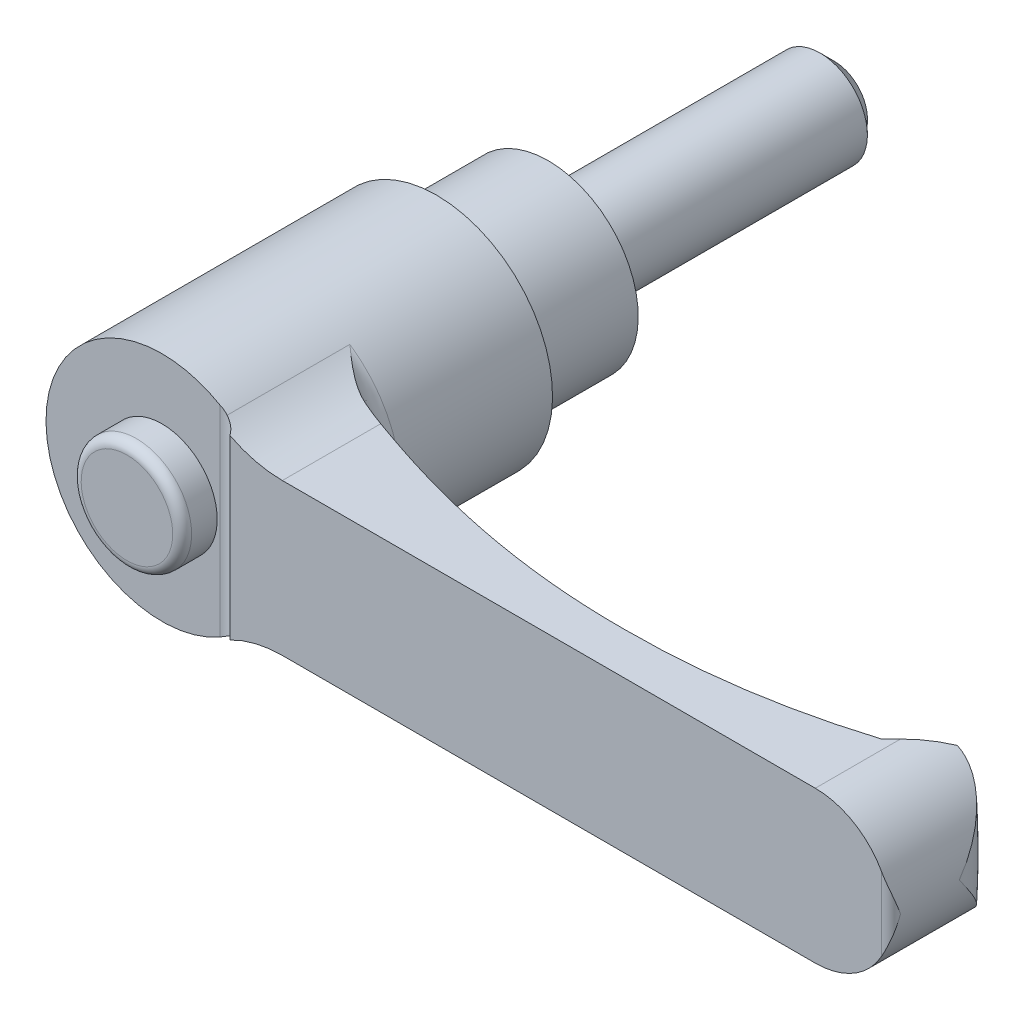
ISO-10303-21;
HEADER;
FILE_DESCRIPTION(('STEP AP214'),'2;1');
FILE_NAME('part.step','',(''),(''),'','','');
FILE_SCHEMA(('AUTOMOTIVE_DESIGN { 1 0 10303 214 1 1 1 1 }'));
ENDSEC;
DATA;
#1=APPLICATION_CONTEXT('core data for automotive mechanical design processes');
#2=APPLICATION_PROTOCOL_DEFINITION('international standard','automotive_design',2000,#1);
#3=PRODUCT_CONTEXT('',#1,'mechanical');
#4=PRODUCT('Part','Part','',(#3));
#5=PRODUCT_RELATED_PRODUCT_CATEGORY('part','',(#4));
#6=PRODUCT_DEFINITION_FORMATION('','',#4);
#7=PRODUCT_DEFINITION_CONTEXT('part definition',#1,'design');
#8=PRODUCT_DEFINITION('design','',#6,#7);
#9=PRODUCT_DEFINITION_SHAPE('','',#8);
#10=(LENGTH_UNIT() NAMED_UNIT(*) SI_UNIT(.MILLI.,.METRE.));
#11=(NAMED_UNIT(*) PLANE_ANGLE_UNIT() SI_UNIT($,.RADIAN.));
#12=(NAMED_UNIT(*) SI_UNIT($,.STERADIAN.) SOLID_ANGLE_UNIT());
#13=UNCERTAINTY_MEASURE_WITH_UNIT(LENGTH_MEASURE(1.E-05),#10,'distance_accuracy_value','');
#14=(GEOMETRIC_REPRESENTATION_CONTEXT(3) GLOBAL_UNCERTAINTY_ASSIGNED_CONTEXT((#13)) GLOBAL_UNIT_ASSIGNED_CONTEXT((#10,
#11,#12)) REPRESENTATION_CONTEXT('',''));
#15=CARTESIAN_POINT('',(0.,0.,0.));
#16=DIRECTION('',(0.,0.,1.));
#17=DIRECTION('',(1.,0.,0.));
#18=AXIS2_PLACEMENT_3D('',#15,#16,#17);
#19=CARTESIAN_POINT('',(7.6,0.,0.));
#20=DIRECTION('',(0.,0.,1.));
#21=DIRECTION('',(0.,-1.,0.));
#22=AXIS2_PLACEMENT_3D('',#19,#20,#21);
#23=PLANE('',#22);
#24=CARTESIAN_POINT('',(0.,0.,0.));
#25=DIRECTION('',(0.,0.,-1.));
#26=DIRECTION('',(0.,1.,0.));
#27=AXIS2_PLACEMENT_3D('',#24,#25,#26);
#28=CIRCLE('',#27,5.);
#29=CARTESIAN_POINT('',(0.,5.,0.));
#30=VERTEX_POINT('',#29);
#31=EDGE_CURVE('E422',#30,#30,#28,.T.);
#32=ORIENTED_EDGE('',*,*,#31,.F.);
#33=EDGE_LOOP('',(#32));
#34=FACE_BOUND('',#33,.T.);
#35=CARTESIAN_POINT('',(0.,0.,0.));
#36=DIRECTION('',(0.,0.,-1.));
#37=DIRECTION('',(0.,1.,0.));
#38=AXIS2_PLACEMENT_3D('',#35,#36,#37);
#39=CIRCLE('',#38,7.6);
#40=CARTESIAN_POINT('',(0.,7.6,0.));
#41=VERTEX_POINT('',#40);
#42=EDGE_CURVE('E347',#41,#41,#39,.T.);
#43=ORIENTED_EDGE('',*,*,#42,.T.);
#44=EDGE_LOOP('',(#43));
#45=FACE_BOUND('',#44,.T.);
#46=ADVANCED_FACE('F14',(#34,#45),#23,.F.);
#47=CARTESIAN_POINT('',(0.,0.,41.));
#48=DIRECTION('',(0.,0.,-1.));
#49=DIRECTION('',(0.,1.,0.));
#50=AXIS2_PLACEMENT_3D('',#47,#48,#49);
#51=PLANE('',#50);
#52=DIRECTION('',(0.,1.,0.));
#53=VECTOR('',#52,1.);
#54=CARTESIAN_POINT('',(6.125,-16.,41.));
#55=LINE('',#54,#53);
#56=CARTESIAN_POINT('',(6.125,-10.6088111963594,41.));
#57=VERTEX_POINT('',#56);
#58=CARTESIAN_POINT('',(6.125,10.6088111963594,41.));
#59=VERTEX_POINT('',#58);
#60=EDGE_CURVE('E385',#57,#59,#55,.T.);
#61=ORIENTED_EDGE('',*,*,#60,.T.);
#62=CARTESIAN_POINT('',(0.,0.,41.));
#63=DIRECTION('',(0.,0.,-1.));
#64=DIRECTION('',(0.,1.,0.));
#65=AXIS2_PLACEMENT_3D('',#62,#63,#64);
#66=CIRCLE('',#65,12.25);
#67=EDGE_CURVE('E332',#57,#59,#66,.T.);
#68=ORIENTED_EDGE('',*,*,#67,.F.);
#69=EDGE_LOOP('',(#61,#68));
#70=FACE_BOUND('',#69,.T.);
#71=CARTESIAN_POINT('',(0.,0.,41.));
#72=DIRECTION('',(0.,0.,-1.));
#73=DIRECTION('',(0.,1.,0.));
#74=AXIS2_PLACEMENT_3D('',#71,#72,#73);
#75=CIRCLE('',#74,5.83333333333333);
#76=CARTESIAN_POINT('',(0.,5.83333333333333,41.));
#77=VERTEX_POINT('',#76);
#78=EDGE_CURVE('E193',#77,#77,#75,.F.);
#79=ORIENTED_EDGE('',*,*,#78,.F.);
#80=EDGE_LOOP('',(#79));
#81=FACE_BOUND('',#80,.T.);
#82=ADVANCED_FACE('F163',(#70,#81),#51,.F.);
#83=CARTESIAN_POINT('',(70.,0.,0.));
#84=DIRECTION('',(0.,0.,1.));
#85=DIRECTION('',(0.,-1.,0.));
#86=AXIS2_PLACEMENT_3D('',#83,#84,#85);
#87=CYLINDRICAL_SURFACE('',#86,8.);
#88=CARTESIAN_POINT('',(78.,0.,34.8));
#89=CARTESIAN_POINT('',(78.0000000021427,-0.00507455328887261,34.7962762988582));
#90=CARTESIAN_POINT('',(77.9999951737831,-0.0101492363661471,34.7925524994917));
#91=CARTESIAN_POINT('',(77.9989416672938,-0.563628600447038,34.3864095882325));
#92=CARTESIAN_POINT('',(77.9414802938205,-1.11346566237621,33.9829298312));
#93=CARTESIAN_POINT('',(77.7692220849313,-1.92787753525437,33.38939297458));
#94=CARTESIAN_POINT('',(77.697249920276,-2.19810314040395,33.1931504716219));
#95=CARTESIAN_POINT('',(77.5237934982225,-2.73341157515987,32.8066637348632));
#96=CARTESIAN_POINT('',(77.4223242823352,-2.99849695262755,32.6164164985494));
#97=CARTESIAN_POINT('',(77.2199237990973,-3.45210642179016,32.2938177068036));
#98=CARTESIAN_POINT('',(77.1259458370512,-3.64233939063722,32.1594598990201));
#99=CARTESIAN_POINT('',(76.9211711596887,-4.01785016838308,31.8966888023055));
#100=CARTESIAN_POINT('',(76.8103745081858,-4.20312799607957,31.7682754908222));
#101=CARTESIAN_POINT('',(76.5717542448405,-4.56719869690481,31.5191542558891));
#102=CARTESIAN_POINT('',(76.4439640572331,-4.74600344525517,31.3984318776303));
#103=CARTESIAN_POINT('',(76.1708976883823,-5.09601175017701,31.1663364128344));
#104=CARTESIAN_POINT('',(76.0256268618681,-5.26721761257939,31.0549604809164));
#105=CARTESIAN_POINT('',(75.6441829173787,-5.67932922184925,30.7937387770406));
#106=CARTESIAN_POINT('',(75.3974573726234,-5.9150123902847,30.6505327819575));
#107=CARTESIAN_POINT('',(74.9987611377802,-6.24839682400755,30.4615945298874));
#108=CARTESIAN_POINT('',(74.8611020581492,-6.35616332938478,30.4029292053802));
#109=CARTESIAN_POINT('',(74.5764070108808,-6.56410843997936,30.2956150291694));
#110=CARTESIAN_POINT('',(74.429373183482,-6.66428876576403,30.2469639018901));
#111=CARTESIAN_POINT('',(74.1592544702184,-6.83522850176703,30.1705684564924));
#112=CARTESIAN_POINT('',(74.0378615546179,-6.90766708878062,30.1405781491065));
#113=CARTESIAN_POINT('',(73.7901015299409,-7.04665102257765,30.0886005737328));
#114=CARTESIAN_POINT('',(73.6637356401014,-7.11319780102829,30.0666113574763));
#115=CARTESIAN_POINT('',(73.4066843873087,-7.23982141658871,30.0315221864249));
#116=CARTESIAN_POINT('',(73.2760017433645,-7.2999022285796,30.0184167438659));
#117=CARTESIAN_POINT('',(73.0110423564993,-7.41312181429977,30.0019547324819));
#118=CARTESIAN_POINT('',(72.8767656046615,-7.46626057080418,29.9985981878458));
#119=CARTESIAN_POINT('',(72.6044130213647,-7.56559501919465,30.0024862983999));
#120=CARTESIAN_POINT('',(72.4663137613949,-7.6117232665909,30.009827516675));
#121=CARTESIAN_POINT('',(72.1887878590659,-7.69611880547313,30.0360283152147));
#122=CARTESIAN_POINT('',(72.0493611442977,-7.73438566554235,30.0548885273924));
#123=CARTESIAN_POINT('',(71.770740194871,-7.80288648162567,30.1046814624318));
#124=CARTESIAN_POINT('',(71.6315458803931,-7.83312431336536,30.1356083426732));
#125=CARTESIAN_POINT('',(71.3550409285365,-7.885663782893,30.2098119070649));
#126=CARTESIAN_POINT('',(71.217729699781,-7.90796796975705,30.2530846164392));
#127=CARTESIAN_POINT('',(70.8920238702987,-7.95241951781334,30.3719934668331));
#128=CARTESIAN_POINT('',(70.7052564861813,-7.97090772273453,30.4536477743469));
#129=CARTESIAN_POINT('',(70.433708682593,-7.98875485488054,30.5937624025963));
#130=CARTESIAN_POINT('',(70.3445710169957,-7.99305594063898,30.6434445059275));
#131=CARTESIAN_POINT('',(70.1696001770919,-7.99868029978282,30.7485120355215));
#132=CARTESIAN_POINT('',(70.0837676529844,-8.00000299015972,30.8038985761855));
#133=CARTESIAN_POINT('',(69.9998,-7.9999999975,30.8620428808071));
#134=B_SPLINE_CURVE_WITH_KNOTS('',3,(#88,#89,#90,#91,#92,#93,#94,#95,#96,#97,#98,#99,#100,#101,
#102,#103,#104,#105,#106,#107,#108,#109,#110,#111,#112,#113,#114,#115,#116,#117,#118,#119,#120,
#121,#122,#123,#124,#125,#126,#127,#128,#129,#130,#131,#132,#133),.UNSPECIFIED.,.F.,.F.,(4,2,2,
2,2,2,2,2,2,2,2,2,2,2,2,2,2,2,2,2,2,2,4),(0.,0.0188831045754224,2.05946970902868,
3.08347088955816,4.10695081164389,4.85978230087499,5.6126109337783,6.36398015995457,
7.11511980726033,8.22062566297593,8.77332293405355,9.32589447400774,9.75904172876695,
10.1920834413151,10.624857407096,11.0576324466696,11.4943381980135,11.9310679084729,
12.3675864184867,12.8039645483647,13.4155655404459,13.721767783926,14.0280299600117),.UNSPECIFIED.);
#135=CARTESIAN_POINT('',(72.9968893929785,-7.41745603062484,30.0031106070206));
#136=VERTEX_POINT('',#135);
#137=CARTESIAN_POINT('',(78.,0.,34.8));
#138=VERTEX_POINT('',#137);
#139=EDGE_CURVE('E126',#136,#138,#134,.F.);
#140=ORIENTED_EDGE('',*,*,#139,.T.);
#141=CARTESIAN_POINT('',(78.,0.,34.8));
#142=CARTESIAN_POINT('',(78.0000000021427,0.00507455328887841,34.7962762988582));
#143=CARTESIAN_POINT('',(77.9999951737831,0.0101492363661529,34.7925524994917));
#144=CARTESIAN_POINT('',(77.9989416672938,0.563628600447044,34.3864095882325));
#145=CARTESIAN_POINT('',(77.9414802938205,1.11346566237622,33.9829298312));
#146=CARTESIAN_POINT('',(77.7692220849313,1.92787753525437,33.38939297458));
#147=CARTESIAN_POINT('',(77.697249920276,2.19810314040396,33.1931504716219));
#148=CARTESIAN_POINT('',(77.5237934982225,2.73341157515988,32.8066637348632));
#149=CARTESIAN_POINT('',(77.4223242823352,2.99849695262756,32.6164164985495));
#150=CARTESIAN_POINT('',(77.2199237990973,3.45210642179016,32.2938177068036));
#151=CARTESIAN_POINT('',(77.1259458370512,3.64233939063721,32.1594598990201));
#152=CARTESIAN_POINT('',(76.9211711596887,4.01785016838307,31.8966888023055));
#153=CARTESIAN_POINT('',(76.8103745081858,4.20312799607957,31.7682754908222));
#154=CARTESIAN_POINT('',(76.5717542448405,4.56719869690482,31.5191542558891));
#155=CARTESIAN_POINT('',(76.4439640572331,4.74600344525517,31.3984318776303));
#156=CARTESIAN_POINT('',(76.1708976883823,5.09601175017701,31.1663364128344));
#157=CARTESIAN_POINT('',(76.0256268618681,5.26721761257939,31.0549604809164));
#158=CARTESIAN_POINT('',(75.6441829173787,5.67932922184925,30.7937387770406));
#159=CARTESIAN_POINT('',(75.3974573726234,5.91501239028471,30.6505327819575));
#160=CARTESIAN_POINT('',(74.9987611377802,6.24839682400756,30.4615945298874));
#161=CARTESIAN_POINT('',(74.8611020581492,6.35616332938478,30.4029292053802));
#162=CARTESIAN_POINT('',(74.5764070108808,6.56410843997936,30.2956150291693));
#163=CARTESIAN_POINT('',(74.429373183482,6.66428876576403,30.2469639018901));
#164=CARTESIAN_POINT('',(74.1592544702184,6.83522850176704,30.1705684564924));
#165=CARTESIAN_POINT('',(74.0378615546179,6.90766708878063,30.1405781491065));
#166=CARTESIAN_POINT('',(73.7901015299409,7.04665102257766,30.0886005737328));
#167=CARTESIAN_POINT('',(73.6637356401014,7.11319780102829,30.0666113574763));
#168=CARTESIAN_POINT('',(73.4066843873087,7.23982141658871,30.0315221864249));
#169=CARTESIAN_POINT('',(73.2760017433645,7.2999022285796,30.0184167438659));
#170=CARTESIAN_POINT('',(73.0110423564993,7.41312181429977,30.0019547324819));
#171=CARTESIAN_POINT('',(72.8767656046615,7.46626057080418,29.9985981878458));
#172=CARTESIAN_POINT('',(72.6044130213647,7.56559501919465,30.0024862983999));
#173=CARTESIAN_POINT('',(72.4663137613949,7.61172326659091,30.009827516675));
#174=CARTESIAN_POINT('',(72.1887878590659,7.69611880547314,30.0360283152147));
#175=CARTESIAN_POINT('',(72.0493611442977,7.73438566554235,30.0548885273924));
#176=CARTESIAN_POINT('',(71.770740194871,7.80288648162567,30.1046814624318));
#177=CARTESIAN_POINT('',(71.6315458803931,7.83312431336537,30.1356083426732));
#178=CARTESIAN_POINT('',(71.3550409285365,7.885663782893,30.2098119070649));
#179=CARTESIAN_POINT('',(71.217729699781,7.90796796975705,30.2530846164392));
#180=CARTESIAN_POINT('',(70.8920238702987,7.95241951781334,30.3719934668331));
#181=CARTESIAN_POINT('',(70.7052564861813,7.97090772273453,30.4536477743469));
#182=CARTESIAN_POINT('',(70.433708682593,7.98875485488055,30.5937624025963));
#183=CARTESIAN_POINT('',(70.3445710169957,7.99305594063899,30.6434445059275));
#184=CARTESIAN_POINT('',(70.1696001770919,7.99868029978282,30.7485120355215));
#185=CARTESIAN_POINT('',(70.0837676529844,8.00000299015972,30.8038985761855));
#186=CARTESIAN_POINT('',(69.9998,7.9999999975,30.8620428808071));
#187=B_SPLINE_CURVE_WITH_KNOTS('',3,(#141,#142,#143,#144,#145,#146,#147,#148,#149,#150,#151,
#152,#153,#154,#155,#156,#157,#158,#159,#160,#161,#162,#163,#164,#165,#166,#167,#168,#169,#170,
#171,#172,#173,#174,#175,#176,#177,#178,#179,#180,#181,#182,#183,#184,#185,#186),.UNSPECIFIED.,
.F.,.F.,(4,2,2,2,2,2,2,2,2,2,2,2,2,2,2,2,2,2,2,2,2,2,4),(0.,0.0188831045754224,2.05946970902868,
3.08347088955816,4.10695081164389,4.85978230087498,5.61261093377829,6.36398015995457,
7.11511980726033,8.22062566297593,8.77332293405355,9.32589447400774,9.75904172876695,
10.1920834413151,10.6248574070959,11.0576324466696,11.4943381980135,11.9310679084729,
12.3675864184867,12.8039645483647,13.4155655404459,13.721767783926,14.0280299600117),.UNSPECIFIED.);
#188=CARTESIAN_POINT('',(72.9968893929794,7.41745603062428,30.0031106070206));
#189=VERTEX_POINT('',#188);
#190=EDGE_CURVE('E123',#138,#189,#187,.T.);
#191=ORIENTED_EDGE('',*,*,#190,.T.);
#192=CARTESIAN_POINT('',(70.,0.,33.));
#193=DIRECTION('',(-0.707106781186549,0.,-0.707106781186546));
#194=DIRECTION('',(-0.707106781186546,0.,0.707106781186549));
#195=AXIS2_PLACEMENT_3D('',#192,#193,#194);
#196=ELLIPSE('',#195,11.3137084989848,8.);
#197=CARTESIAN_POINT('',(70.,8.,33.));
#198=VERTEX_POINT('',#197);
#199=EDGE_CURVE('E378',#189,#198,#196,.F.);
#200=ORIENTED_EDGE('',*,*,#199,.T.);
#201=DIRECTION('',(0.,0.,1.));
#202=VECTOR('',#201,1.);
#203=CARTESIAN_POINT('',(70.,8.,0.));
#204=LINE('',#203,#202);
#205=CARTESIAN_POINT('',(70.,8.,42.));
#206=VERTEX_POINT('',#205);
#207=EDGE_CURVE('E354',#198,#206,#204,.T.);
#208=ORIENTED_EDGE('',*,*,#207,.T.);
#209=CARTESIAN_POINT('',(70.,0.,42.));
#210=DIRECTION('',(0.,0.,1.));
#211=DIRECTION('',(0.,-1.,0.));
#212=AXIS2_PLACEMENT_3D('',#209,#210,#211);
#213=CIRCLE('',#212,8.);
#214=CARTESIAN_POINT('',(77.,3.87298334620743,42.));
#215=VERTEX_POINT('',#214);
#216=EDGE_CURVE('E327',#215,#206,#213,.T.);
#217=ORIENTED_EDGE('',*,*,#216,.F.);
#218=CARTESIAN_POINT('',(77.,3.87298334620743,42.));
#219=CARTESIAN_POINT('',(77.0320487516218,3.8150611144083,41.9999909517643));
#220=CARTESIAN_POINT('',(77.0633658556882,3.75675902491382,41.9984605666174));
#221=CARTESIAN_POINT('',(77.1244803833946,3.63952511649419,41.99269833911));
#222=CARTESIAN_POINT('',(77.1542784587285,3.58059358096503,41.9884676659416));
#223=CARTESIAN_POINT('',(77.241218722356,3.40324230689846,41.9722589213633));
#224=CARTESIAN_POINT('',(77.2960525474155,3.28400247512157,41.9567609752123));
#225=CARTESIAN_POINT('',(77.3991566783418,3.04456972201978,41.9185214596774));
#226=CARTESIAN_POINT('',(77.4474555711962,2.9243835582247,41.8958129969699));
#227=CARTESIAN_POINT('',(77.5378429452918,2.68282861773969,41.8446429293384));
#228=CARTESIAN_POINT('',(77.5799268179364,2.56145903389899,41.8161770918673));
#229=CARTESIAN_POINT('',(77.6827368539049,2.24038507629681,41.7351721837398));
#230=CARTESIAN_POINT('',(77.7382927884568,2.03996193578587,41.6788382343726));
#231=CARTESIAN_POINT('',(77.8332865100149,1.63779800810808,41.55814944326));
#232=CARTESIAN_POINT('',(77.8727175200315,1.43605670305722,41.4937912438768));
#233=CARTESIAN_POINT('',(77.967421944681,0.829293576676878,41.2932012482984));
#234=CARTESIAN_POINT('',(77.999127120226,0.42266785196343,41.1494356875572));
#235=CARTESIAN_POINT('',(77.9999940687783,0.0112434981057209,41.0039751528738));
#236=CARTESIAN_POINT('',(77.9999999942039,0.00562166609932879,41.0019875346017));
#237=CARTESIAN_POINT('',(78.,0.,41.));
#238=B_SPLINE_CURVE_WITH_KNOTS('',3,(#218,#219,#220,#221,#222,#223,#224,#225,#226,#227,#228,
#229,#230,#231,#232,#233,#234,#235,#236,#237),.UNSPECIFIED.,.F.,.F.,(4,2,2,2,2,2,2,2,2,4),(0.,
0.198535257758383,0.396984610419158,0.792983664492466,1.18719018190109,1.5816875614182,
2.22713013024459,2.8728436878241,4.16406208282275,4.18195063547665),.UNSPECIFIED.);
#239=CARTESIAN_POINT('',(78.,0.,41.));
#240=VERTEX_POINT('',#239);
#241=EDGE_CURVE('E179',#240,#215,#238,.F.);
#242=ORIENTED_EDGE('',*,*,#241,.F.);
#243=CARTESIAN_POINT('',(77.,-3.87298334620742,42.));
#244=CARTESIAN_POINT('',(77.0320487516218,-3.81506111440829,41.9999909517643));
#245=CARTESIAN_POINT('',(77.0633658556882,-3.75675902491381,41.9984605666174));
#246=CARTESIAN_POINT('',(77.1244803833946,-3.63952511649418,41.99269833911));
#247=CARTESIAN_POINT('',(77.1542784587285,-3.58059358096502,41.9884676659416));
#248=CARTESIAN_POINT('',(77.241218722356,-3.40324230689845,41.9722589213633));
#249=CARTESIAN_POINT('',(77.2960525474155,-3.28400247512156,41.9567609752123));
#250=CARTESIAN_POINT('',(77.3991566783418,-3.04456972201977,41.9185214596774));
#251=CARTESIAN_POINT('',(77.4474555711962,-2.92438355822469,41.8958129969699));
#252=CARTESIAN_POINT('',(77.5378429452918,-2.68282861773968,41.8446429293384));
#253=CARTESIAN_POINT('',(77.5799268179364,-2.56145903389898,41.8161770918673));
#254=CARTESIAN_POINT('',(77.6827368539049,-2.2403850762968,41.7351721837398));
#255=CARTESIAN_POINT('',(77.7382927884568,-2.03996193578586,41.6788382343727));
#256=CARTESIAN_POINT('',(77.8332865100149,-1.63779800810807,41.55814944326));
#257=CARTESIAN_POINT('',(77.8727175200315,-1.43605670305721,41.4937912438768));
#258=CARTESIAN_POINT('',(77.967421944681,-0.829293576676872,41.2932012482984));
#259=CARTESIAN_POINT('',(77.999127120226,-0.422667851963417,41.1494356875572));
#260=CARTESIAN_POINT('',(77.9999940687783,-0.0112434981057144,41.0039751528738));
#261=CARTESIAN_POINT('',(77.9999999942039,-0.00562166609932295,41.0019875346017));
#262=CARTESIAN_POINT('',(78.,0.,41.));
#263=B_SPLINE_CURVE_WITH_KNOTS('',3,(#243,#244,#245,#246,#247,#248,#249,#250,#251,#252,#253,
#254,#255,#256,#257,#258,#259,#260,#261,#262),.UNSPECIFIED.,.F.,.F.,(4,2,2,2,2,2,2,2,2,4),(0.,
0.19853525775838,0.396984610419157,0.792983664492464,1.18719018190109,1.5816875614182,
2.2271301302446,2.8728436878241,4.16406208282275,4.18195063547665),.UNSPECIFIED.);
#264=CARTESIAN_POINT('',(77.,-3.87298334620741,42.));
#265=VERTEX_POINT('',#264);
#266=EDGE_CURVE('E187',#265,#240,#263,.T.);
#267=ORIENTED_EDGE('',*,*,#266,.F.);
#268=CARTESIAN_POINT('',(70.,-8.,42.));
#269=VERTEX_POINT('',#268);
#270=EDGE_CURVE('E322',#269,#265,#213,.T.);
#271=ORIENTED_EDGE('',*,*,#270,.F.);
#272=DIRECTION('',(0.,0.,1.));
#273=VECTOR('',#272,1.);
#274=CARTESIAN_POINT('',(70.,-8.,0.));
#275=LINE('',#274,#273);
#276=CARTESIAN_POINT('',(70.,-8.,33.));
#277=VERTEX_POINT('',#276);
#278=EDGE_CURVE('E357',#277,#269,#275,.T.);
#279=ORIENTED_EDGE('',*,*,#278,.F.);
#280=EDGE_CURVE('E137',#277,#136,#196,.F.);
#281=ORIENTED_EDGE('',*,*,#280,.T.);
#282=EDGE_LOOP('',(#140,#191,#200,#208,#217,#242,#267,#271,#279,#281));
#283=FACE_BOUND('',#282,.T.);
#284=ADVANCED_FACE('F135',(#283),#87,.T.);
#285=CARTESIAN_POINT('',(73.,-16.,30.));
#286=DIRECTION('',(-0.707106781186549,0.,-0.707106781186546));
#287=DIRECTION('',(0.707106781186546,0.,-0.707106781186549));
#288=AXIS2_PLACEMENT_3D('',#285,#286,#287);
#289=PLANE('',#288);
#290=DIRECTION('',(0.,1.,0.));
#291=VECTOR('',#290,1.);
#292=CARTESIAN_POINT('',(73.,-16.,30.));
#293=LINE('',#292,#291);
#294=CARTESIAN_POINT('',(73.,-5.40740233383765,30.));
#295=VERTEX_POINT('',#294);
#296=CARTESIAN_POINT('',(73.,5.40740233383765,30.));
#297=VERTEX_POINT('',#296);
#298=EDGE_CURVE('E397',#295,#297,#293,.T.);
#299=ORIENTED_EDGE('',*,*,#298,.F.);
#300=CARTESIAN_POINT('',(72.9944134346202,8.0002,30.0055865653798));
#301=CARTESIAN_POINT('',(72.9964174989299,7.60019527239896,30.0035825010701));
#302=CARTESIAN_POINT('',(72.9977626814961,7.20018596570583,30.0022373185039));
#303=CARTESIAN_POINT('',(72.9994970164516,6.40016550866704,30.0005029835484));
#304=CARTESIAN_POINT('',(72.9998861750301,6.00015435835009,30.0001138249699));
#305=CARTESIAN_POINT('',(73.0000702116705,5.20013335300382,29.9999297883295));
#306=CARTESIAN_POINT('',(72.9998650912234,4.80012349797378,30.0001349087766));
#307=CARTESIAN_POINT('',(72.9991717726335,4.00010369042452,30.0008282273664));
#308=CARTESIAN_POINT('',(72.998683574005,3.60009373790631,30.001316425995));
#309=CARTESIAN_POINT('',(72.9972116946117,2.40006658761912,30.0027883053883));
#310=CARTESIAN_POINT('',(72.9962207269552,1.60004928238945,30.0037792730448));
#311=CARTESIAN_POINT('',(72.9954610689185,1.3601944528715E-05,30.0045389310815));
#312=CARTESIAN_POINT('',(72.9956923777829,-0.800004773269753,30.004307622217));
#313=CARTESIAN_POINT('',(72.9968584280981,-2.13336982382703,30.0031415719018));
#314=CARTESIAN_POINT('',(72.9975329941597,-2.66671710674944,30.0024670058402));
#315=CARTESIAN_POINT('',(72.9988528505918,-3.73341119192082,30.0011471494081));
#316=CARTESIAN_POINT('',(72.999498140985,-4.26675799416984,30.000501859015));
#317=CARTESIAN_POINT('',(73.000124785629,-5.33345534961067,29.999875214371));
#318=CARTESIAN_POINT('',(73.0001061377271,-5.86680590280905,29.9998938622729));
#319=CARTESIAN_POINT('',(72.9985813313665,-6.93350631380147,30.0014186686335));
#320=CARTESIAN_POINT('',(72.997075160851,-7.46685617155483,30.002924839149));
#321=CARTESIAN_POINT('',(72.9944134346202,-8.0002,30.0055865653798));
#322=B_SPLINE_CURVE_WITH_KNOTS('',3,(#300,#301,#302,#303,#304,#305,#306,#307,#308,#309,#310,
#311,#312,#313,#314,#315,#316,#317,#318,#319,#320,#321),.UNSPECIFIED.,.F.,.F.,(4,2,2,2,2,2,2,2,
2,2,4),(0.,1.20004037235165,2.40007297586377,3.60010256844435,4.80013422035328,7.20018907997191,
9.60024245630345,11.2002867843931,12.8003298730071,14.4003781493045,16.0004393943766),.UNSPECIFIED.);
#323=EDGE_CURVE('E138',#295,#136,#322,.T.);
#324=ORIENTED_EDGE('',*,*,#323,.T.);
#325=ORIENTED_EDGE('',*,*,#280,.F.);
#326=DIRECTION('',(-0.707106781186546,0.,0.707106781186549));
#327=VECTOR('',#326,1.);
#328=CARTESIAN_POINT('',(86.5,-8.,16.5));
#329=LINE('',#328,#327);
#330=CARTESIAN_POINT('',(69.,-8.,34.));
#331=VERTEX_POINT('',#330);
#332=EDGE_CURVE('E321',#277,#331,#329,.T.);
#333=ORIENTED_EDGE('',*,*,#332,.T.);
#334=DIRECTION('',(0.,1.,0.));
#335=VECTOR('',#334,1.);
#336=CARTESIAN_POINT('',(69.,-16.,34.));
#337=LINE('',#336,#335);
#338=CARTESIAN_POINT('',(69.,8.,34.));
#339=VERTEX_POINT('',#338);
#340=EDGE_CURVE('E319',#331,#339,#337,.T.);
#341=ORIENTED_EDGE('',*,*,#340,.T.);
#342=DIRECTION('',(0.707106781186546,0.,-0.707106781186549));
#343=VECTOR('',#342,1.);
#344=CARTESIAN_POINT('',(58.3567940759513,8.,44.6432059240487));
#345=LINE('',#344,#343);
#346=EDGE_CURVE('E375',#339,#198,#345,.T.);
#347=ORIENTED_EDGE('',*,*,#346,.T.);
#348=ORIENTED_EDGE('',*,*,#199,.F.);
#349=EDGE_CURVE('E129',#189,#297,#322,.T.);
#350=ORIENTED_EDGE('',*,*,#349,.T.);
#351=EDGE_LOOP('',(#299,#324,#325,#333,#341,#347,#348,#350));
#352=FACE_BOUND('',#351,.T.);
#353=ADVANCED_FACE('F162',(#352),#289,.T.);
#354=CARTESIAN_POINT('',(73.2,-16.,30.));
#355=DIRECTION('',(0.,0.,-1.));
#356=DIRECTION('',(0.,1.,0.));
#357=AXIS2_PLACEMENT_3D('',#354,#355,#356);
#358=PLANE('',#357);
#359=ORIENTED_EDGE('',*,*,#298,.T.);
#360=CARTESIAN_POINT('',(0.,0.,30.));
#361=DIRECTION('',(0.,0.,-1.));
#362=DIRECTION('',(0.,1.,0.));
#363=AXIS2_PLACEMENT_3D('',#360,#361,#362);
#364=CIRCLE('',#363,73.2);
#365=EDGE_CURVE('E36',#297,#295,#364,.T.);
#366=ORIENTED_EDGE('',*,*,#365,.T.);
#367=EDGE_LOOP('',(#359,#366));
#368=FACE_BOUND('',#367,.T.);
#369=ADVANCED_FACE('F201',(#368),#358,.T.);
#370=CARTESIAN_POINT('',(0.,0.,42.));
#371=DIRECTION('',(0.,0.,1.));
#372=DIRECTION('',(0.,-1.,0.));
#373=AXIS2_PLACEMENT_3D('',#370,#371,#372);
#374=PLANE('',#373);
#375=CARTESIAN_POINT('',(13.7135881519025,20.,42.));
#376=DIRECTION('',(0.,0.,1.));
#377=DIRECTION('',(1.,0.,0.));
#378=AXIS2_PLACEMENT_3D('',#375,#376,#377);
#379=CIRCLE('',#378,12.);
#380=CARTESIAN_POINT('',(8.16666666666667,9.35896330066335,42.));
#381=VERTEX_POINT('',#380);
#382=CARTESIAN_POINT('',(13.7135881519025,8.,42.));
#383=VERTEX_POINT('',#382);
#384=EDGE_CURVE('E372',#381,#383,#379,.T.);
#385=ORIENTED_EDGE('',*,*,#384,.F.);
#386=DIRECTION('',(0.,1.,0.));
#387=VECTOR('',#386,1.);
#388=CARTESIAN_POINT('',(8.16666666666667,-16.,42.));
#389=LINE('',#388,#387);
#390=CARTESIAN_POINT('',(8.16666666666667,-9.35896330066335,42.));
#391=VERTEX_POINT('',#390);
#392=EDGE_CURVE('E392',#391,#381,#389,.T.);
#393=ORIENTED_EDGE('',*,*,#392,.F.);
#394=CARTESIAN_POINT('',(13.7135881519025,-20.,42.));
#395=DIRECTION('',(0.,0.,1.));
#396=DIRECTION('',(1.,0.,0.));
#397=AXIS2_PLACEMENT_3D('',#394,#395,#396);
#398=CIRCLE('',#397,12.);
#399=CARTESIAN_POINT('',(13.7135881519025,-8.,42.));
#400=VERTEX_POINT('',#399);
#401=EDGE_CURVE('E363',#400,#391,#398,.T.);
#402=ORIENTED_EDGE('',*,*,#401,.F.);
#403=DIRECTION('',(-1.,0.,0.));
#404=VECTOR('',#403,1.);
#405=CARTESIAN_POINT('',(70.,-8.,42.));
#406=LINE('',#405,#404);
#407=EDGE_CURVE('E366',#269,#400,#406,.T.);
#408=ORIENTED_EDGE('',*,*,#407,.F.);
#409=ORIENTED_EDGE('',*,*,#270,.T.);
#410=DIRECTION('',(0.,1.,0.));
#411=VECTOR('',#410,1.);
#412=CARTESIAN_POINT('',(77.,-16.,42.));
#413=LINE('',#412,#411);
#414=EDGE_CURVE('E393',#265,#215,#413,.T.);
#415=ORIENTED_EDGE('',*,*,#414,.T.);
#416=ORIENTED_EDGE('',*,*,#216,.T.);
#417=DIRECTION('',(1.,0.,0.));
#418=VECTOR('',#417,1.);
#419=CARTESIAN_POINT('',(13.7135881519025,8.,42.));
#420=LINE('',#419,#418);
#421=EDGE_CURVE('E369',#383,#206,#420,.T.);
#422=ORIENTED_EDGE('',*,*,#421,.F.);
#423=EDGE_LOOP('',(#385,#393,#402,#408,#409,#415,#416,#422));
#424=FACE_BOUND('',#423,.T.);
#425=ADVANCED_FACE('F248',(#424),#374,.T.);
#426=CARTESIAN_POINT('',(0.,0.,0.));
#427=DIRECTION('',(0.,0.,-1.));
#428=DIRECTION('',(0.,1.,0.));
#429=AXIS2_PLACEMENT_3D('',#426,#427,#428);
#430=CYLINDRICAL_SURFACE('',#429,12.25);
#431=CARTESIAN_POINT('',(0.,0.,28.0779919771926));
#432=DIRECTION('',(0.,0.,-1.));
#433=DIRECTION('',(0.,1.,0.));
#434=AXIS2_PLACEMENT_3D('',#431,#432,#433);
#435=CIRCLE('',#434,12.25);
#436=CARTESIAN_POINT('',(6.92748267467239,10.1030927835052,28.0779919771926));
#437=VERTEX_POINT('',#436);
#438=CARTESIAN_POINT('',(6.92748267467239,-10.1030927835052,28.0779919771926));
#439=VERTEX_POINT('',#438);
#440=EDGE_CURVE('E412',#437,#439,#435,.T.);
#441=ORIENTED_EDGE('',*,*,#440,.T.);
#442=DIRECTION('',(0.,0.,1.));
#443=VECTOR('',#442,1.);
#444=CARTESIAN_POINT('',(6.92748267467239,-10.1030927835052,0.));
#445=LINE('',#444,#443);
#446=CARTESIAN_POINT('',(6.92748267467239,-10.1030927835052,41.0427567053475));
#447=VERTEX_POINT('',#446);
#448=EDGE_CURVE('E361',#439,#447,#445,.T.);
#449=ORIENTED_EDGE('',*,*,#448,.T.);
#450=CARTESIAN_POINT('',(6.125,-10.6088111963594,41.));
#451=CARTESIAN_POINT('',(6.19832883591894,-10.5664875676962,40.9889897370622));
#452=CARTESIAN_POINT('',(6.27164451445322,-10.523132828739,40.9821479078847));
#453=CARTESIAN_POINT('',(6.41753908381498,-10.4347921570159,40.9764986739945));
#454=CARTESIAN_POINT('',(6.49011843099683,-10.3898073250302,40.9776859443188));
#455=CARTESIAN_POINT('',(6.63402897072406,-10.2985167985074,40.9877856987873));
#456=CARTESIAN_POINT('',(6.70535828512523,-10.2522093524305,40.996708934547));
#457=CARTESIAN_POINT('',(6.84611057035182,-10.1587605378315,41.0220012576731));
#458=CARTESIAN_POINT('',(6.91553331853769,-10.1116190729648,41.0383712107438));
#459=CARTESIAN_POINT('',(7.10641045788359,-9.97916014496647,41.094233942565));
#460=CARTESIAN_POINT('',(7.22525798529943,-9.89334730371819,41.1417583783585));
#461=CARTESIAN_POINT('',(7.45241295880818,-9.72337963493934,41.2589427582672));
#462=CARTESIAN_POINT('',(7.56074253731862,-9.63922163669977,41.3285548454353));
#463=CARTESIAN_POINT('',(7.71168483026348,-9.51821587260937,41.4479066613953));
#464=CARTESIAN_POINT('',(7.75936397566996,-9.47936365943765,41.4893658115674));
#465=CARTESIAN_POINT('',(7.85125896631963,-9.40339173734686,41.5773725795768));
#466=CARTESIAN_POINT('',(7.89547657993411,-9.36627114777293,41.6239175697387));
#467=CARTESIAN_POINT('',(7.98020904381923,-9.29418452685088,41.7223463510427));
#468=CARTESIAN_POINT('',(8.02070494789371,-9.25922978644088,41.7742548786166));
#469=CARTESIAN_POINT('',(8.09722101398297,-9.19239515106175,41.8832605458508));
#470=CARTESIAN_POINT('',(8.13323329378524,-9.16052069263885,41.9403665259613));
#471=CARTESIAN_POINT('',(8.16666666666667,-9.13061090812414,42.));
#472=B_SPLINE_CURVE_WITH_KNOTS('',3,(#450,#451,#452,#453,#454,#455,#456,#457,#458,#459,#460,
#461,#462,#463,#464,#465,#466,#467,#468,#469,#470,#471),.UNSPECIFIED.,.F.,.F.,(4,2,2,2,2,2,2,2,
2,2,4),(0.,0.255975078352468,0.511780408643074,0.767941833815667,1.02413304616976,
1.48441304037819,1.94370248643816,2.16599787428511,2.38817894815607,2.61143478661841,
2.83507772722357),.UNSPECIFIED.);
#473=EDGE_CURVE('E222',#57,#447,#472,.T.);
#474=ORIENTED_EDGE('',*,*,#473,.F.);
#475=ORIENTED_EDGE('',*,*,#67,.T.);
#476=CARTESIAN_POINT('',(8.16666666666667,9.13061090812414,42.));
#477=CARTESIAN_POINT('',(8.13602850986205,9.15801692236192,41.9453523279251));
#478=CARTESIAN_POINT('',(8.10323346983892,9.18706943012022,41.8928397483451));
#479=CARTESIAN_POINT('',(8.03382107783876,9.24782874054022,41.7921703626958));
#480=CARTESIAN_POINT('',(7.99720910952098,9.27953179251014,41.7440075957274));
#481=CARTESIAN_POINT('',(7.88274220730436,9.37735907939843,41.6065497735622));
#482=CARTESIAN_POINT('',(7.79984772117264,9.44657197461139,41.5235775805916));
#483=CARTESIAN_POINT('',(7.62397737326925,9.58906879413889,41.3751924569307));
#484=CARTESIAN_POINT('',(7.53106018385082,9.66232791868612,41.3096843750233));
#485=CARTESIAN_POINT('',(7.33643153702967,9.81092784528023,41.1955319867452));
#486=CARTESIAN_POINT('',(7.23469620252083,9.88627389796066,41.1469353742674));
#487=CARTESIAN_POINT('',(7.00601089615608,10.0499435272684,41.0604339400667));
#488=CARTESIAN_POINT('',(6.87776073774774,10.1382349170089,41.0258797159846));
#489=CARTESIAN_POINT('',(6.61511692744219,10.3115145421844,40.9827504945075));
#490=CARTESIAN_POINT('',(6.48074133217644,10.3965112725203,40.9741035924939));
#491=CARTESIAN_POINT('',(6.30869788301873,10.5006996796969,40.9806991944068));
#492=CARTESIAN_POINT('',(6.27199131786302,10.5226640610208,40.9831161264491));
#493=CARTESIAN_POINT('',(6.19852568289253,10.5661055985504,40.9900077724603));
#494=CARTESIAN_POINT('',(6.16176668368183,10.5875831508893,40.9944807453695));
#495=CARTESIAN_POINT('',(6.125,10.6088111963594,41.));
#496=B_SPLINE_CURVE_WITH_KNOTS('',3,(#476,#477,#478,#479,#480,#481,#482,#483,#484,#485,#486,
#487,#488,#489,#490,#491,#492,#493,#494,#495),.UNSPECIFIED.,.F.,.F.,(4,2,2,2,2,2,2,2,2,4),(0.,
0.204930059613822,0.409574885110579,0.816210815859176,1.22058373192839,1.62608799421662,
2.10242753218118,2.57744378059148,2.7059409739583,2.83432955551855),.UNSPECIFIED.);
#497=CARTESIAN_POINT('',(6.92748267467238,10.1030927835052,41.0427567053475));
#498=VERTEX_POINT('',#497);
#499=EDGE_CURVE('E236',#498,#59,#496,.T.);
#500=ORIENTED_EDGE('',*,*,#499,.F.);
#501=DIRECTION('',(0.,0.,1.));
#502=VECTOR('',#501,1.);
#503=CARTESIAN_POINT('',(6.92748267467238,10.1030927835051,0.));
#504=LINE('',#503,#502);
#505=EDGE_CURVE('E350',#437,#498,#504,.T.);
#506=ORIENTED_EDGE('',*,*,#505,.F.);
#507=EDGE_LOOP('',(#441,#449,#474,#475,#500,#506));
#508=FACE_BOUND('',#507,.T.);
#509=CARTESIAN_POINT('',(0.,0.,12.));
#510=DIRECTION('',(0.,0.,-1.));
#511=DIRECTION('',(0.,1.,0.));
#512=AXIS2_PLACEMENT_3D('',#509,#510,#511);
#513=CIRCLE('',#512,12.25);
#514=CARTESIAN_POINT('',(0.,12.25,12.));
#515=VERTEX_POINT('',#514);
#516=EDGE_CURVE('E335',#515,#515,#513,.T.);
#517=ORIENTED_EDGE('',*,*,#516,.F.);
#518=EDGE_LOOP('',(#517));
#519=FACE_BOUND('',#518,.T.);
#520=ADVANCED_FACE('F246',(#508,#519),#430,.T.);
#521=CARTESIAN_POINT('',(13.7135881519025,20.,0.));
#522=DIRECTION('',(0.,0.,1.));
#523=DIRECTION('',(0.,-1.,0.));
#524=AXIS2_PLACEMENT_3D('',#521,#522,#523);
#525=CYLINDRICAL_SURFACE('',#524,12.);
#526=DIRECTION('',(0.,0.,1.));
#527=VECTOR('',#526,1.);
#528=CARTESIAN_POINT('',(13.7135881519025,8.,0.));
#529=LINE('',#528,#527);
#530=CARTESIAN_POINT('',(13.7135881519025,8.,31.611749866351));
#531=VERTEX_POINT('',#530);
#532=EDGE_CURVE('E352',#531,#383,#529,.T.);
#533=ORIENTED_EDGE('',*,*,#532,.F.);
#534=CARTESIAN_POINT('',(16.5591435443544,8.34226374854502,32.6591102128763));
#535=CARTESIAN_POINT('',(16.3261928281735,8.28540329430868,32.5722424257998));
#536=CARTESIAN_POINT('',(16.0917373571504,8.23557224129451,32.4848250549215));
#537=CARTESIAN_POINT('',(15.6204190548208,8.15004770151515,32.3095064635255));
#538=CARTESIAN_POINT('',(15.3835560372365,8.11435531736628,32.2216052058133));
#539=CARTESIAN_POINT('',(14.9085098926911,8.05724969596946,32.0461136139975));
#540=CARTESIAN_POINT('',(14.6703300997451,8.03580964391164,31.9585230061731));
#541=CARTESIAN_POINT('',(14.1928153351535,8.00718735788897,31.7842679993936));
#542=CARTESIAN_POINT('',(13.9534804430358,8.00000415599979,31.697603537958));
#543=CARTESIAN_POINT('',(13.3222890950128,7.99999321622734,31.4717100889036));
#544=CARTESIAN_POINT('',(12.9298365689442,8.01913869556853,31.3339527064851));
#545=CARTESIAN_POINT('',(12.1446747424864,8.09645283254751,31.0677464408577));
#546=CARTESIAN_POINT('',(11.7519664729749,8.15469870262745,30.9393165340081));
#547=CARTESIAN_POINT('',(11.0678445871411,8.29148603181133,30.7286186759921));
#548=CARTESIAN_POINT('',(10.7757440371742,8.36126529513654,30.6428547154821));
#549=CARTESIAN_POINT('',(10.1944299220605,8.52365043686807,30.4833757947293));
#550=CARTESIAN_POINT('',(9.90521727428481,8.61626334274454,30.4096645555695));
#551=CARTESIAN_POINT('',(9.33232622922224,8.82426158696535,30.2779606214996));
#552=CARTESIAN_POINT('',(9.04863462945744,8.93958259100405,30.219924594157));
#553=CARTESIAN_POINT('',(8.48843633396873,9.19295718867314,30.1227055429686));
#554=CARTESIAN_POINT('',(8.21192433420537,9.33099341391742,30.0835082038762));
#555=CARTESIAN_POINT('',(7.70530850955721,9.60902203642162,30.0304308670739));
#556=CARTESIAN_POINT('',(7.47397220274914,9.74624410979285,30.0138509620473));
#557=CARTESIAN_POINT('',(7.13386740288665,9.96379307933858,30.0017184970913));
#558=CARTESIAN_POINT('',(7.0215618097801,10.0383265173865,29.9998008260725));
#559=CARTESIAN_POINT('',(6.79949902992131,10.1911494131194,30.0002323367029));
#560=CARTESIAN_POINT('',(6.68974254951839,10.2694398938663,30.0025826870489));
#561=CARTESIAN_POINT('',(6.5813815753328,10.3495269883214,30.007070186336));
#562=B_SPLINE_CURVE_WITH_KNOTS('',3,(#534,#535,#536,#537,#538,#539,#540,#541,#542,#543,#544,
#545,#546,#547,#548,#549,#550,#551,#552,#553,#554,#555,#556,#557,#558,#559,#560,#561),
.UNSPECIFIED.,.F.,.F.,(4,2,2,2,2,2,2,2,2,2,2,2,2,4),(0.,0.765007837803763,1.53007532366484,
2.29369928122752,3.05727139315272,4.30444442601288,5.55408755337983,6.49010923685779,
7.42641935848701,8.36011402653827,9.29309806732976,10.100354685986,10.5046318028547,
10.9090196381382),.UNSPECIFIED.);
#563=CARTESIAN_POINT('',(11.361472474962,8.23277637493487,30.8190510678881));
#564=VERTEX_POINT('',#563);
#565=EDGE_CURVE('E262',#531,#564,#562,.T.);
#566=ORIENTED_EDGE('',*,*,#565,.T.);
#567=CARTESIAN_POINT('',(14.1569924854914,8.00819477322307,30.9010555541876));
#568=CARTESIAN_POINT('',(14.0595029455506,8.00457612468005,30.9322196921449));
#569=CARTESIAN_POINT('',(13.9606253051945,8.00212380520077,30.9590151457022));
#570=CARTESIAN_POINT('',(13.7610637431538,7.99968329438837,31.004218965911));
#571=CARTESIAN_POINT('',(13.6603822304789,7.99969203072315,31.0226377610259));
#572=CARTESIAN_POINT('',(13.4585847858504,8.00228706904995,31.0514218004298));
#573=CARTESIAN_POINT('',(13.3574757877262,8.00485682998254,31.061837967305));
#574=CARTESIAN_POINT('',(13.1548462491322,8.01258614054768,31.0753001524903));
#575=CARTESIAN_POINT('',(13.053325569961,8.01774665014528,31.0783434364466));
#576=CARTESIAN_POINT('',(12.8251352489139,8.0322613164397,31.0774805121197));
#577=CARTESIAN_POINT('',(12.6985166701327,8.04234092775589,31.07164895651));
#578=CARTESIAN_POINT('',(12.446446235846,8.06641586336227,31.0503579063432));
#579=CARTESIAN_POINT('',(12.3209952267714,8.08041382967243,31.0348919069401));
#580=CARTESIAN_POINT('',(11.9473264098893,8.12804907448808,30.9756133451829));
#581=CARTESIAN_POINT('',(11.7017310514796,8.16733172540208,30.9189189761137));
#582=CARTESIAN_POINT('',(11.4284283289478,8.21954129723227,30.8393902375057));
#583=CARTESIAN_POINT('',(11.3952261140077,8.22603104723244,30.829444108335));
#584=CARTESIAN_POINT('',(11.1613640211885,8.27276596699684,30.7574361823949));
#585=CARTESIAN_POINT('',(10.9642103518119,8.31751135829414,30.6865405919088));
#586=CARTESIAN_POINT('',(10.5777285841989,8.41525886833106,30.5303701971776));
#587=CARTESIAN_POINT('',(10.3884095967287,8.46827027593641,30.4450792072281));
#588=CARTESIAN_POINT('',(10.0168146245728,8.5819543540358,30.262829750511));
#589=CARTESIAN_POINT('',(9.83457244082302,8.64265900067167,30.1658226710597));
#590=CARTESIAN_POINT('',(9.47767438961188,8.77088665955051,29.9630240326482));
#591=CARTESIAN_POINT('',(9.30301613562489,8.83840750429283,29.8572352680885));
#592=CARTESIAN_POINT('',(8.93248691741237,8.99147577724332,29.6209801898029));
#593=CARTESIAN_POINT('',(8.73785326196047,9.07816138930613,29.4893172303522));
#594=CARTESIAN_POINT('',(8.35703282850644,9.25980318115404,29.2196101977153));
#595=CARTESIAN_POINT('',(8.17084790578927,9.35476116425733,29.0815647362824));
#596=CARTESIAN_POINT('',(7.80639286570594,9.55261034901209,28.801722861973));
#597=CARTESIAN_POINT('',(7.62810747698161,9.65548508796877,28.6599346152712));
#598=CARTESIAN_POINT('',(7.27822148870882,9.8694475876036,28.3744148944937));
#599=CARTESIAN_POINT('',(7.10661929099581,9.98053336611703,28.2306838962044));
#600=CARTESIAN_POINT('',(6.93448645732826,10.0982931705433,28.0839649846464));
#601=CARTESIAN_POINT('',(6.93098392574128,10.1006920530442,28.0809784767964));
#602=CARTESIAN_POINT('',(6.92748267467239,10.1030927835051,28.0779919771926));
#603=B_SPLINE_CURVE_WITH_KNOTS('',3,(#567,#568,#569,#570,#571,#572,#573,#574,#575,#576,#577,
#578,#579,#580,#581,#582,#583,#584,#585,#586,#587,#588,#589,#590,#591,#592,#593,#594,#595,#596,
#597,#598,#599,#600,#601,#602),.UNSPECIFIED.,.F.,.F.,(4,2,2,2,2,2,2,2,2,2,2,2,2,2,2,2,2,4),(0.,
0.307060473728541,0.613737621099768,0.918446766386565,1.2232689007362,1.60421628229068,
1.98542114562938,2.74764704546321,2.85344139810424,3.49502286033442,4.13733056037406,
4.78240133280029,5.42726761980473,6.17822336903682,6.9293432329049,7.67894130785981,
8.42835901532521,8.44393060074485),.UNSPECIFIED.);
#604=EDGE_CURVE('E253',#564,#437,#603,.T.);
#605=ORIENTED_EDGE('',*,*,#604,.T.);
#606=ORIENTED_EDGE('',*,*,#505,.T.);
#607=CARTESIAN_POINT('',(8.16666666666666,9.35896330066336,42.));
#608=CARTESIAN_POINT('',(8.13901649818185,9.37337657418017,41.9506476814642));
#609=CARTESIAN_POINT('',(8.10940958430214,9.3889470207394,41.9027481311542));
#610=CARTESIAN_POINT('',(8.04670483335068,9.42230209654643,41.8101553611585));
#611=CARTESIAN_POINT('',(8.01360925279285,9.44008529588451,41.7654600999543));
#612=CARTESIAN_POINT('',(7.9445192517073,9.47767235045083,41.679768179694));
#613=CARTESIAN_POINT('',(7.90854324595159,9.49746355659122,41.6387511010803));
#614=CARTESIAN_POINT('',(7.83394241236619,9.53904426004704,41.5603078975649));
#615=CARTESIAN_POINT('',(7.79531727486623,9.56083399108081,41.522882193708));
#616=CARTESIAN_POINT('',(7.67627287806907,9.628928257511,41.4163832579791));
#617=CARTESIAN_POINT('',(7.59246475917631,9.67807605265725,41.3528199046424));
#618=CARTESIAN_POINT('',(7.41892619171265,9.78297864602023,41.2409217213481));
#619=CARTESIAN_POINT('',(7.32918731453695,9.83874294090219,41.1926091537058));
#620=CARTESIAN_POINT('',(7.1868076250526,9.93000297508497,41.1289842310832));
#621=CARTESIAN_POINT('',(7.13520490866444,9.96362930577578,41.1085023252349));
#622=CARTESIAN_POINT('',(7.03159838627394,10.0323084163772,41.072203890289));
#623=CARTESIAN_POINT('',(6.97959668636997,10.0673556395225,41.0563708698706));
#624=CARTESIAN_POINT('',(6.92748267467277,10.1030927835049,41.0427567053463));
#625=B_SPLINE_CURVE_WITH_KNOTS('',3,(#607,#608,#609,#610,#611,#612,#613,#614,#615,#616,#617,
#618,#619,#620,#621,#622,#623,#624),.UNSPECIFIED.,.F.,.F.,(4,2,2,2,2,2,2,2,4),(0.,
0.17504734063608,0.349982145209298,0.52387635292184,0.697790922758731,1.04453417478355,
1.39178126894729,1.58634089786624,1.78020177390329),.UNSPECIFIED.);
#626=EDGE_CURVE('E230',#381,#498,#625,.T.);
#627=ORIENTED_EDGE('',*,*,#626,.F.);
#628=ORIENTED_EDGE('',*,*,#384,.T.);
#629=EDGE_LOOP('',(#533,#566,#605,#606,#627,#628));
#630=FACE_BOUND('',#629,.T.);
#631=ADVANCED_FACE('F242',(#630),#525,.F.);
#632=CARTESIAN_POINT('',(13.7135881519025,8.,0.));
#633=DIRECTION('',(0.,-1.,0.));
#634=DIRECTION('',(1.,0.,0.));
#635=AXIS2_PLACEMENT_3D('',#632,#633,#634);
#636=PLANE('',#635);
#637=CARTESIAN_POINT('',(45.7315011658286,8.,-40.4484852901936));
#638=DIRECTION('',(0.,-1.,0.));
#639=DIRECTION('',(1.,0.,0.));
#640=AXIS2_PLACEMENT_3D('',#637,#638,#639);
#641=CIRCLE('',#640,78.);
#642=CARTESIAN_POINT('',(45.3816329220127,8.00000000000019,37.5507300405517));
#643=VERTEX_POINT('',#642);
#644=EDGE_CURVE('E379',#643,#339,#641,.F.);
#645=ORIENTED_EDGE('',*,*,#644,.F.);
#646=CARTESIAN_POINT('',(41.2013215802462,8.,37.4608030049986));
#647=CARTESIAN_POINT('',(39.9809181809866,8.,37.4029725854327));
#648=CARTESIAN_POINT('',(38.761796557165,8.,37.3175877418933));
#649=CARTESIAN_POINT('',(36.3285638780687,8.,37.0925358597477));
#650=CARTESIAN_POINT('',(35.1144529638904,8.,36.9528673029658));
#651=CARTESIAN_POINT('',(32.6938673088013,8.,36.620494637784));
#652=CARTESIAN_POINT('',(31.4873906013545,8.,36.4278048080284));
#653=CARTESIAN_POINT('',(29.0837615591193,8.,35.9910366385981));
#654=CARTESIAN_POINT('',(27.8866092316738,8.,35.7469582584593));
#655=CARTESIAN_POINT('',(26.0963309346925,8.,35.3434938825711));
#656=CARTESIAN_POINT('',(25.4990195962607,8.,35.2023884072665));
#657=CARTESIAN_POINT('',(24.307345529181,8.,34.9082411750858));
#658=CARTESIAN_POINT('',(23.7129827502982,8.,34.7551996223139));
#659=CARTESIAN_POINT('',(22.5273511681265,8.,34.4376835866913));
#660=CARTESIAN_POINT('',(21.9360822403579,8.,34.2732095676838));
#661=CARTESIAN_POINT('',(20.7566633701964,8.,33.9334464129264));
#662=CARTESIAN_POINT('',(20.168513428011,8.,33.7581572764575));
#663=CARTESIAN_POINT('',(18.9953081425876,8.,33.3975573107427));
#664=CARTESIAN_POINT('',(18.410252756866,8.,33.2122466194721));
#665=CARTESIAN_POINT('',(17.2430689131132,8.,32.8326229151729));
#666=CARTESIAN_POINT('',(16.6609404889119,8.,32.6383097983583));
#667=CARTESIAN_POINT('',(15.4992827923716,8.,32.2420388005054));
#668=CARTESIAN_POINT('',(14.9197535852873,8.,32.0400807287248));
#669=CARTESIAN_POINT('',(13.7627551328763,8.,31.6303639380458));
#670=CARTESIAN_POINT('',(13.1852858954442,8.,31.4226051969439));
#671=CARTESIAN_POINT('',(12.2105601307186,8.,31.068884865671));
#672=CARTESIAN_POINT('',(11.8129994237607,8.,30.9237570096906));
#673=CARTESIAN_POINT('',(11.01801083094,8.,30.6331667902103));
#674=CARTESIAN_POINT('',(10.6205829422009,8.,30.4877044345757));
#675=CARTESIAN_POINT('',(9.82504247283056,8.,30.1978593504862));
#676=CARTESIAN_POINT('',(9.42692961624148,8.,30.0534773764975));
#677=CARTESIAN_POINT('',(8.62956030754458,8.,29.7678970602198));
#678=CARTESIAN_POINT('',(8.23030386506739,8.,29.6266986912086));
#679=CARTESIAN_POINT('',(7.434658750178,8.,29.3518607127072));
#680=CARTESIAN_POINT('',(7.03829494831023,8.,29.2181496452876));
#681=CARTESIAN_POINT('',(6.24250909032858,8.,28.9598804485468));
#682=CARTESIAN_POINT('',(5.84308667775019,8.,28.8353234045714));
#683=CARTESIAN_POINT('',(5.04058284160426,8.,28.6000350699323));
#684=CARTESIAN_POINT('',(4.63750557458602,8.,28.4892897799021));
#685=CARTESIAN_POINT('',(3.82651409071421,8.,28.287230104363));
#686=CARTESIAN_POINT('',(3.41860155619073,8.,28.1959091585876));
#687=CARTESIAN_POINT('',(2.77898962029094,8.,28.0738229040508));
#688=CARTESIAN_POINT('',(2.54899380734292,8.,28.0341217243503));
#689=CARTESIAN_POINT('',(2.08758367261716,8.,27.9639460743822));
#690=CARTESIAN_POINT('',(1.85616936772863,8.,27.9334714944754));
#691=CARTESIAN_POINT('',(1.39234110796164,8.,27.8827533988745));
#692=CARTESIAN_POINT('',(1.15992777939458,8.,27.8625042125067));
#693=CARTESIAN_POINT('',(0.694402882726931,8.,27.832938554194));
#694=CARTESIAN_POINT('',(0.461291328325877,8.,27.8236218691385));
#695=CARTESIAN_POINT('',(-0.00577358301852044,8.,27.81626587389));
#696=CARTESIAN_POINT('',(-0.239727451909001,8.,27.8182586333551));
#697=CARTESIAN_POINT('',(-0.707274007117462,8.,27.8335186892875));
#698=CARTESIAN_POINT('',(-0.940866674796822,8.,27.8467865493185));
#699=CARTESIAN_POINT('',(-1.40721975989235,8.,27.8841006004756));
#700=CARTESIAN_POINT('',(-1.63998003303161,8.,27.9081485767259));
#701=CARTESIAN_POINT('',(-2.10419851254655,8.,27.9661729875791));
#702=CARTESIAN_POINT('',(-2.33565694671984,8.,28.0001476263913));
#703=CARTESIAN_POINT('',(-2.97420169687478,8.,28.1064680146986));
#704=CARTESIAN_POINT('',(-3.37972262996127,8.,28.1882492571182));
#705=CARTESIAN_POINT('',(-4.18592396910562,8.,28.3731628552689));
#706=CARTESIAN_POINT('',(-4.58660185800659,8.,28.4763058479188));
#707=CARTESIAN_POINT('',(-5.38438882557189,8.,28.6981904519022));
#708=CARTESIAN_POINT('',(-5.78148949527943,8.,28.8169618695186));
#709=CARTESIAN_POINT('',(-6.57226220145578,8.,29.0650744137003));
#710=CARTESIAN_POINT('',(-6.96593476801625,8.,29.1944138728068));
#711=CARTESIAN_POINT('',(-7.75322419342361,8.,29.4607078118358));
#712=CARTESIAN_POINT('',(-8.14682745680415,8.,29.597702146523));
#713=CARTESIAN_POINT('',(-8.93259934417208,8.,29.8757469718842));
#714=CARTESIAN_POINT('',(-9.32476793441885,8.,30.0167975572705));
#715=CARTESIAN_POINT('',(-10.108000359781,8.,30.300645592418));
#716=CARTESIAN_POINT('',(-10.4990649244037,8.,30.4434410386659));
#717=CARTESIAN_POINT('',(-11.2810912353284,8.,30.7292982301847));
#718=CARTESIAN_POINT('',(-11.6720529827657,8.,30.8723599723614));
#719=CARTESIAN_POINT('',(-12.4604268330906,8.,31.1597298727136));
#720=CARTESIAN_POINT('',(-12.857844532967,8.,31.3040227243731));
#721=CARTESIAN_POINT('',(-13.6534067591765,8.,31.5905970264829));
#722=CARTESIAN_POINT('',(-14.051551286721,8.,31.7328784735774));
#723=CARTESIAN_POINT('',(-14.8489307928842,8.,32.0146765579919));
#724=CARTESIAN_POINT('',(-15.2481660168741,8.,32.1541925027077));
#725=CARTESIAN_POINT('',(-16.0478157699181,8.,32.4298018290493));
#726=CARTESIAN_POINT('',(-16.4482302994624,8.,32.5658952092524));
#727=CARTESIAN_POINT('',(-17.6492782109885,8.,32.967534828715));
#728=CARTESIAN_POINT('',(-18.4518884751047,8.,33.2272148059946));
#729=CARTESIAN_POINT('',(-20.062907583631,8.,33.7279015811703));
#730=CARTESIAN_POINT('',(-20.871316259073,8.,33.9689089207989));
#731=CARTESIAN_POINT('',(-22.2651511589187,8.,34.3651668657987));
#732=CARTESIAN_POINT('',(-22.8491532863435,8.,34.5254312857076));
#733=CARTESIAN_POINT('',(-24.0201231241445,8.,34.8347340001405));
#734=CARTESIAN_POINT('',(-24.6070908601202,8.,34.9837721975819));
#735=CARTESIAN_POINT('',(-26.3723282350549,8.,35.4133385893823));
#736=CARTESIAN_POINT('',(-27.5549313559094,8.,35.6763183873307));
#737=CARTESIAN_POINT('',(-29.9310593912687,8.,36.1528528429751));
#738=CARTESIAN_POINT('',(-31.1245924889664,8.,36.3663666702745));
#739=CARTESIAN_POINT('',(-33.5197648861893,8.,36.7417992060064));
#740=CARTESIAN_POINT('',(-34.7214041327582,8.,36.9037182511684));
#741=CARTESIAN_POINT('',(-37.1345480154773,8.,37.1750363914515));
#742=CARTESIAN_POINT('',(-38.3460719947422,8.,37.2842637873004));
#743=CARTESIAN_POINT('',(-40.7728077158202,8.,37.4484491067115));
#744=CARTESIAN_POINT('',(-41.9880194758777,8.,37.5034067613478));
#745=CARTESIAN_POINT('',(-44.4195958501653,8.,37.558389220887));
#746=CARTESIAN_POINT('',(-45.6359603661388,8.,37.5584183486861));
#747=CARTESIAN_POINT('',(-48.0674333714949,8.,37.5031457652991));
#748=CARTESIAN_POINT('',(-49.2825418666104,8.,37.4478443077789));
#749=CARTESIAN_POINT('',(-51.6852618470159,8.,37.283339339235));
#750=CARTESIAN_POINT('',(-52.8729469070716,8.,37.1752095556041));
#751=CARTESIAN_POINT('',(-55.2423682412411,8.,36.9055520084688));
#752=CARTESIAN_POINT('',(-56.4241038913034,8.,36.7440187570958));
#753=CARTESIAN_POINT('',(-58.7789436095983,8.,36.3677286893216));
#754=CARTESIAN_POINT('',(-59.9520485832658,8.,36.152977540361));
#755=CARTESIAN_POINT('',(-62.2874481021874,8.,35.670516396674));
#756=CARTESIAN_POINT('',(-63.4497415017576,8.,35.4028008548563));
#757=CARTESIAN_POINT('',(-65.7567345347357,8.,34.8159414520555));
#758=CARTESIAN_POINT('',(-66.9014830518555,8.,34.4969897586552));
#759=CARTESIAN_POINT('',(-69.1753518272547,8.,33.8075267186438));
#760=CARTESIAN_POINT('',(-70.3044720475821,8.,33.4370152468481));
#761=CARTESIAN_POINT('',(-72.544681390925,8.,32.6451401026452));
#762=CARTESIAN_POINT('',(-73.6557712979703,8.,32.2237786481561));
#763=CARTESIAN_POINT('',(-75.857653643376,8.,31.3309987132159));
#764=CARTESIAN_POINT('',(-76.9484462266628,8.,30.85958059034));
#765=CARTESIAN_POINT('',(-79.034727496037,8.,29.9010302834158));
#766=CARTESIAN_POINT('',(-80.0316867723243,8.,29.4170952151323));
#767=CARTESIAN_POINT('',(-82.0042428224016,8.,28.4072861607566));
#768=CARTESIAN_POINT('',(-82.9798378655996,8.,27.8814087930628));
#769=CARTESIAN_POINT('',(-84.9076630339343,8.,26.7887492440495));
#770=CARTESIAN_POINT('',(-85.8598964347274,8.,26.2219728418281));
#771=CARTESIAN_POINT('',(-87.7394957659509,8.,25.0483937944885));
#772=CARTESIAN_POINT('',(-88.6668593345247,8.,24.4415873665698));
#773=CARTESIAN_POINT('',(-90.4960328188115,8.,23.1883197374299));
#774=CARTESIAN_POINT('',(-91.3978106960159,8.,22.5418117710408));
#775=CARTESIAN_POINT('',(-93.1730809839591,8.,21.2108978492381));
#776=CARTESIAN_POINT('',(-94.0465706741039,8.,20.5264882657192));
#777=CARTESIAN_POINT('',(-95.7635177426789,8.,19.1210970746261));
#778=CARTESIAN_POINT('',(-96.6069776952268,8.,18.4001186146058));
#779=CARTESIAN_POINT('',(-98.2624140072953,8.,16.922839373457));
#780=CARTESIAN_POINT('',(-99.0743874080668,8.,16.1665352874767));
#781=CARTESIAN_POINT('',(-101.445256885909,8.,13.8617444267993));
#782=CARTESIAN_POINT('',(-102.956221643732,8.,12.2633517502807));
#783=CARTESIAN_POINT('',(-105.837524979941,8.,8.94488909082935));
#784=CARTESIAN_POINT('',(-107.20786508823,8.,7.22482043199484));
#785=CARTESIAN_POINT('',(-109.797743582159,8.,3.67584521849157));
#786=CARTESIAN_POINT('',(-111.017354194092,8.,1.84699141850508));
#787=CARTESIAN_POINT('',(-113.297700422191,8.,-1.90719990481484));
#788=CARTESIAN_POINT('',(-114.358435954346,8.,-3.83253747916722));
#789=CARTESIAN_POINT('',(-116.311018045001,8.,-7.76112230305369));
#790=CARTESIAN_POINT('',(-117.203273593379,8.,-9.76416627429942));
#791=CARTESIAN_POINT('',(-118.815729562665,8.,-13.8383453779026));
#792=CARTESIAN_POINT('',(-119.53593033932,8.,-15.9094803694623));
#793=CARTESIAN_POINT('',(-120.79920531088,8.,-20.1053701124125));
#794=CARTESIAN_POINT('',(-121.342256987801,8.,-22.2301316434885));
#795=CARTESIAN_POINT('',(-122.247220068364,8.,-26.5178865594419));
#796=CARTESIAN_POINT('',(-122.609131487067,8.,-28.6808799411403));
#797=CARTESIAN_POINT('',(-123.148944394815,8.,-33.0274417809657));
#798=CARTESIAN_POINT('',(-123.327035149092,8.,-35.210986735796));
#799=CARTESIAN_POINT('',(-123.498591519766,8.,-39.585316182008));
#800=CARTESIAN_POINT('',(-123.492057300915,8.,-41.7761006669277));
#801=CARTESIAN_POINT('',(-123.294410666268,8.,-46.1493274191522));
#802=CARTESIAN_POINT('',(-123.103298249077,8.,-48.3317696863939));
#803=CARTESIAN_POINT('',(-122.537860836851,8.,-52.6727901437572));
#804=CARTESIAN_POINT('',(-122.163535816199,8.,-54.8313683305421));
#805=CARTESIAN_POINT('',(-121.234422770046,8.,-59.1089663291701));
#806=CARTESIAN_POINT('',(-120.679663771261,8.,-61.227992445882));
#807=CARTESIAN_POINT('',(-119.393628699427,8.,-65.4117847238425));
#808=CARTESIAN_POINT('',(-118.662352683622,8.,-67.4765509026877));
#809=CARTESIAN_POINT('',(-117.028617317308,8.,-71.5368832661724));
#810=CARTESIAN_POINT('',(-116.126181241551,8.,-73.5324588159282));
#811=CARTESIAN_POINT('',(-114.156503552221,8.,-77.4405467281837));
#812=CARTESIAN_POINT('',(-113.089261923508,8.,-79.3530590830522));
#813=CARTESIAN_POINT('',(-110.797386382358,8.,-83.0817975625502));
#814=CARTESIAN_POINT('',(-109.572724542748,8.,-84.8980065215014));
#815=CARTESIAN_POINT('',(-106.974898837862,8.,-88.4209142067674));
#816=CARTESIAN_POINT('',(-105.601734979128,8.,-90.1276129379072));
#817=CARTESIAN_POINT('',(-102.716043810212,8.,-93.4201933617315));
#818=CARTESIAN_POINT('',(-101.203453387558,8.,-95.0060197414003));
#819=CARTESIAN_POINT('',(-98.0502415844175,8.,-98.0448134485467));
#820=CARTESIAN_POINT('',(-96.4096199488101,8.,-99.4977805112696));
#821=CARTESIAN_POINT('',(-93.0094106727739,8.,-102.262787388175));
#822=CARTESIAN_POINT('',(-91.2496439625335,8.,-103.574607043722));
#823=CARTESIAN_POINT('',(-87.6260782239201,8.,-106.045531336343));
#824=CARTESIAN_POINT('',(-85.7622793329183,8.,-107.204636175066));
#825=CARTESIAN_POINT('',(-81.9459395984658,8.,-109.360920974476));
#826=CARTESIAN_POINT('',(-79.9935099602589,8.,-110.358297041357));
#827=CARTESIAN_POINT('',(-77.0078484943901,8.,-111.728844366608));
#828=CARTESIAN_POINT('',(-76.002987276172,8.,-112.164823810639));
#829=CARTESIAN_POINT('',(-73.9759079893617,8.,-112.99429499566));
#830=CARTESIAN_POINT('',(-72.9536915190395,8.,-113.387790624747));
#831=CARTESIAN_POINT('',(-70.890916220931,8.,-114.132655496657));
#832=CARTESIAN_POINT('',(-69.850315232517,8.,-114.483907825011));
#833=CARTESIAN_POINT('',(-67.7553990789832,8.,-115.14246646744));
#834=CARTESIAN_POINT('',(-66.7010851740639,8.,-115.449776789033));
#835=CARTESIAN_POINT('',(-64.5804277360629,8.,-116.020041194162));
#836=CARTESIAN_POINT('',(-63.5140831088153,8.,-116.282991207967));
#837=CARTESIAN_POINT('',(-61.3714401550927,8.,-116.764102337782));
#838=CARTESIAN_POINT('',(-60.29514274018,8.,-116.982267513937));
#839=CARTESIAN_POINT('',(-58.1319341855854,8.,-117.374004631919));
#840=CARTESIAN_POINT('',(-57.0450044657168,8.,-117.54747395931));
#841=CARTESIAN_POINT('',(-54.8649626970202,8.,-117.848977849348));
#842=CARTESIAN_POINT('',(-53.7718512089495,8.,-117.97701646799));
#843=CARTESIAN_POINT('',(-51.58119396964,8.,-118.187619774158));
#844=CARTESIAN_POINT('',(-50.4836479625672,8.,-118.270181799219));
#845=CARTESIAN_POINT('',(-48.2861804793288,8.,-118.389867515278));
#846=CARTESIAN_POINT('',(-47.1862592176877,8.,-118.426995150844));
#847=CARTESIAN_POINT('',(-44.9763990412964,8.,-118.456132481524));
#848=CARTESIAN_POINT('',(-43.8664550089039,8.,-118.447753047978));
#849=CARTESIAN_POINT('',(-41.6479509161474,8.,-118.385316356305));
#850=CARTESIAN_POINT('',(-40.539390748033,8.,-118.331262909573));
#851=CARTESIAN_POINT('',(-38.3251645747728,8.,-118.177984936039));
#852=CARTESIAN_POINT('',(-37.2194992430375,8.,-118.078750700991));
#853=CARTESIAN_POINT('',(-35.0130734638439,8.,-117.835843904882));
#854=CARTESIAN_POINT('',(-33.9123130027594,8.,-117.692171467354));
#855=CARTESIAN_POINT('',(-31.7163075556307,8.,-117.361240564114));
#856=CARTESIAN_POINT('',(-30.6210687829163,8.,-117.173940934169));
#857=CARTESIAN_POINT('',(-28.4386526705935,8.,-116.757220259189));
#858=CARTESIAN_POINT('',(-27.351475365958,8.,-116.527799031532));
#859=CARTESIAN_POINT('',(-25.1876132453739,8.,-116.029015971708));
#860=CARTESIAN_POINT('',(-24.110917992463,8.,-115.759699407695));
#861=CARTESIAN_POINT('',(-22.5034932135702,8.,-115.327727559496));
#862=CARTESIAN_POINT('',(-21.9689549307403,8.,-115.179070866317));
#863=CARTESIAN_POINT('',(-20.9024220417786,8.,-114.872896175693));
#864=CARTESIAN_POINT('',(-20.3704274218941,8.,-114.715378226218));
#865=CARTESIAN_POINT('',(-19.082843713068,8.,-114.323156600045));
#866=CARTESIAN_POINT('',(-18.3285614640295,8.,-114.084160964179));
#867=CARTESIAN_POINT('',(-16.8248131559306,8.,-113.591440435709));
#868=CARTESIAN_POINT('',(-16.0753472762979,8.,-113.33771499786));
#869=CARTESIAN_POINT('',(-14.9527535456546,8.,-112.94801302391));
#870=CARTESIAN_POINT('',(-14.5781218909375,8.,-112.816337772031));
#871=CARTESIAN_POINT('',(-13.8296867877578,8.,-112.55065306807));
#872=CARTESIAN_POINT('',(-13.4558833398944,8.,-112.416643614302));
#873=CARTESIAN_POINT('',(-12.7089638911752,8.,-112.14699816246));
#874=CARTESIAN_POINT('',(-12.335847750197,8.,-112.011362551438));
#875=CARTESIAN_POINT('',(-11.5899077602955,8.,-111.739292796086));
#876=CARTESIAN_POINT('',(-11.2170839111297,8.,-111.60285865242));
#877=CARTESIAN_POINT('',(-10.479422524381,8.,-111.333246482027));
#878=CARTESIAN_POINT('',(-10.1145873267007,8.,-111.200062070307));
#879=CARTESIAN_POINT('',(-9.3843276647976,8.,-110.93529913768));
#880=CARTESIAN_POINT('',(-9.01890319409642,8.,-110.803720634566));
#881=CARTESIAN_POINT('',(-8.28647129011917,8.,-110.543745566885));
#882=CARTESIAN_POINT('',(-7.91946256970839,8.,-110.415352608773));
#883=CARTESIAN_POINT('',(-7.18353265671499,8.,-110.164145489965));
#884=CARTESIAN_POINT('',(-6.81461149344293,8.,-110.041331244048));
#885=CARTESIAN_POINT('',(-6.07673532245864,8.,-109.805079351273));
#886=CARTESIAN_POINT('',(-5.7078004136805,8.,-109.691579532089));
#887=CARTESIAN_POINT('',(-4.96633657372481,8.,-109.476629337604));
#888=CARTESIAN_POINT('',(-4.5938071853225,8.,-109.375180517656));
#889=CARTESIAN_POINT('',(-3.84531639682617,8.,-109.189083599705));
#890=CARTESIAN_POINT('',(-3.46936355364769,8.,-109.104401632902));
#891=CARTESIAN_POINT('',(-2.71327053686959,8.,-108.956783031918));
#892=CARTESIAN_POINT('',(-2.3331324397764,8.,-108.893836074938));
#893=CARTESIAN_POINT('',(-1.69248874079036,8.,-108.810602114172));
#894=CARTESIAN_POINT('',(-1.43291810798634,8.,-108.783104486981));
#895=CARTESIAN_POINT('',(-0.912633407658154,8.,-108.741521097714));
#896=CARTESIAN_POINT('',(-0.651919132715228,8.,-108.727437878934));
#897=CARTESIAN_POINT('',(-0.130028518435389,8.,-108.713360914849));
#898=CARTESIAN_POINT('',(0.131147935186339,8.,-108.713371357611));
#899=CARTESIAN_POINT('',(0.653102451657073,8.,-108.727489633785));
#900=CARTESIAN_POINT('',(0.913880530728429,8.,-108.741596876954));
#901=CARTESIAN_POINT('',(1.43451233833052,8.,-108.7832559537));
#902=CARTESIAN_POINT('',(1.69436538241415,8.,-108.810816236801));
#903=CARTESIAN_POINT('',(2.21245838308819,8.,-108.878187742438));
#904=CARTESIAN_POINT('',(2.47069827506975,8.,-108.91799945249));
#905=CARTESIAN_POINT('',(3.24290181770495,8.,-109.053603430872));
#906=CARTESIAN_POINT('',(3.75405102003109,8.,-109.165537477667));
#907=CARTESIAN_POINT('',(4.50831767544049,8.,-109.354397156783));
#908=CARTESIAN_POINT('',(4.75449112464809,8.,-109.419847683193));
#909=CARTESIAN_POINT('',(5.24522594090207,8.,-109.556586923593));
#910=CARTESIAN_POINT('',(5.48978731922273,8.,-109.627875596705));
#911=CARTESIAN_POINT('',(5.97738356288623,8.,-109.775075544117));
#912=CARTESIAN_POINT('',(6.22041904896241,8.,-109.850984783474));
#913=CARTESIAN_POINT('',(6.70532362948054,8.,-110.006446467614));
#914=CARTESIAN_POINT('',(6.94719270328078,8.,-110.085998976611));
#915=CARTESIAN_POINT('',(7.43069602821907,8.,-110.248123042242));
#916=CARTESIAN_POINT('',(7.67232754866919,8.,-110.330702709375));
#917=CARTESIAN_POINT('',(8.15486960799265,8.,-110.497933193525));
#918=CARTESIAN_POINT('',(8.39578015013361,8.,-110.582584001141));
#919=CARTESIAN_POINT('',(8.87712037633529,8.,-110.753358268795));
#920=CARTESIAN_POINT('',(9.11754997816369,8.,-110.839481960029));
#921=CARTESIAN_POINT('',(9.59806807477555,8.,-111.012679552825));
#922=CARTESIAN_POINT('',(9.83815656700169,8.,-111.099753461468));
#923=CARTESIAN_POINT('',(10.5593952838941,8.,-111.362187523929));
#924=CARTESIAN_POINT('',(11.0402671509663,8.,-111.538310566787));
#925=CARTESIAN_POINT('',(12.0022665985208,8.,-111.889861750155));
#926=CARTESIAN_POINT('',(12.4833941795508,8.,-112.065289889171));
#927=CARTESIAN_POINT('',(13.4465990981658,8.,-112.413507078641));
#928=CARTESIAN_POINT('',(13.928676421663,8.,-112.586296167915));
#929=CARTESIAN_POINT('',(14.89427793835,8.,-112.927791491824));
#930=CARTESIAN_POINT('',(15.3778021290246,8.,-113.096497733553));
#931=CARTESIAN_POINT('',(16.3464764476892,8.,-113.428685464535));
#932=CARTESIAN_POINT('',(16.8316260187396,8.,-113.592168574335));
#933=CARTESIAN_POINT('',(17.8039116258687,8.,-113.91312515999));
#934=CARTESIAN_POINT('',(18.2910476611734,8.,-114.070598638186));
#935=CARTESIAN_POINT('',(19.2674414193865,8.,-114.378879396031));
#936=CARTESIAN_POINT('',(19.7566991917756,8.,-114.529686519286));
#937=CARTESIAN_POINT('',(20.7373751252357,8.,-114.82410664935));
#938=CARTESIAN_POINT('',(21.2287933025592,8.,-114.967719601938));
#939=CARTESIAN_POINT('',(22.7037837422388,8.,-115.386389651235));
#940=CARTESIAN_POINT('',(23.6906178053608,8.,-115.650080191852));
#941=CARTESIAN_POINT('',(25.6725098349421,8.,-116.144501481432));
#942=CARTESIAN_POINT('',(26.6675677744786,8.,-116.37523233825));
#943=CARTESIAN_POINT('',(28.6655686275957,8.,-116.802054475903));
#944=CARTESIAN_POINT('',(29.6685148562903,8.,-116.998130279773));
#945=CARTESIAN_POINT('',(31.6807921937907,8.,-117.354196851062));
#946=CARTESIAN_POINT('',(32.6901232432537,8.,-117.514187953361));
#947=CARTESIAN_POINT('',(34.7240591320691,8.,-117.798519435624));
#948=CARTESIAN_POINT('',(35.7487159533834,8.,-117.922488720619));
#949=CARTESIAN_POINT('',(37.8019678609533,8.,-118.131868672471));
#950=CARTESIAN_POINT('',(38.830562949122,8.,-118.217279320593));
#951=CARTESIAN_POINT('',(40.8900801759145,8.,-118.348970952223));
#952=CARTESIAN_POINT('',(41.9210018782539,8.,-118.39525874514));
#953=CARTESIAN_POINT('',(43.9839387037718,8.,-118.448329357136));
#954=CARTESIAN_POINT('',(45.0159538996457,8.,-118.455109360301));
#955=CARTESIAN_POINT('',(47.0819889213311,8.,-118.428854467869));
#956=CARTESIAN_POINT('',(48.1160075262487,8.,-118.395722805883));
#957=CARTESIAN_POINT('',(50.1820560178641,8.,-118.289321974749));
#958=CARTESIAN_POINT('',(51.2140857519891,8.,-118.216049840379));
#959=CARTESIAN_POINT('',(53.2745889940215,8.,-118.029304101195));
#960=CARTESIAN_POINT('',(54.3030622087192,8.,-117.915827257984));
#961=CARTESIAN_POINT('',(56.3547866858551,8.,-117.648713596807));
#962=CARTESIAN_POINT('',(57.3780378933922,8.,-117.495076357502));
#963=CARTESIAN_POINT('',(59.5167730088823,8.,-117.130902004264));
#964=CARTESIAN_POINT('',(60.6315652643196,8.,-116.916288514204));
#965=CARTESIAN_POINT('',(62.8508702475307,8.,-116.439151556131));
#966=CARTESIAN_POINT('',(63.9553827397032,8.,-116.176626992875));
#967=CARTESIAN_POINT('',(66.1520234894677,8.,-115.604066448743));
#968=CARTESIAN_POINT('',(67.2441517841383,8.,-115.294030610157));
#969=CARTESIAN_POINT('',(69.4140568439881,8.,-114.626919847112));
#970=CARTESIAN_POINT('',(70.4918322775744,8.,-114.269840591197));
#971=CARTESIAN_POINT('',(72.630172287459,8.,-113.509524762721));
#972=CARTESIAN_POINT('',(73.690747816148,8.,-113.106318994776));
#973=CARTESIAN_POINT('',(75.7935088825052,8.,-112.254222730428));
#974=CARTESIAN_POINT('',(76.8356925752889,8.,-111.805327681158));
#975=CARTESIAN_POINT('',(78.8994462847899,8.,-110.862747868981));
#976=CARTESIAN_POINT('',(79.9210189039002,8.,-110.369068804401));
#977=CARTESIAN_POINT('',(81.9418308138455,8.,-109.337722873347));
#978=CARTESIAN_POINT('',(82.9410679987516,8.,-108.800051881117));
#979=CARTESIAN_POINT('',(84.8889399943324,8.,-107.696620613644));
#980=CARTESIAN_POINT('',(85.8382137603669,8.,-107.131988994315));
#981=CARTESIAN_POINT('',(87.7120125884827,8.,-105.963004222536));
#982=CARTESIAN_POINT('',(88.6365353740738,8.,-105.358647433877));
#983=CARTESIAN_POINT('',(91.3702257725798,8.,-103.48766923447));
#984=CARTESIAN_POINT('',(93.1400680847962,8.,-102.162826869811));
#985=CARTESIAN_POINT('',(96.5609798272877,8.,-99.3678713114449));
#986=CARTESIAN_POINT('',(98.2120365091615,8.,-97.8977425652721));
#987=CARTESIAN_POINT('',(101.383515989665,8.,-94.8226316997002));
#988=CARTESIAN_POINT('',(102.903938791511,8.,-93.2176495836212));
#989=CARTESIAN_POINT('',(105.793833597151,8.,-89.8949654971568));
#990=CARTESIAN_POINT('',(107.164199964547,8.,-88.178041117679));
#991=CARTESIAN_POINT('',(109.755139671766,8.,-84.6346636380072));
#992=CARTESIAN_POINT('',(110.975713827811,8.,-82.8082111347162));
#993=CARTESIAN_POINT('',(113.258239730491,8.,-79.0588898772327));
#994=CARTESIAN_POINT('',(114.3202006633,8.,-77.13602671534));
#995=CARTESIAN_POINT('',(116.277963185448,8.,-73.2074926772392));
#996=CARTESIAN_POINT('',(117.17376479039,8.,-71.2018218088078));
#997=CARTESIAN_POINT('',(118.79113586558,8.,-67.1261200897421));
#998=CARTESIAN_POINT('',(119.513054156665,8.,-65.0562276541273));
#999=CARTESIAN_POINT('',(120.779831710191,8.,-60.8629554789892));
#1000=CARTESIAN_POINT('',(121.324691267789,8.,-58.7395758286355));
#1001=CARTESIAN_POINT('',(122.233458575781,8.,-54.4544205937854));
#1002=CARTESIAN_POINT('',(122.5973646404,8.,-52.2926446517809));
#1003=CARTESIAN_POINT('',(123.141613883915,8.,-47.9461074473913));
#1004=CARTESIAN_POINT('',(123.321957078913,8.,-45.7613461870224));
#1005=CARTESIAN_POINT('',(123.497724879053,8.,-41.3860293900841));
#1006=CARTESIAN_POINT('',(123.493287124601,8.,-39.1954793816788));
#1007=CARTESIAN_POINT('',(123.299865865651,8.,-34.8225431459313));
#1008=CARTESIAN_POINT('',(123.110882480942,8.,-32.6401569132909));
#1009=CARTESIAN_POINT('',(122.549721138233,8.,-28.2990732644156));
#1010=CARTESIAN_POINT('',(122.177543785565,8.,-26.1403757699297));
#1011=CARTESIAN_POINT('',(121.25265353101,8.,-21.8620087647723));
#1012=CARTESIAN_POINT('',(120.699940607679,8.,-19.7423392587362));
#1013=CARTESIAN_POINT('',(119.417982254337,8.,-15.5572714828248));
#1014=CARTESIAN_POINT('',(118.688751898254,8.,-13.4918685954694));
#1015=CARTESIAN_POINT('',(117.058941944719,8.,-9.42981438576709));
#1016=CARTESIAN_POINT('',(116.158362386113,8.,-7.43316304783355));
#1017=CARTESIAN_POINT('',(114.192287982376,8.,-3.5227877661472));
#1018=CARTESIAN_POINT('',(113.126793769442,8.,-1.60906350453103));
#1019=CARTESIAN_POINT('',(110.83849357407,8.,2.1219004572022));
#1020=CARTESIAN_POINT('',(109.615687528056,8.,3.9391401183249));
#1021=CARTESIAN_POINT('',(107.020842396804,8.,7.46515196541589));
#1022=CARTESIAN_POINT('',(105.648729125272,8.,9.17386955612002));
#1023=CARTESIAN_POINT('',(102.765567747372,8.,12.4697651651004));
#1024=CARTESIAN_POINT('',(101.254519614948,8.,14.0569431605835));
#1025=CARTESIAN_POINT('',(98.1042751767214,8.,17.0985678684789));
#1026=CARTESIAN_POINT('',(96.4650789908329,8.,18.5530147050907));
#1027=CARTESIAN_POINT('',(93.0702310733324,8.,21.3189662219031));
#1028=CARTESIAN_POINT('',(91.3145793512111,8.,22.6304709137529));
#1029=CARTESIAN_POINT('',(87.6967200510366,8.,25.1031717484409));
#1030=CARTESIAN_POINT('',(85.8343624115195,8.,26.264148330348));
#1031=CARTESIAN_POINT('',(82.018689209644,8.,28.4255291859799));
#1032=CARTESIAN_POINT('',(80.0653731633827,8.,29.4259326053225));
#1033=CARTESIAN_POINT('',(76.0815840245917,8.,31.2593919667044));
#1034=CARTESIAN_POINT('',(74.0511065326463,8.,32.0924383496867));
#1035=CARTESIAN_POINT('',(69.927622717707,8.,33.585569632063));
#1036=CARTESIAN_POINT('',(67.8346177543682,8.,34.2456582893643));
#1037=CARTESIAN_POINT('',(63.7242907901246,8.,35.3554073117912));
#1038=CARTESIAN_POINT('',(61.7096853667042,8.,35.8151039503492));
#1039=CARTESIAN_POINT('',(58.6659520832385,8.,36.3851809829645));
#1040=CARTESIAN_POINT('',(57.6476753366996,8.,36.5553019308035));
#1041=CARTESIAN_POINT('',(55.6052722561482,8.,36.8556088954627));
#1042=CARTESIAN_POINT('',(54.5811463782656,8.,36.9857979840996));
#1043=CARTESIAN_POINT('',(52.5299047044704,8.,37.2060222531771));
#1044=CARTESIAN_POINT('',(51.5027942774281,8.,37.296107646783));
#1045=CARTESIAN_POINT('',(49.445931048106,8.,37.4363764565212));
#1046=CARTESIAN_POINT('',(48.4161784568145,8.,37.4865629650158));
#1047=CARTESIAN_POINT('',(46.3552052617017,8.,37.5471627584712));
#1048=CARTESIAN_POINT('',(45.3239843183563,8.,37.5575644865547));
#1049=CARTESIAN_POINT('',(43.2619785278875,8.,37.5387843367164));
#1050=CARTESIAN_POINT('',(42.2311936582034,8.,37.5096048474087));
#1051=CARTESIAN_POINT('',(41.2013215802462,8.,37.4608030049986));
#1052=B_SPLINE_CURVE_WITH_KNOTS('',3,(#646,#647,#648,#649,#650,#651,#652,#653,#654,#655,#656,
#657,#658,#659,#660,#661,#662,#663,#664,#665,#666,#667,#668,#669,#670,#671,#672,#673,#674,#675,
#676,#677,#678,#679,#680,#681,#682,#683,#684,#685,#686,#687,#688,#689,#690,#691,#692,#693,#694,
#695,#696,#697,#698,#699,#700,#701,#702,#703,#704,#705,#706,#707,#708,#709,#710,#711,#712,#713,
#714,#715,#716,#717,#718,#719,#720,#721,#722,#723,#724,#725,#726,#727,#728,#729,#730,#731,#732,
#733,#734,#735,#736,#737,#738,#739,#740,#741,#742,#743,#744,#745,#746,#747,#748,#749,#750,#751,
#752,#753,#754,#755,#756,#757,#758,#759,#760,#761,#762,#763,#764,#765,#766,#767,#768,#769,#770,
#771,#772,#773,#774,#775,#776,#777,#778,#779,#780,#781,#782,#783,#784,#785,#786,#787,#788,#789,
#790,#791,#792,#793,#794,#795,#796,#797,#798,#799,#800,#801,#802,#803,#804,#805,#806,#807,#808,
#809,#810,#811,#812,#813,#814,#815,#816,#817,#818,#819,#820,#821,#822,#823,#824,#825,#826,#827,
#828,#829,#830,#831,#832,#833,#834,#835,#836,#837,#838,#839,#840,#841,#842,#843,#844,#845,#846,
#847,#848,#849,#850,#851,#852,#853,#854,#855,#856,#857,#858,#859,#860,#861,#862,#863,#864,#865,
#866,#867,#868,#869,#870,#871,#872,#873,#874,#875,#876,#877,#878,#879,#880,#881,#882,#883,#884,
#885,#886,#887,#888,#889,#890,#891,#892,#893,#894,#895,#896,#897,#898,#899,#900,#901,#902,#903,
#904,#905,#906,#907,#908,#909,#910,#911,#912,#913,#914,#915,#916,#917,#918,#919,#920,#921,#922,
#923,#924,#925,#926,#927,#928,#929,#930,#931,#932,#933,#934,#935,#936,#937,#938,#939,#940,#941,
#942,#943,#944,#945,#946,#947,#948,#949,#950,#951,#952,#953,#954,#955,#956,#957,#958,#959,#960,
#961,#962,#963,#964,#965,#966,#967,#968,#969,#970,#971,#972,#973,#974,#975,#976,#977,#978,#979,
#980,#981,#982,#983,#984,#985,#986,#987,#988,#989,#990,#991,#992,#993,#994,#995,#996,#997,#998,
#999,#1000,#1001,#1002,#1003,#1004,#1005,#1006,#1007,#1008,#1009,#1010,#1011,#1012,#1013,#1014,
#1015,#1016,#1017,#1018,#1019,#1020,#1021,#1022,#1023,#1024,#1025,#1026,#1027,#1028,#1029,#1030,
#1031,#1032,#1033,#1034,#1035,#1036,#1037,#1038,#1039,#1040,#1041,#1042,#1043,#1044,#1045,#1046,
#1047,#1048,#1049,#1050,#1051),.UNSPECIFIED.,.T.,.F.,(4,2,2,2,2,2,2,2,2,2,2,2,2,2,2,2,2,2,2,2,2,
2,2,2,2,2,2,2,2,2,2,2,2,2,2,2,2,2,2,2,2,2,2,2,2,2,2,2,2,2,2,2,2,2,2,2,2,2,2,2,2,2,2,2,2,2,2,2,2,
2,2,2,2,2,2,2,2,2,2,2,2,2,2,2,2,2,2,2,2,2,2,2,2,2,2,2,2,2,2,2,2,2,2,2,2,2,2,2,2,2,2,2,2,2,2,2,2,
2,2,2,2,2,2,2,2,2,2,2,2,2,2,2,2,2,2,2,2,2,2,2,2,2,2,2,2,2,2,2,2,2,2,2,2,2,2,2,2,2,2,2,2,2,2,2,2,
2,2,2,2,2,2,2,2,2,2,2,2,2,2,2,2,2,2,2,2,2,2,2,2,2,2,2,2,2,2,2,2,2,2,2,2,2,4),(0.,
3.66505770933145,7.33021792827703,10.9943920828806,14.6585691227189,16.4997240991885,
18.3408475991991,20.1818964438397,22.0229454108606,23.8639690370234,25.7050138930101,
27.5461047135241,29.3872025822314,30.6568675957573,31.9265030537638,33.1969550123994,
34.4673963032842,35.7222586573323,36.9772695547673,38.2309978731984,39.4843020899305,
40.1843375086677,40.884364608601,41.584003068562,42.2836278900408,42.9852375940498,
43.6868823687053,44.3886433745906,45.0902775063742,46.3304851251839,47.5713117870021,
48.8145401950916,50.05757282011,51.3078228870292,52.5581021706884,53.8070602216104,
55.0560038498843,56.3244057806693,57.5928098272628,58.8615276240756,60.1302459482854,
62.6607644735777,65.1912095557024,67.0078817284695,68.8245696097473,72.4579475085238,
76.0943138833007,79.7306565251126,83.3787697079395,87.0269009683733,90.6747451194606,
94.3225725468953,97.8991626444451,101.476120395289,105.052697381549,108.629649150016,
112.193485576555,115.757330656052,119.321020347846,122.884684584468,126.208317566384,
129.532218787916,132.855651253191,136.17939823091,139.507138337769,142.835197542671,
146.162970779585,149.491055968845,156.081044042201,162.67096041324,169.257706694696,
175.844456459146,182.415005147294,188.985540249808,195.556910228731,202.128279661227,
208.692876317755,215.257467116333,221.822057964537,228.386649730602,234.95018596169,
241.5137200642,248.076362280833,254.639005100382,261.202813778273,267.766622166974,
274.333416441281,280.900223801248,287.477129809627,294.054027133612,300.622888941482,
303.908196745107,307.1932036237,310.487102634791,313.780701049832,317.074601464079,
320.368203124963,323.669300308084,326.970102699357,330.271098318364,333.571807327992,
336.900784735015,340.229484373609,343.558899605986,346.888305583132,350.220865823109,
353.553440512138,356.8822623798,358.546671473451,360.211071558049,362.58460627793,
364.958228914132,366.149518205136,367.340808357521,368.531820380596,369.72283141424,
370.887985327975,372.053152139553,373.21958287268,374.385995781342,375.543852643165,
376.701858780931,377.857501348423,379.012594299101,379.795356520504,380.578267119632,
381.361410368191,382.144520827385,382.928123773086,383.711757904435,385.279921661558,
386.044072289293,386.808217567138,387.572028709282,388.335853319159,389.101900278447,
389.86794376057,390.634108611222,391.400279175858,392.936609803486,394.472943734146,
396.009255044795,397.545563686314,399.081390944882,400.617217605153,402.153080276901,
403.688954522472,406.752755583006,409.816546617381,412.88170250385,415.946829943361,
419.042497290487,422.138166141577,425.233296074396,428.328646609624,431.431516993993,
434.534616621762,437.637966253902,440.741348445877,444.146063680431,447.550856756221,
450.95563963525,454.360736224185,457.763571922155,461.166747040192,464.569489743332,
467.972551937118,471.285029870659,474.597811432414,481.22147509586,487.845848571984,
494.470221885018,501.052674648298,507.635091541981,514.21712706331,520.799161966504,
527.367880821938,533.93658872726,540.505357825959,547.07412634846,553.638001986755,
560.201873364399,566.765723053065,573.329573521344,579.892863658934,586.456152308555,
593.019415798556,599.582681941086,606.149224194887,612.715767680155,619.282305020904,
625.848841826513,632.424851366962,639.00089589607,645.577315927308,652.153593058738,
658.34588795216,661.442405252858,664.538684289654,667.631075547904,670.723227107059,
673.816276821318,676.909139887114),.UNSPECIFIED.);
#1053=EDGE_CURVE('E271',#643,#531,#1052,.T.);
#1054=ORIENTED_EDGE('',*,*,#1053,.T.);
#1055=ORIENTED_EDGE('',*,*,#532,.T.);
#1056=ORIENTED_EDGE('',*,*,#421,.T.);
#1057=ORIENTED_EDGE('',*,*,#207,.F.);
#1058=ORIENTED_EDGE('',*,*,#346,.F.);
#1059=EDGE_LOOP('',(#645,#1054,#1055,#1056,#1057,#1058));
#1060=FACE_BOUND('',#1059,.T.);
#1061=ADVANCED_FACE('F167',(#1060),#636,.F.);
#1062=CARTESIAN_POINT('',(70.,-8.,0.));
#1063=DIRECTION('',(0.,1.,0.));
#1064=DIRECTION('',(-1.,0.,0.));
#1065=AXIS2_PLACEMENT_3D('',#1062,#1063,#1064);
#1066=PLANE('',#1065);
#1067=DIRECTION('',(0.,0.,1.));
#1068=VECTOR('',#1067,1.);
#1069=CARTESIAN_POINT('',(13.7135881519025,-8.,0.));
#1070=LINE('',#1069,#1068);
#1071=CARTESIAN_POINT('',(13.7135881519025,-8.,31.611749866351));
#1072=VERTEX_POINT('',#1071);
#1073=EDGE_CURVE('E359',#1072,#400,#1070,.T.);
#1074=ORIENTED_EDGE('',*,*,#1073,.F.);
#1075=CARTESIAN_POINT('',(41.2013215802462,-8.,37.4608030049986));
#1076=CARTESIAN_POINT('',(42.3214581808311,-8.,37.5138799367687));
#1077=CARTESIAN_POINT('',(43.4427238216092,-8.,37.5437481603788));
#1078=CARTESIAN_POINT('',(45.6855653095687,-8.,37.5566272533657));
#1079=CARTESIAN_POINT('',(46.8071411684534,-8.,37.5396360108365));
#1080=CARTESIAN_POINT('',(49.0488564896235,-8.,37.4585223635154));
#1081=CARTESIAN_POINT('',(50.1689955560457,-8.,37.3943889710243));
#1082=CARTESIAN_POINT('',(52.4058261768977,-8.,37.2188440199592));
#1083=CARTESIAN_POINT('',(53.5225168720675,-8.,37.107421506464));
#1084=CARTESIAN_POINT('',(55.7481692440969,-8.,36.8375597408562));
#1085=CARTESIAN_POINT('',(56.8571412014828,-8.,36.6792053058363));
#1086=CARTESIAN_POINT('',(59.067490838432,-8.,36.315527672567));
#1087=CARTESIAN_POINT('',(60.1688676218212,-8.,36.1101990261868));
#1088=CARTESIAN_POINT('',(62.3618803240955,-8.,35.6528399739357));
#1089=CARTESIAN_POINT('',(63.4535162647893,-8.,35.4008096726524));
#1090=CARTESIAN_POINT('',(65.6249165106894,-8.,34.8504436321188));
#1091=CARTESIAN_POINT('',(66.7046822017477,-8.,34.5521133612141));
#1092=CARTESIAN_POINT('',(68.8488199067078,-8.,33.9100908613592));
#1093=CARTESIAN_POINT('',(69.9132131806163,-8.,33.5664696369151));
#1094=CARTESIAN_POINT('',(72.0260775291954,-8.,32.8341672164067));
#1095=CARTESIAN_POINT('',(73.0745526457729,-8.,32.4454976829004));
#1096=CARTESIAN_POINT('',(75.1540513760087,-8.,31.6236356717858));
#1097=CARTESIAN_POINT('',(76.1850728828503,-8.,31.1904378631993));
#1098=CARTESIAN_POINT('',(78.2276977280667,-8.,30.2802767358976));
#1099=CARTESIAN_POINT('',(79.2392997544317,-8.,29.8033104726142));
#1100=CARTESIAN_POINT('',(81.2419946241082,-8.,28.8060503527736));
#1101=CARTESIAN_POINT('',(82.2330692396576,-8.,28.2857198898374));
#1102=CARTESIAN_POINT('',(84.192073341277,-8.,27.2029575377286));
#1103=CARTESIAN_POINT('',(85.1600005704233,-8.,26.6405215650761));
#1104=CARTESIAN_POINT('',(87.0707046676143,-8.,25.4746679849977));
#1105=CARTESIAN_POINT('',(88.013484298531,-8.,24.8712549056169));
#1106=CARTESIAN_POINT('',(89.8723385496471,-8.,23.6244237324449));
#1107=CARTESIAN_POINT('',(90.7884106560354,-8.,22.9810018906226));
#1108=CARTESIAN_POINT('',(92.57741806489,-8.,21.6661300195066));
#1109=CARTESIAN_POINT('',(93.4508120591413,-8.,20.9953039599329));
#1110=CARTESIAN_POINT('',(95.1685190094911,-8.,19.6172382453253));
#1111=CARTESIAN_POINT('',(96.0128292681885,-8.,18.9099952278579));
#1112=CARTESIAN_POINT('',(97.6706730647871,-8.,17.4604828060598));
#1113=CARTESIAN_POINT('',(98.4842097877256,-8.,16.7182170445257));
#1114=CARTESIAN_POINT('',(100.079205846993,-8.,15.1998394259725));
#1115=CARTESIAN_POINT('',(100.860662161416,-8.,14.4237243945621));
#1116=CARTESIAN_POINT('',(102.389613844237,-8.,12.8395010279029));
#1117=CARTESIAN_POINT('',(103.137126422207,-8.,12.0314093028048));
#1118=CARTESIAN_POINT('',(104.597334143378,-8.,10.3842286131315));
#1119=CARTESIAN_POINT('',(105.310025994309,-8.,9.54513673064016));
#1120=CARTESIAN_POINT('',(106.699177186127,-8.,7.83758412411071));
#1121=CARTESIAN_POINT('',(107.37563993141,-8.,6.96912617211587));
#1122=CARTESIAN_POINT('',(108.691199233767,-8.,5.20432150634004));
#1123=CARTESIAN_POINT('',(109.330292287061,-8.,4.3079721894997));
#1124=CARTESIAN_POINT('',(111.184705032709,-8.,1.58683257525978));
#1125=CARTESIAN_POINT('',(112.343049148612,-8.,-0.277294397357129));
#1126=CARTESIAN_POINT('',(114.49821039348,-8.,-4.09635100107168));
#1127=CARTESIAN_POINT('',(115.495028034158,-8.,-6.05128034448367));
#1128=CARTESIAN_POINT('',(117.320336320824,-8.,-10.0385724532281));
#1129=CARTESIAN_POINT('',(118.148806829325,-8.,-12.07094444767));
#1130=CARTESIAN_POINT('',(119.63127034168,-8.,-16.1983360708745));
#1131=CARTESIAN_POINT('',(120.285263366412,-8.,-18.29335569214));
#1132=CARTESIAN_POINT('',(121.413259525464,-8.,-22.5279688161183));
#1133=CARTESIAN_POINT('',(121.887528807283,-8.,-24.6674914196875));
#1134=CARTESIAN_POINT('',(122.65405466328,-8.,-28.9788938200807));
#1135=CARTESIAN_POINT('',(122.946311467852,-8.,-31.1507735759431));
#1136=CARTESIAN_POINT('',(123.346714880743,-8.,-35.5113334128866));
#1137=CARTESIAN_POINT('',(123.454870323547,-8.,-37.700012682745));
#1138=CARTESIAN_POINT('',(123.486324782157,-8.,-42.0786993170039));
#1139=CARTESIAN_POINT('',(123.409623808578,-8.,-44.2687066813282));
#1140=CARTESIAN_POINT('',(123.071995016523,-8.,-48.6334173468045));
#1141=CARTESIAN_POINT('',(122.811155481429,-8.,-50.808127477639));
#1142=CARTESIAN_POINT('',(122.107208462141,-8.,-55.1278440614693));
#1143=CARTESIAN_POINT('',(121.664101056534,-8.,-57.2728505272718));
#1144=CARTESIAN_POINT('',(120.598759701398,-8.,-61.5180088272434));
#1145=CARTESIAN_POINT('',(119.976517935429,-8.,-63.6181586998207));
#1146=CARTESIAN_POINT('',(118.557359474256,-8.,-67.7585872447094));
#1147=CARTESIAN_POINT('',(117.760442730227,-8.,-69.7988659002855));
#1148=CARTESIAN_POINT('',(115.997505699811,-8.,-73.8053368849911));
#1149=CARTESIAN_POINT('',(115.031462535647,-8.,-75.7715191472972));
#1150=CARTESIAN_POINT('',(112.937246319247,-8.,-79.6155535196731));
#1151=CARTESIAN_POINT('',(111.809073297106,-8.,-81.4934056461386));
#1152=CARTESIAN_POINT('',(109.398781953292,-8.,-85.1472737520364));
#1153=CARTESIAN_POINT('',(108.116680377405,-8.,-86.9233007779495));
#1154=CARTESIAN_POINT('',(105.407590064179,-8.,-90.3611730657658));
#1155=CARTESIAN_POINT('',(103.98060126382,-8.,-92.0230182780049));
#1156=CARTESIAN_POINT('',(100.990855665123,-8.,-95.2219206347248));
#1157=CARTESIAN_POINT('',(99.4280054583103,-8.,-96.7588904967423));
#1158=CARTESIAN_POINT('',(96.1786331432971,-8.,-99.6958820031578));
#1159=CARTESIAN_POINT('',(94.492111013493,-8.,-101.095903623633));
#1160=CARTESIAN_POINT('',(91.0066795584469,-8.,-103.74969069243));
#1161=CARTESIAN_POINT('',(89.2077434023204,-8.,-105.003421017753));
#1162=CARTESIAN_POINT('',(86.4356162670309,-8.,-106.767121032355));
#1163=CARTESIAN_POINT('',(85.4991562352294,-8.,-107.335606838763));
#1164=CARTESIAN_POINT('',(83.6032070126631,-8.,-108.432727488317));
#1165=CARTESIAN_POINT('',(82.643719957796,-8.,-108.961366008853));
#1166=CARTESIAN_POINT('',(80.7013305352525,-8.,-109.978977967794));
#1167=CARTESIAN_POINT('',(79.7183822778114,-8.,-110.467863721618));
#1168=CARTESIAN_POINT('',(77.7328907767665,-8.,-111.403841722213));
#1169=CARTESIAN_POINT('',(76.7303493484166,-8.,-111.850937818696));
#1170=CARTESIAN_POINT('',(74.7072821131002,-8.,-112.702671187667));
#1171=CARTESIAN_POINT('',(73.6867546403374,-8.,-113.107304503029));
#1172=CARTESIAN_POINT('',(71.6297167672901,-8.,-113.873362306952));
#1173=CARTESIAN_POINT('',(70.5932078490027,-8.,-114.234790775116));
#1174=CARTESIAN_POINT('',(68.5061072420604,-8.,-114.913851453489));
#1175=CARTESIAN_POINT('',(67.4555175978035,-8.,-115.231489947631));
#1176=CARTESIAN_POINT('',(65.3420678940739,-8.,-115.822513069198));
#1177=CARTESIAN_POINT('',(64.2792089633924,-8.,-116.095901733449));
#1178=CARTESIAN_POINT('',(62.1429186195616,-8.,-116.598080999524));
#1179=CARTESIAN_POINT('',(61.0694863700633,-8.,-116.826868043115));
#1180=CARTESIAN_POINT('',(58.9141193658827,-8.,-117.239495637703));
#1181=CARTESIAN_POINT('',(57.8321853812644,-8.,-117.423340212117));
#1182=CARTESIAN_POINT('',(55.6538376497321,-8.,-117.747063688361));
#1183=CARTESIAN_POINT('',(54.557375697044,-8.,-117.886618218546));
#1184=CARTESIAN_POINT('',(52.3596783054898,-8.,-118.119851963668));
#1185=CARTESIAN_POINT('',(51.2584432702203,-8.,-118.21353498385));
#1186=CARTESIAN_POINT('',(49.0529305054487,-8.,-118.355073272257));
#1187=CARTESIAN_POINT('',(47.9486524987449,-8.,-118.402924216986));
#1188=CARTESIAN_POINT('',(45.7390710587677,-8.,-118.452936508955));
#1189=CARTESIAN_POINT('',(44.6337676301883,-8.,-118.455098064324));
#1190=CARTESIAN_POINT('',(42.4261057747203,-8.,-118.414070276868));
#1191=CARTESIAN_POINT('',(41.3237457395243,-8.,-118.370966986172));
#1192=CARTESIAN_POINT('',(39.1216903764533,-8.,-118.240008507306));
#1193=CARTESIAN_POINT('',(38.0219950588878,-8.,-118.152153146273));
#1194=CARTESIAN_POINT('',(35.8273032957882,-8.,-117.932380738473));
#1195=CARTESIAN_POINT('',(34.7323057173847,-8.,-117.800474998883));
#1196=CARTESIAN_POINT('',(32.5484680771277,-8.,-117.493535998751));
#1197=CARTESIAN_POINT('',(31.4596276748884,-8.,-117.318505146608));
#1198=CARTESIAN_POINT('',(29.0493640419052,-8.,-116.883144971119));
#1199=CARTESIAN_POINT('',(27.7297846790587,-8.,-116.612511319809));
#1200=CARTESIAN_POINT('',(25.7607206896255,-8.,-116.16216665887));
#1201=CARTESIAN_POINT('',(25.1060592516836,-8.,-116.004646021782));
#1202=CARTESIAN_POINT('',(23.8003054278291,-8.,-115.675371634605));
#1203=CARTESIAN_POINT('',(23.1492130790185,-8.,-115.503617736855));
#1204=CARTESIAN_POINT('',(21.8454383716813,-8.,-115.145117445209));
#1205=CARTESIAN_POINT('',(21.1927867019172,-8.,-114.958259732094));
#1206=CARTESIAN_POINT('',(19.8913003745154,-8.,-114.571718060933));
#1207=CARTESIAN_POINT('',(19.2424657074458,-8.,-114.372034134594));
#1208=CARTESIAN_POINT('',(17.9489623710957,-8.,-113.961206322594));
#1209=CARTESIAN_POINT('',(17.3042910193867,-8.,-113.750070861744));
#1210=CARTESIAN_POINT('',(16.0183084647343,-8.,-113.317843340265));
#1211=CARTESIAN_POINT('',(15.3769972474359,-8.,-113.096751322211));
#1212=CARTESIAN_POINT('',(14.1908758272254,-8.,-112.679871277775));
#1213=CARTESIAN_POINT('',(13.6456981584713,-8.,-112.48512391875));
#1214=CARTESIAN_POINT('',(12.5566294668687,-8.,-112.092047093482));
#1215=CARTESIAN_POINT('',(12.0127384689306,-8.,-111.893717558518));
#1216=CARTESIAN_POINT('',(10.9237663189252,-8.,-111.495705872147));
#1217=CARTESIAN_POINT('',(10.37868597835,-8.,-111.296021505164));
#1218=CARTESIAN_POINT('',(9.56017677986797,-8.,-110.998974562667));
#1219=CARTESIAN_POINT('',(9.28719870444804,-8.,-110.900374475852));
#1220=CARTESIAN_POINT('',(8.74069655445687,-8.,-110.70470151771));
#1221=CARTESIAN_POINT('',(8.46717248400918,-8.,-110.607628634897));
#1222=CARTESIAN_POINT('',(7.9266267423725,-8.,-110.418397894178));
#1223=CARTESIAN_POINT('',(7.6596268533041,-8.,-110.326178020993));
#1224=CARTESIAN_POINT('',(7.12455119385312,-8.,-110.144895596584));
#1225=CARTESIAN_POINT('',(6.85647541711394,-8.,-110.055833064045));
#1226=CARTESIAN_POINT('',(6.31881136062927,-8.,-109.881953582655));
#1227=CARTESIAN_POINT('',(6.04922245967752,-8.,-109.797138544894));
#1228=CARTESIAN_POINT('',(5.50832423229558,-8.,-109.633154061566));
#1229=CARTESIAN_POINT('',(5.23701491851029,-8.,-109.553984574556));
#1230=CARTESIAN_POINT('',(4.69365770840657,-8.,-109.403253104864));
#1231=CARTESIAN_POINT('',(4.4216193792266,-8.,-109.331656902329));
#1232=CARTESIAN_POINT('',(3.87529860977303,-8.,-109.197461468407));
#1233=CARTESIAN_POINT('',(3.60101607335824,-8.,-109.134862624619));
#1234=CARTESIAN_POINT('',(3.05040971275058,-8.,-109.020710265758));
#1235=CARTESIAN_POINT('',(2.77408809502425,-8.,-108.969146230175));
#1236=CARTESIAN_POINT('',(2.21936054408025,-8.,-108.879005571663));
#1237=CARTESIAN_POINT('',(1.94095504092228,-8.,-108.840426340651));
#1238=CARTESIAN_POINT('',(1.39470436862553,-8.,-108.779388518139));
#1239=CARTESIAN_POINT('',(1.12693069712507,-8.,-108.756297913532));
#1240=CARTESIAN_POINT('',(0.590501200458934,-8.,-108.724707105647));
#1241=CARTESIAN_POINT('',(0.321845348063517,-8.,-108.71620735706));
#1242=CARTESIAN_POINT('',(-0.215559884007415,-8.,-108.714233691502));
#1243=CARTESIAN_POINT('',(-0.484309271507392,-8.,-108.720761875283));
#1244=CARTESIAN_POINT('',(-1.02103876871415,-8.,-108.748513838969));
#1245=CARTESIAN_POINT('',(-1.28901886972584,-8.,-108.769737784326));
#1246=CARTESIAN_POINT('',(-1.82680174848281,-8.,-108.826199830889));
#1247=CARTESIAN_POINT('',(-2.09658656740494,-8.,-108.86160662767));
#1248=CARTESIAN_POINT('',(-2.63421331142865,-8.,-108.944863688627));
#1249=CARTESIAN_POINT('',(-2.90205515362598,-8.,-108.992714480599));
#1250=CARTESIAN_POINT('',(-3.43586624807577,-8.,-109.099108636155));
#1251=CARTESIAN_POINT('',(-3.70183335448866,-8.,-109.157662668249));
#1252=CARTESIAN_POINT('',(-4.09917219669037,-8.,-109.252118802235));
#1253=CARTESIAN_POINT('',(-4.23134580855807,-8.,-109.284707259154));
#1254=CARTESIAN_POINT('',(-4.49518318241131,-8.,-109.351879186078));
#1255=CARTESIAN_POINT('',(-4.62684695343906,-8.,-109.386462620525));
#1256=CARTESIAN_POINT('',(-5.01262783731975,-8.,-109.490603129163));
#1257=CARTESIAN_POINT('',(-5.26608325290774,-8.,-109.562614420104));
#1258=CARTESIAN_POINT('',(-5.77142302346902,-8.,-109.711972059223));
#1259=CARTESIAN_POINT('',(-6.02330726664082,-8.,-109.789318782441));
#1260=CARTESIAN_POINT('',(-6.52581751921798,-8.,-109.948194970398));
#1261=CARTESIAN_POINT('',(-6.77644319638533,-8.,-110.029725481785));
#1262=CARTESIAN_POINT('',(-7.27664139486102,-8.,-110.195962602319));
#1263=CARTESIAN_POINT('',(-7.5262138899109,-8.,-110.28066929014));
#1264=CARTESIAN_POINT('',(-8.02478753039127,-8.,-110.452507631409));
#1265=CARTESIAN_POINT('',(-8.27378789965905,-8.,-110.539641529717));
#1266=CARTESIAN_POINT('',(-8.77120328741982,-8.,-110.715566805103));
#1267=CARTESIAN_POINT('',(-9.01961830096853,-8.,-110.804358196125));
#1268=CARTESIAN_POINT('',(-9.76421698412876,-8.,-111.072295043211));
#1269=CARTESIAN_POINT('',(-10.2598272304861,-8.,-111.253028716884));
#1270=CARTESIAN_POINT('',(-11.2513968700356,-8.,-111.615364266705));
#1271=CARTESIAN_POINT('',(-11.7473559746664,-8.,-111.796966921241));
#1272=CARTESIAN_POINT('',(-12.7399656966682,-8.,-112.158326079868));
#1273=CARTESIAN_POINT('',(-13.2366163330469,-8.,-112.338082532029));
#1274=CARTESIAN_POINT('',(-14.2309761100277,-8.,-112.693819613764));
#1275=CARTESIAN_POINT('',(-14.7286845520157,-8.,-112.869802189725));
#1276=CARTESIAN_POINT('',(-15.725850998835,-8.,-113.216736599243));
#1277=CARTESIAN_POINT('',(-16.2253089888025,-8.,-113.387688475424));
#1278=CARTESIAN_POINT('',(-17.2244770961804,-8.,-113.722937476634));
#1279=CARTESIAN_POINT('',(-17.7241799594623,-8.,-113.887256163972));
#1280=CARTESIAN_POINT('',(-18.7257672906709,-8.,-114.209100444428));
#1281=CARTESIAN_POINT('',(-19.2276517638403,-8.,-114.366626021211));
#1282=CARTESIAN_POINT('',(-20.7368651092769,-8.,-114.828096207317));
#1283=CARTESIAN_POINT('',(-21.7476394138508,-8.,-115.120895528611));
#1284=CARTESIAN_POINT('',(-23.7783906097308,-8.,-115.673156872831));
#1285=CARTESIAN_POINT('',(-24.7983685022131,-8.,-115.932615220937));
#1286=CARTESIAN_POINT('',(-26.8467607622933,-8.,-116.415748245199));
#1287=CARTESIAN_POINT('',(-27.8751749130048,-8.,-116.639423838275));
#1288=CARTESIAN_POINT('',(-29.9511798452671,-8.,-117.051592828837));
#1289=CARTESIAN_POINT('',(-30.9988558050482,-8.,-117.23965815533));
#1290=CARTESIAN_POINT('',(-33.1005787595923,-8.,-117.576123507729));
#1291=CARTESIAN_POINT('',(-34.1546258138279,-8.,-117.724523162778));
#1292=CARTESIAN_POINT('',(-36.267442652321,-8.,-117.980664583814));
#1293=CARTESIAN_POINT('',(-37.3262114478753,-8.,-118.088414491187));
#1294=CARTESIAN_POINT('',(-39.4471454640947,-8.,-118.262585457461));
#1295=CARTESIAN_POINT('',(-40.5093106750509,-8.,-118.329006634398));
#1296=CARTESIAN_POINT('',(-42.6455738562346,-8.,-118.42043770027));
#1297=CARTESIAN_POINT('',(-43.7196890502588,-8.,-118.445046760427));
#1298=CARTESIAN_POINT('',(-45.8680453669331,-8.,-118.451252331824));
#1299=CARTESIAN_POINT('',(-46.9422864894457,-8.,-118.432848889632));
#1300=CARTESIAN_POINT('',(-49.0893227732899,-8.,-118.352799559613));
#1301=CARTESIAN_POINT('',(-50.1621176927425,-8.,-118.29114716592));
#1302=CARTESIAN_POINT('',(-52.3044305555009,-8.,-118.12448727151));
#1303=CARTESIAN_POINT('',(-53.373948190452,-8.,-118.019475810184));
#1304=CARTESIAN_POINT('',(-55.585539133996,-8.,-117.756883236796));
#1305=CARTESIAN_POINT('',(-56.7272256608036,-8.,-117.596031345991));
#1306=CARTESIAN_POINT('',(-59.0025961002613,-8.,-117.224571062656));
#1307=CARTESIAN_POINT('',(-60.1362791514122,-8.,-117.013957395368));
#1308=CARTESIAN_POINT('',(-62.3932195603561,-8.,-116.543283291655));
#1309=CARTESIAN_POINT('',(-63.5164779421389,-8.,-116.283227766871));
#1310=CARTESIAN_POINT('',(-65.7506074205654,-8.,-115.714026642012));
#1311=CARTESIAN_POINT('',(-66.8614772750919,-8.,-115.40487616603));
#1312=CARTESIAN_POINT('',(-69.0636487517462,-8.,-114.73949792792));
#1313=CARTESIAN_POINT('',(-70.1550153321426,-8.,-114.383485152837));
#1314=CARTESIAN_POINT('',(-72.3212003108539,-8.,-113.623910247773));
#1315=CARTESIAN_POINT('',(-73.3960170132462,-8.,-113.220343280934));
#1316=CARTESIAN_POINT('',(-75.526767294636,-8.,-112.366462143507));
#1317=CARTESIAN_POINT('',(-76.582703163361,-8.,-111.916153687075));
#1318=CARTESIAN_POINT('',(-78.6738646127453,-8.,-110.969529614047));
#1319=CARTESIAN_POINT('',(-79.7090882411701,-8.,-110.47320968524));
#1320=CARTESIAN_POINT('',(-81.7190181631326,-8.,-109.454612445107));
#1321=CARTESIAN_POINT('',(-82.6945492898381,-8.,-108.933963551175));
#1322=CARTESIAN_POINT('',(-84.6226913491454,-8.,-107.851773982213));
#1323=CARTESIAN_POINT('',(-85.5753001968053,-8.,-107.290229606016));
#1324=CARTESIAN_POINT('',(-88.3958876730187,-8.,-105.545814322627));
#1325=CARTESIAN_POINT('',(-90.2272160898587,-8.,-104.302862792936));
#1326=CARTESIAN_POINT('',(-93.7801316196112,-8.,-101.664297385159));
#1327=CARTESIAN_POINT('',(-95.5015553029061,-8.,-100.268464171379));
#1328=CARTESIAN_POINT('',(-98.8195470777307,-8.,-97.335411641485));
#1329=CARTESIAN_POINT('',(-100.416114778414,-8.,-95.7981918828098));
#1330=CARTESIAN_POINT('',(-103.460233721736,-8.,-92.6065009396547));
#1331=CARTESIAN_POINT('',(-104.908888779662,-8.,-90.9530821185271));
#1332=CARTESIAN_POINT('',(-107.661411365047,-8.,-87.5298322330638));
#1333=CARTESIAN_POINT('',(-108.965280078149,-8.,-85.760002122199));
#1334=CARTESIAN_POINT('',(-111.418274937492,-8.,-82.1174025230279));
#1335=CARTESIAN_POINT('',(-112.567474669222,-8.,-80.2446825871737));
#1336=CARTESIAN_POINT('',(-114.703614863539,-8.,-76.4088770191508));
#1337=CARTESIAN_POINT('',(-115.690555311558,-8.,-74.4457913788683));
#1338=CARTESIAN_POINT('',(-117.493127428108,-8.,-70.4476106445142));
#1339=CARTESIAN_POINT('',(-118.309125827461,-8.,-68.4126808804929));
#1340=CARTESIAN_POINT('',(-119.766667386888,-8.,-64.2812761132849));
#1341=CARTESIAN_POINT('',(-120.408210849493,-8.,-62.1848012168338));
#1342=CARTESIAN_POINT('',(-121.512316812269,-8.,-57.9449808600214));
#1343=CARTESIAN_POINT('',(-121.974858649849,-8.,-55.8016300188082));
#1344=CARTESIAN_POINT('',(-122.71754571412,-8.,-51.4835563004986));
#1345=CARTESIAN_POINT('',(-122.997690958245,-8.,-49.3088334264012));
#1346=CARTESIAN_POINT('',(-123.373406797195,-8.,-44.945518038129));
#1347=CARTESIAN_POINT('',(-123.469146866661,-8.,-42.7569401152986));
#1348=CARTESIAN_POINT('',(-123.475880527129,-8.,-38.379501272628));
#1349=CARTESIAN_POINT('',(-123.386874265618,-8.,-36.1906403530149));
#1350=CARTESIAN_POINT('',(-123.024750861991,-8.,-31.8281952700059));
#1351=CARTESIAN_POINT('',(-122.751633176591,-8.,-29.6546111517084));
#1352=CARTESIAN_POINT('',(-122.023237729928,-8.,-25.338182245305));
#1353=CARTESIAN_POINT('',(-121.567959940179,-8.,-23.1953374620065));
#1354=CARTESIAN_POINT('',(-120.478556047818,-8.,-18.955851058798));
#1355=CARTESIAN_POINT('',(-119.844449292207,-8.,-16.8592044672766));
#1356=CARTESIAN_POINT('',(-118.401896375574,-8.,-12.7267711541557));
#1357=CARTESIAN_POINT('',(-117.593450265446,-8.,-10.6909844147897));
#1358=CARTESIAN_POINT('',(-115.808095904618,-8.,-6.69495684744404));
#1359=CARTESIAN_POINT('',(-114.83120724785,-8.,-4.73470726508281));
#1360=CARTESIAN_POINT('',(-112.715876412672,-8.,-0.903405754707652));
#1361=CARTESIAN_POINT('',(-111.577434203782,-8.,0.967646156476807));
#1362=CARTESIAN_POINT('',(-109.146766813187,-8.,4.60782976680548));
#1363=CARTESIAN_POINT('',(-107.854496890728,-8.,6.37693159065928));
#1364=CARTESIAN_POINT('',(-105.125662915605,-8.,9.80010756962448));
#1365=CARTESIAN_POINT('',(-103.68909886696,-8.,11.45418172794));
#1366=CARTESIAN_POINT('',(-100.681411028,-8.,14.6361774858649));
#1367=CARTESIAN_POINT('',(-99.1102406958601,-8.,16.1640550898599));
#1368=CARTESIAN_POINT('',(-95.8449560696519,-8.,19.0822747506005));
#1369=CARTESIAN_POINT('',(-94.1508415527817,-8.,20.4726165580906));
#1370=CARTESIAN_POINT('',(-90.6492240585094,-8.,23.1079531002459));
#1371=CARTESIAN_POINT('',(-88.8415552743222,-8.,24.3527273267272));
#1372=CARTESIAN_POINT('',(-85.12769101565,-8.,26.6859922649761));
#1373=CARTESIAN_POINT('',(-83.221495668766,-8.,27.7744831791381));
#1374=CARTESIAN_POINT('',(-80.2999562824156,-8.,29.2836967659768));
#1375=CARTESIAN_POINT('',(-79.3159882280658,-8.,29.7660760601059));
#1376=CARTESIAN_POINT('',(-77.328705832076,-8.,30.6891185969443));
#1377=CARTESIAN_POINT('',(-76.3253932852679,-8.,31.1297856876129));
#1378=CARTESIAN_POINT('',(-74.3011009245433,-8.,31.9687047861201));
#1379=CARTESIAN_POINT('',(-73.2801194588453,-8.,32.3669528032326));
#1380=CARTESIAN_POINT('',(-71.2224652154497,-8.,33.1203122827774));
#1381=CARTESIAN_POINT('',(-70.1857938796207,-8.,33.4754276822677));
#1382=CARTESIAN_POINT('',(-68.0946055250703,-8.,34.1432400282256));
#1383=CARTESIAN_POINT('',(-67.0400362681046,-8.,34.4557733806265));
#1384=CARTESIAN_POINT('',(-64.9188227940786,-8.,35.0363390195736));
#1385=CARTESIAN_POINT('',(-63.8521796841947,-8.,35.3043753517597));
#1386=CARTESIAN_POINT('',(-61.70852011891,-8.,35.7956140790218));
#1387=CARTESIAN_POINT('',(-60.631502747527,-8.,36.0188124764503));
#1388=CARTESIAN_POINT('',(-58.4691889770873,-8.,36.420036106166));
#1389=CARTESIAN_POINT('',(-57.3838933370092,-8.,36.5980654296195));
#1390=CARTESIAN_POINT('',(-55.2062674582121,-8.,36.9088699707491));
#1391=CARTESIAN_POINT('',(-54.1139338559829,-8.,37.0416216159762));
#1392=CARTESIAN_POINT('',(-51.924796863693,-8.,37.2616543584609));
#1393=CARTESIAN_POINT('',(-50.827993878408,-8.,37.3489394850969));
#1394=CARTESIAN_POINT('',(-48.6316538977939,-8.,37.4781000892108));
#1395=CARTESIAN_POINT('',(-47.5321167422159,-8.,37.5199728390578));
#1396=CARTESIAN_POINT('',(-45.3323490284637,-8.,37.5584666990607));
#1397=CARTESIAN_POINT('',(-44.2321185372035,-8.,37.5550916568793));
#1398=CARTESIAN_POINT('',(-42.0236823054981,-8.,37.503200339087));
#1399=CARTESIAN_POINT('',(-40.9154852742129,-8.,37.4543135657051));
#1400=CARTESIAN_POINT('',(-38.7020238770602,-8.,37.3113679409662));
#1401=CARTESIAN_POINT('',(-37.5967595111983,-8.,37.217309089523));
#1402=CARTESIAN_POINT('',(-35.3907544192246,-8.,36.9847016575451));
#1403=CARTESIAN_POINT('',(-34.2900142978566,-8.,36.8461473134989));
#1404=CARTESIAN_POINT('',(-32.6437502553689,-8.,36.6057038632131));
#1405=CARTESIAN_POINT('',(-32.0957960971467,-8.,36.5201193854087));
#1406=CARTESIAN_POINT('',(-31.0016439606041,-8.,36.3382327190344));
#1407=CARTESIAN_POINT('',(-30.4554460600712,-8.,36.2419300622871));
#1408=CARTESIAN_POINT('',(-28.8128335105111,-8.,35.9359099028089));
#1409=CARTESIAN_POINT('',(-27.7193801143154,-8.,35.7101023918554));
#1410=CARTESIAN_POINT('',(-25.5417173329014,-8.,35.2176214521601));
#1411=CARTESIAN_POINT('',(-24.4575081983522,-8.,34.9509469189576));
#1412=CARTESIAN_POINT('',(-22.8394027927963,-8.,34.5224880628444));
#1413=CARTESIAN_POINT('',(-22.3016742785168,-8.,34.3750096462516));
#1414=CARTESIAN_POINT('',(-21.2287842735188,-8.,34.0709975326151));
#1415=CARTESIAN_POINT('',(-20.6936227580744,-8.,33.9144639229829));
#1416=CARTESIAN_POINT('',(-19.6258800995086,-8.,33.5928956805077));
#1417=CARTESIAN_POINT('',(-19.0932988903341,-8.,33.427861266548));
#1418=CARTESIAN_POINT('',(-18.0306171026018,-8.,33.0899842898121));
#1419=CARTESIAN_POINT('',(-17.5005165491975,-8.,32.9171416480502));
#1420=CARTESIAN_POINT('',(-16.3335512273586,-8.,32.5281783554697));
#1421=CARTESIAN_POINT('',(-15.6972120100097,-8.,32.3104831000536));
#1422=CARTESIAN_POINT('',(-14.427332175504,-8.,31.867101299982));
#1423=CARTESIAN_POINT('',(-13.7937915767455,-8.,31.6414147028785));
#1424=CARTESIAN_POINT('',(-12.8437863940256,-8.,31.2988027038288));
#1425=CARTESIAN_POINT('',(-12.52665074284,-8.,31.1837268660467));
#1426=CARTESIAN_POINT('',(-11.8926412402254,-8.,30.9528557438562));
#1427=CARTESIAN_POINT('',(-11.5757673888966,-8.,30.8370604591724));
#1428=CARTESIAN_POINT('',(-10.9420914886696,-8.,30.6053844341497));
#1429=CARTESIAN_POINT('',(-10.6252894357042,-8.,30.4895037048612));
#1430=CARTESIAN_POINT('',(-9.99143784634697,-8.,30.2584190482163));
#1431=CARTESIAN_POINT('',(-9.67438830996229,-8.,30.1432151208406));
#1432=CARTESIAN_POINT('',(-9.04954514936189,-8.,29.9180023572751));
#1433=CARTESIAN_POINT('',(-8.74176969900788,-8.,29.8079432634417));
#1434=CARTESIAN_POINT('',(-8.12527869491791,-8.,29.5904712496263));
#1435=CARTESIAN_POINT('',(-7.81656313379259,-8.,29.4830583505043));
#1436=CARTESIAN_POINT('',(-7.1975412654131,-8.,29.2721869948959));
#1437=CARTESIAN_POINT('',(-6.88723401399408,-8.,29.1687312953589));
#1438=CARTESIAN_POINT('',(-6.26474811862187,-8.,28.9675805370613));
#1439=CARTESIAN_POINT('',(-5.95256949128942,-8.,28.8698854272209));
#1440=CARTESIAN_POINT('',(-5.32764515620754,-8.,28.6829365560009));
#1441=CARTESIAN_POINT('',(-5.01491322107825,-8.,28.5936371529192));
#1442=CARTESIAN_POINT('',(-4.38662456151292,-8.,28.4253796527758));
#1443=CARTESIAN_POINT('',(-4.07106764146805,-8.,28.3464222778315));
#1444=CARTESIAN_POINT('',(-3.43731171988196,-8.,28.2018909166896));
#1445=CARTESIAN_POINT('',(-3.11911687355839,-8.,28.1362989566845));
#1446=CARTESIAN_POINT('',(-2.47982070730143,-8.,28.0215112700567));
#1447=CARTESIAN_POINT('',(-2.15872026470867,-8.,27.9723107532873));
#1448=CARTESIAN_POINT('',(-1.5544034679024,-8.,27.8981186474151));
#1449=CARTESIAN_POINT('',(-1.27146695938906,-8.,27.8708702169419));
#1450=CARTESIAN_POINT('',(-0.704455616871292,-8.,27.832543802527));
#1451=CARTESIAN_POINT('',(-0.420380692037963,-8.,27.8214671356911));
#1452=CARTESIAN_POINT('',(0.147915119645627,-8.,27.8161197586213));
#1453=CARTESIAN_POINT('',(0.432135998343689,-8.,27.8218481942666));
#1454=CARTESIAN_POINT('',(0.999754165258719,-8.,27.8497795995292));
#1455=CARTESIAN_POINT('',(1.28315144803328,-8.,27.8719826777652));
#1456=CARTESIAN_POINT('',(1.85172719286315,-8.,27.9320226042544));
#1457=CARTESIAN_POINT('',(2.13688571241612,-8.,27.97004537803));
#1458=CARTESIAN_POINT('',(2.70500437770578,-8.,28.0598685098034));
#1459=CARTESIAN_POINT('',(2.98796441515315,-8.,28.1116695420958));
#1460=CARTESIAN_POINT('',(3.55187753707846,-8.,28.2269846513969));
#1461=CARTESIAN_POINT('',(3.83282723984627,-8.,28.2905150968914));
#1462=CARTESIAN_POINT('',(4.2524685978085,-8.,28.3929498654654));
#1463=CARTESIAN_POINT('',(4.39204803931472,-8.,28.428283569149));
#1464=CARTESIAN_POINT('',(4.6706473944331,-8.,28.5010832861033));
#1465=CARTESIAN_POINT('',(4.80966731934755,-8.,28.5385492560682));
#1466=CARTESIAN_POINT('',(5.21639536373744,-8.,28.6511438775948));
#1467=CARTESIAN_POINT('',(5.4833888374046,-8.,28.7288559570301));
#1468=CARTESIAN_POINT('',(6.01571259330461,-8.,28.8898007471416));
#1469=CARTESIAN_POINT('',(6.28104275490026,-8.,28.9730338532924));
#1470=CARTESIAN_POINT('',(6.81041147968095,-8.,29.1437392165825));
#1471=CARTESIAN_POINT('',(7.07444966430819,-8.,29.2312126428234));
#1472=CARTESIAN_POINT('',(7.60145794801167,-8.,29.4092867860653));
#1473=CARTESIAN_POINT('',(7.86442807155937,-8.,29.4998874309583));
#1474=CARTESIAN_POINT('',(8.38983609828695,-8.,29.6834023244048));
#1475=CARTESIAN_POINT('',(8.65227326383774,-8.,29.776318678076));
#1476=CARTESIAN_POINT('',(9.17661581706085,-8.,29.9636420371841));
#1477=CARTESIAN_POINT('',(9.43852120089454,-8.,30.0580490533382));
#1478=CARTESIAN_POINT('',(10.2236939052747,-8.,30.3425223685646));
#1479=CARTESIAN_POINT('',(10.7464958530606,-8.,30.5338686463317));
#1480=CARTESIAN_POINT('',(11.7926271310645,-8.,30.9163505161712));
#1481=CARTESIAN_POINT('',(12.3159565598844,-8.,31.1074858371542));
#1482=CARTESIAN_POINT('',(13.363705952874,-8.,31.4868059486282));
#1483=CARTESIAN_POINT('',(13.8881259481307,-8.,31.6749906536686));
#1484=CARTESIAN_POINT('',(14.9384196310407,-8.,32.0464258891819));
#1485=CARTESIAN_POINT('',(15.4642924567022,-8.,32.2296788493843));
#1486=CARTESIAN_POINT('',(16.5181672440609,-8.,32.5899642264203));
#1487=CARTESIAN_POINT('',(17.046169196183,-8.,32.7669966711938));
#1488=CARTESIAN_POINT('',(18.1020317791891,-8.,33.1129683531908));
#1489=CARTESIAN_POINT('',(18.6298810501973,-8.,33.2819421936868));
#1490=CARTESIAN_POINT('',(19.6880676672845,-8.,33.6118963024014));
#1491=CARTESIAN_POINT('',(20.2184049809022,-8.,33.7728766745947));
#1492=CARTESIAN_POINT('',(21.281711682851,-8.,34.0862447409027));
#1493=CARTESIAN_POINT('',(21.8146814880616,-8.,34.238631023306));
#1494=CARTESIAN_POINT('',(22.8831461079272,-8.,34.5342829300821));
#1495=CARTESIAN_POINT('',(23.418640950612,-8.,34.6775484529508));
#1496=CARTESIAN_POINT('',(25.0288656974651,-8.,35.0930406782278));
#1497=CARTESIAN_POINT('',(26.1073328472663,-8.,35.3509621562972));
#1498=CARTESIAN_POINT('',(28.2731569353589,-8.,35.8261290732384));
#1499=CARTESIAN_POINT('',(29.3605135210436,-8.,36.0433761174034));
#1500=CARTESIAN_POINT('',(31.3373722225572,-8.,36.3985734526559));
#1501=CARTESIAN_POINT('',(32.2255797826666,-8.,36.5437524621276));
#1502=CARTESIAN_POINT('',(34.005926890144,-8.,36.8054584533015));
#1503=CARTESIAN_POINT('',(34.8980650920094,-8.,36.9219945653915));
#1504=CARTESIAN_POINT('',(36.6905872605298,-8.,37.1264933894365));
#1505=CARTESIAN_POINT('',(37.5909895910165,-8.,37.2142954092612));
#1506=CARTESIAN_POINT('',(39.3944563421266,-8.,37.360041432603));
#1507=CARTESIAN_POINT('',(40.2975214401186,-8.,37.4179770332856));
#1508=CARTESIAN_POINT('',(41.2013215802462,-8.,37.4608030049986));
#1509=B_SPLINE_CURVE_WITH_KNOTS('',3,(#1075,#1076,#1077,#1078,#1079,#1080,#1081,#1082,#1083,
#1084,#1085,#1086,#1087,#1088,#1089,#1090,#1091,#1092,#1093,#1094,#1095,#1096,#1097,#1098,#1099,
#1100,#1101,#1102,#1103,#1104,#1105,#1106,#1107,#1108,#1109,#1110,#1111,#1112,#1113,#1114,#1115,
#1116,#1117,#1118,#1119,#1120,#1121,#1122,#1123,#1124,#1125,#1126,#1127,#1128,#1129,#1130,#1131,
#1132,#1133,#1134,#1135,#1136,#1137,#1138,#1139,#1140,#1141,#1142,#1143,#1144,#1145,#1146,#1147,
#1148,#1149,#1150,#1151,#1152,#1153,#1154,#1155,#1156,#1157,#1158,#1159,#1160,#1161,#1162,#1163,
#1164,#1165,#1166,#1167,#1168,#1169,#1170,#1171,#1172,#1173,#1174,#1175,#1176,#1177,#1178,#1179,
#1180,#1181,#1182,#1183,#1184,#1185,#1186,#1187,#1188,#1189,#1190,#1191,#1192,#1193,#1194,#1195,
#1196,#1197,#1198,#1199,#1200,#1201,#1202,#1203,#1204,#1205,#1206,#1207,#1208,#1209,#1210,#1211,
#1212,#1213,#1214,#1215,#1216,#1217,#1218,#1219,#1220,#1221,#1222,#1223,#1224,#1225,#1226,#1227,
#1228,#1229,#1230,#1231,#1232,#1233,#1234,#1235,#1236,#1237,#1238,#1239,#1240,#1241,#1242,#1243,
#1244,#1245,#1246,#1247,#1248,#1249,#1250,#1251,#1252,#1253,#1254,#1255,#1256,#1257,#1258,#1259,
#1260,#1261,#1262,#1263,#1264,#1265,#1266,#1267,#1268,#1269,#1270,#1271,#1272,#1273,#1274,#1275,
#1276,#1277,#1278,#1279,#1280,#1281,#1282,#1283,#1284,#1285,#1286,#1287,#1288,#1289,#1290,#1291,
#1292,#1293,#1294,#1295,#1296,#1297,#1298,#1299,#1300,#1301,#1302,#1303,#1304,#1305,#1306,#1307,
#1308,#1309,#1310,#1311,#1312,#1313,#1314,#1315,#1316,#1317,#1318,#1319,#1320,#1321,#1322,#1323,
#1324,#1325,#1326,#1327,#1328,#1329,#1330,#1331,#1332,#1333,#1334,#1335,#1336,#1337,#1338,#1339,
#1340,#1341,#1342,#1343,#1344,#1345,#1346,#1347,#1348,#1349,#1350,#1351,#1352,#1353,#1354,#1355,
#1356,#1357,#1358,#1359,#1360,#1361,#1362,#1363,#1364,#1365,#1366,#1367,#1368,#1369,#1370,#1371,
#1372,#1373,#1374,#1375,#1376,#1377,#1378,#1379,#1380,#1381,#1382,#1383,#1384,#1385,#1386,#1387,
#1388,#1389,#1390,#1391,#1392,#1393,#1394,#1395,#1396,#1397,#1398,#1399,#1400,#1401,#1402,#1403,
#1404,#1405,#1406,#1407,#1408,#1409,#1410,#1411,#1412,#1413,#1414,#1415,#1416,#1417,#1418,#1419,
#1420,#1421,#1422,#1423,#1424,#1425,#1426,#1427,#1428,#1429,#1430,#1431,#1432,#1433,#1434,#1435,
#1436,#1437,#1438,#1439,#1440,#1441,#1442,#1443,#1444,#1445,#1446,#1447,#1448,#1449,#1450,#1451,
#1452,#1453,#1454,#1455,#1456,#1457,#1458,#1459,#1460,#1461,#1462,#1463,#1464,#1465,#1466,#1467,
#1468,#1469,#1470,#1471,#1472,#1473,#1474,#1475,#1476,#1477,#1478,#1479,#1480,#1481,#1482,#1483,
#1484,#1485,#1486,#1487,#1488,#1489,#1490,#1491,#1492,#1493,#1494,#1495,#1496,#1497,#1498,#1499,
#1500,#1501,#1502,#1503,#1504,#1505,#1506,#1507,#1508),.UNSPECIFIED.,.T.,.F.,(4,2,2,2,2,2,2,2,2,
2,2,2,2,2,2,2,2,2,2,2,2,2,2,2,2,2,2,2,2,2,2,2,2,2,2,2,2,2,2,2,2,2,2,2,2,2,2,2,2,2,2,2,2,2,2,2,2,
2,2,2,2,2,2,2,2,2,2,2,2,2,2,2,2,2,2,2,2,2,2,2,2,2,2,2,2,2,2,2,2,2,2,2,2,2,2,2,2,2,2,2,2,2,2,2,2,
2,2,2,2,2,2,2,2,2,2,2,2,2,2,2,2,2,2,2,2,2,2,2,2,2,2,2,2,2,2,2,2,2,2,2,2,2,2,2,2,2,2,2,2,2,2,2,2,
2,2,2,2,2,2,2,2,2,2,2,2,2,2,2,2,2,2,2,2,2,2,2,2,2,2,2,2,2,2,2,2,2,2,2,2,2,2,2,2,2,2,2,2,2,2,2,2,
2,2,2,2,2,2,2,2,2,2,2,2,2,2,2,4),(0.,3.36398544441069,6.72812250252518,10.0930439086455,
13.4587452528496,16.8184006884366,20.1784459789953,23.5384837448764,26.8981249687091,
30.2525604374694,33.6061294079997,36.9601003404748,40.3142970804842,43.6713545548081,
47.0287380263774,50.3857511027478,53.7430791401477,57.045946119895,60.3491186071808,
63.6519482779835,66.9550883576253,70.2565345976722,73.5582923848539,76.8597393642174,
80.1614953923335,86.7370841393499,93.312652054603,99.8890060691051,106.465359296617,
113.031935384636,119.598503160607,126.164755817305,132.73100809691,139.294114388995,
145.85721785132,152.420607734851,158.983999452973,165.548279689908,172.11255870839,
178.676124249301,185.239692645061,191.807809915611,198.375928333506,204.945620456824,
208.231347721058,211.516771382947,214.809255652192,218.101436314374,221.393923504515,
224.686107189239,227.97781794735,231.269228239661,234.560901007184,237.85227898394,
241.167234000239,244.481913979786,247.796906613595,251.111884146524,254.420571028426,
257.729270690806,261.037121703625,264.344788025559,268.384307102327,270.404217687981,
272.424149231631,274.460632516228,276.497110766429,278.532110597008,280.567101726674,
282.303834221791,284.040600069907,285.782114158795,286.652830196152,287.523539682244,
288.370957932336,289.218381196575,290.066182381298,290.913977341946,291.757761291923,
292.601581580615,293.444593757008,294.287436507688,295.09336664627,295.89932189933,
296.705389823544,297.511466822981,298.327430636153,299.143429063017,299.960245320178,
300.368628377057,300.777004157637,301.567382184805,302.357815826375,303.148448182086,
303.93910013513,304.730509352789,305.521925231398,307.104525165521,308.68901260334,
310.273544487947,311.857238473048,313.440919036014,315.018950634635,316.596986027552,
319.75341929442,322.910200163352,326.066900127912,329.259423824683,332.451977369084,
335.643891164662,338.835795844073,342.058130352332,345.28046137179,348.503277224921,
351.726387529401,355.184162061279,358.64230328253,362.100101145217,365.558242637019,
369.001039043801,372.444185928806,375.886912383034,379.329961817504,382.646249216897,
385.962837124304,392.594038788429,399.234881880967,405.875745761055,412.462735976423,
419.049672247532,425.633463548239,432.217255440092,438.786774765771,445.356282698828,
451.926548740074,458.49681415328,465.061038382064,471.625257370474,478.189495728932,
484.753735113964,491.317264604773,497.8807921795,504.443556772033,511.006322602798,
517.571001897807,524.135681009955,530.702639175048,537.269609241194,543.846401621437,
550.423185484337,553.709940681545,556.996392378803,560.283152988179,563.569613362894,
566.868363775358,570.166814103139,573.4655583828,576.764003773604,580.064163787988,
583.364031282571,586.664096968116,589.963882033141,593.290766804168,596.617651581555,
599.944967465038,601.608669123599,603.272443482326,606.621141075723,609.969929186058,
611.642619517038,613.315293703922,614.987924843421,616.660572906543,618.678140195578,
620.695720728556,621.707825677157,622.719931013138,623.731922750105,624.743914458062,
625.724493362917,626.705079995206,627.68633779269,628.667586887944,629.643148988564,
630.618779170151,631.593088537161,632.567112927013,633.419426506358,634.271809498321,
635.124149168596,635.976494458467,636.839153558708,637.701854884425,638.565769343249,
638.997702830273,639.429627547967,640.263761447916,641.097955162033,641.932380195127,
642.766786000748,643.601980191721,644.437180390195,646.10733225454,647.778754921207,
649.450225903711,651.120857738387,652.791482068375,654.454130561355,656.116757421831,
657.779656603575,659.44257428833,662.768418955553,666.094132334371,668.793672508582,
671.492351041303,674.20587350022,676.920158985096),.UNSPECIFIED.);
#1510=CARTESIAN_POINT('',(45.3816329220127,-8.00000000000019,37.5507300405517));
#1511=VERTEX_POINT('',#1510);
#1512=EDGE_CURVE('E301',#1072,#1511,#1509,.T.);
#1513=ORIENTED_EDGE('',*,*,#1512,.T.);
#1514=CARTESIAN_POINT('',(45.7315011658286,-8.,-40.4484852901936));
#1515=DIRECTION('',(0.,1.,0.));
#1516=DIRECTION('',(-1.,0.,0.));
#1517=AXIS2_PLACEMENT_3D('',#1514,#1515,#1516);
#1518=CIRCLE('',#1517,78.);
#1519=EDGE_CURVE('E318',#331,#1511,#1518,.F.);
#1520=ORIENTED_EDGE('',*,*,#1519,.F.);
#1521=ORIENTED_EDGE('',*,*,#332,.F.);
#1522=ORIENTED_EDGE('',*,*,#278,.T.);
#1523=ORIENTED_EDGE('',*,*,#407,.T.);
#1524=EDGE_LOOP('',(#1074,#1513,#1520,#1521,#1522,#1523));
#1525=FACE_BOUND('',#1524,.T.);
#1526=ADVANCED_FACE('F164',(#1525),#1066,.F.);
#1527=CARTESIAN_POINT('',(13.7135881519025,-20.,0.));
#1528=DIRECTION('',(0.,0.,1.));
#1529=DIRECTION('',(0.,-1.,0.));
#1530=AXIS2_PLACEMENT_3D('',#1527,#1528,#1529);
#1531=CYLINDRICAL_SURFACE('',#1530,12.);
#1532=CARTESIAN_POINT('',(6.92748267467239,-10.1030927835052,28.0779919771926));
#1533=CARTESIAN_POINT('',(6.93098392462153,-10.1006920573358,28.0809784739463));
#1534=CARTESIAN_POINT('',(6.93448645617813,-10.0982931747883,28.0839649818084));
#1535=CARTESIAN_POINT('',(7.15660553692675,-9.94633647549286,28.273290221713));
#1536=CARTESIAN_POINT('',(7.38022248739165,-9.80394890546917,28.4596375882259));
#1537=CARTESIAN_POINT('',(7.83914498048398,-9.53281312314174,28.8281358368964));
#1538=CARTESIAN_POINT('',(8.07445710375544,-9.40407272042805,29.0102842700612));
#1539=CARTESIAN_POINT('',(8.55846783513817,-9.1603461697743,29.3654912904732));
#1540=CARTESIAN_POINT('',(8.80715640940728,-9.04534991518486,29.538556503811));
#1541=CARTESIAN_POINT('',(9.31994808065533,-8.82980738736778,29.8699510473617));
#1542=CARTESIAN_POINT('',(9.58403617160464,-8.72924736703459,30.0282943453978));
#1543=CARTESIAN_POINT('',(10.0941563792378,-8.55611696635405,30.3039005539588));
#1544=CARTESIAN_POINT('',(10.338067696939,-8.48160721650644,30.4238279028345));
#1545=CARTESIAN_POINT('',(10.8398193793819,-8.34628920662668,30.6407971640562));
#1546=CARTESIAN_POINT('',(11.0976634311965,-8.28548459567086,30.7378329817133));
#1547=CARTESIAN_POINT('',(11.6002844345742,-8.18506241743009,30.8925734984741));
#1548=CARTESIAN_POINT('',(11.8438113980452,-8.14393932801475,30.9532296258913));
#1549=CARTESIAN_POINT('',(12.214605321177,-8.0933374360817,31.0194176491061));
#1550=CARTESIAN_POINT('',(12.338956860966,-8.07832949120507,31.0373404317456));
#1551=CARTESIAN_POINT('',(12.5890208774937,-8.05215005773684,31.0639471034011));
#1552=CARTESIAN_POINT('',(12.7147325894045,-8.04097651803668,31.0726359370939));
#1553=CARTESIAN_POINT('',(12.9510647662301,-8.02374011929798,31.0792841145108));
#1554=CARTESIAN_POINT('',(13.0616171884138,-8.01721441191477,31.0784437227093));
#1555=CARTESIAN_POINT('',(13.2824332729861,-8.00723891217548,31.0681854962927));
#1556=CARTESIAN_POINT('',(13.3926970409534,-8.00378776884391,31.0587714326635));
#1557=CARTESIAN_POINT('',(13.6132681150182,-7.99990873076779,31.0305779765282));
#1558=CARTESIAN_POINT('',(13.7235639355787,-7.99951266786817,31.0117021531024));
#1559=CARTESIAN_POINT('',(13.9421234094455,-8.00167250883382,30.9639908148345));
#1560=CARTESIAN_POINT('',(14.0503835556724,-8.00423310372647,30.9351395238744));
#1561=CARTESIAN_POINT('',(14.1569924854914,-8.00819477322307,30.9010555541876));
#1562=B_SPLINE_CURVE_WITH_KNOTS('',3,(#1532,#1533,#1534,#1535,#1536,#1537,#1538,#1539,#1540,
#1541,#1542,#1543,#1544,#1545,#1546,#1547,#1548,#1549,#1550,#1551,#1552,#1553,#1554,#1555,#1556,
#1557,#1558,#1559,#1560,#1561),.UNSPECIFIED.,.F.,.F.,(4,2,2,2,2,2,2,2,2,2,2,2,2,2,4),(0.,
0.01557158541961,0.98713684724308,1.95925511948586,2.93065409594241,3.90112181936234,
4.7453331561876,5.5897690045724,6.35023994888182,6.72949975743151,7.10855637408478,
7.44045928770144,7.77221628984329,8.10742536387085,8.44316701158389),.UNSPECIFIED.);
#1563=CARTESIAN_POINT('',(11.361472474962,-8.23277637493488,30.8190510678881));
#1564=VERTEX_POINT('',#1563);
#1565=EDGE_CURVE('E400',#439,#1564,#1562,.T.);
#1566=ORIENTED_EDGE('',*,*,#1565,.T.);
#1567=CARTESIAN_POINT('',(6.5813815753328,-10.3495269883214,30.007070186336));
#1568=CARTESIAN_POINT('',(6.69865489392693,-10.262848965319,30.0022066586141));
#1569=CARTESIAN_POINT('',(6.81758021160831,-10.1782690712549,29.9998564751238));
#1570=CARTESIAN_POINT('',(7.05842096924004,-10.0135090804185,30.0001562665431));
#1571=CARTESIAN_POINT('',(7.18033617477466,-9.93332864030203,30.0028058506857));
#1572=CARTESIAN_POINT('',(7.42672495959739,-9.77764360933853,30.0130722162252));
#1573=CARTESIAN_POINT('',(7.55119556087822,-9.70213394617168,30.0206835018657));
#1574=CARTESIAN_POINT('',(7.80249758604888,-9.55585543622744,30.0407301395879));
#1575=CARTESIAN_POINT('',(7.92932901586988,-9.48508660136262,30.0531655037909));
#1576=CARTESIAN_POINT('',(8.31040314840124,-9.28142056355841,30.0971377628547));
#1577=CARTESIAN_POINT('',(8.56770633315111,-9.15559994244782,30.1354515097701));
#1578=CARTESIAN_POINT('',(9.08813316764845,-8.92361136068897,30.2280543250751));
#1579=CARTESIAN_POINT('',(9.35125656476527,-8.81744254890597,30.2823427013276));
#1580=CARTESIAN_POINT('',(9.75989905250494,-8.66899478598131,30.3762406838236));
#1581=CARTESIAN_POINT('',(9.90401940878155,-8.61974298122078,30.4111662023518));
#1582=CARTESIAN_POINT('',(10.193185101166,-8.5269965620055,30.4844642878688));
#1583=CARTESIAN_POINT('',(10.3382301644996,-8.48350032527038,30.5228358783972));
#1584=CARTESIAN_POINT('',(10.774719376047,-8.36151326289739,30.6425544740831));
#1585=CARTESIAN_POINT('',(11.0673395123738,-8.29158849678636,30.7284634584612));
#1586=CARTESIAN_POINT('',(11.7514976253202,-8.15479048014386,30.9391716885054));
#1587=CARTESIAN_POINT('',(12.1437022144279,-8.09659634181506,31.067428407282));
#1588=CARTESIAN_POINT('',(12.9288533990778,-8.01918792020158,31.3336077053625));
#1589=CARTESIAN_POINT('',(13.3218002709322,-7.99999352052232,31.4715351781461));
#1590=CARTESIAN_POINT('',(13.9537730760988,-8.00000396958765,31.6977082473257));
#1591=CARTESIAN_POINT('',(14.1933985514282,-8.00720480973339,31.7844791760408));
#1592=CARTESIAN_POINT('',(14.6714969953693,-8.03589715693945,31.9589504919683));
#1593=CARTESIAN_POINT('',(14.9099698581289,-8.05738995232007,32.046650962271));
#1594=CARTESIAN_POINT('',(15.3850129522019,-8.11456594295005,32.2221454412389));
#1595=CARTESIAN_POINT('',(15.6215841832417,-8.1502411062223,32.3099393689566));
#1596=CARTESIAN_POINT('',(16.0923182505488,-8.23569573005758,32.4850415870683));
#1597=CARTESIAN_POINT('',(16.326481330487,-8.28547374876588,32.5723499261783));
#1598=CARTESIAN_POINT('',(16.5591435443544,-8.34226374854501,32.6591102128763));
#1599=B_SPLINE_CURVE_WITH_KNOTS('',3,(#1567,#1568,#1569,#1570,#1571,#1572,#1573,#1574,#1575,
#1576,#1577,#1578,#1579,#1580,#1581,#1582,#1583,#1584,#1585,#1586,#1587,#1588,#1589,#1590,#1591,
#1592,#1593,#1594,#1595,#1596,#1597,#1598),.UNSPECIFIED.,.F.,.F.,(4,2,2,2,2,2,2,2,2,2,2,2,2,2,2,
4),(0.,0.437680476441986,0.875326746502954,1.31248908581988,1.74965252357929,2.61521325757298,
3.48073649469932,3.94937592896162,4.41788298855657,5.35547686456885,6.60356692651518,
7.85229315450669,8.61679502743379,9.38136582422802,10.1455042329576,10.9095645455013),.UNSPECIFIED.);
#1600=EDGE_CURVE('E270',#1564,#1072,#1599,.T.);
#1601=ORIENTED_EDGE('',*,*,#1600,.T.);
#1602=ORIENTED_EDGE('',*,*,#1073,.T.);
#1603=ORIENTED_EDGE('',*,*,#401,.T.);
#1604=CARTESIAN_POINT('',(6.92748267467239,-10.1030927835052,41.0427567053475));
#1605=CARTESIAN_POINT('',(6.98158968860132,-10.0659893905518,41.0568930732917));
#1606=CARTESIAN_POINT('',(7.0355693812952,-10.0296331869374,41.0734170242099));
#1607=CARTESIAN_POINT('',(7.14293128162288,-9.95855545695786,41.1114085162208));
#1608=CARTESIAN_POINT('',(7.19631292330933,-9.92383539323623,41.1328803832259));
#1609=CARTESIAN_POINT('',(7.35575739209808,-9.82188987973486,41.2053158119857));
#1610=CARTESIAN_POINT('',(7.46023156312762,-9.75748523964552,41.2640761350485));
#1611=CARTESIAN_POINT('',(7.66093981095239,-9.63760652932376,41.4030328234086));
#1612=CARTESIAN_POINT('',(7.75712497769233,-9.58218396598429,41.4833462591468));
#1613=CARTESIAN_POINT('',(7.89042593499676,-9.50746009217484,41.6185125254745));
#1614=CARTESIAN_POINT('',(7.932945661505,-9.48399774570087,41.665892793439));
#1615=CARTESIAN_POINT('',(8.01381240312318,-9.43994956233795,41.7652957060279));
#1616=CARTESIAN_POINT('',(8.05216328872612,-9.41936105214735,41.8173139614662));
#1617=CARTESIAN_POINT('',(8.10192896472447,-9.39294916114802,41.8922519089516));
#1618=CARTESIAN_POINT('',(8.11539985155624,-9.38583457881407,41.9133851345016));
#1619=CARTESIAN_POINT('',(8.14159781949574,-9.3720584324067,41.956249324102));
#1620=CARTESIAN_POINT('',(8.15432495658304,-9.36539683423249,41.9779802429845));
#1621=CARTESIAN_POINT('',(8.16666666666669,-9.35896330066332,42.));
#1622=B_SPLINE_CURVE_WITH_KNOTS('',3,(#1604,#1605,#1606,#1607,#1608,#1609,#1610,#1611,#1612,
#1613,#1614,#1615,#1616,#1617,#1618,#1619,#1620,#1621),.UNSPECIFIED.,.F.,.F.,(4,2,2,2,2,2,2,2,
4),(0.,0.201254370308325,0.402685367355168,0.808803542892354,1.21717392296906,1.42043524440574,
1.62350620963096,1.70164501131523,1.77977792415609),.UNSPECIFIED.);
#1623=EDGE_CURVE('E212',#447,#391,#1622,.T.);
#1624=ORIENTED_EDGE('',*,*,#1623,.F.);
#1625=ORIENTED_EDGE('',*,*,#448,.F.);
#1626=EDGE_LOOP('',(#1566,#1601,#1602,#1603,#1624,#1625));
#1627=FACE_BOUND('',#1626,.T.);
#1628=ADVANCED_FACE('F207',(#1627),#1531,.F.);
#1629=CARTESIAN_POINT('',(12.25,0.,12.));
#1630=DIRECTION('',(0.,0.,1.));
#1631=DIRECTION('',(0.,-1.,0.));
#1632=AXIS2_PLACEMENT_3D('',#1629,#1630,#1631);
#1633=PLANE('',#1632);
#1634=CARTESIAN_POINT('',(0.,0.,12.));
#1635=DIRECTION('',(0.,0.,-1.));
#1636=DIRECTION('',(0.,1.,0.));
#1637=AXIS2_PLACEMENT_3D('',#1634,#1635,#1636);
#1638=CIRCLE('',#1637,9.5);
#1639=CARTESIAN_POINT('',(0.,9.5,12.));
#1640=VERTEX_POINT('',#1639);
#1641=EDGE_CURVE('E338',#1640,#1640,#1638,.T.);
#1642=ORIENTED_EDGE('',*,*,#1641,.F.);
#1643=EDGE_LOOP('',(#1642));
#1644=FACE_BOUND('',#1643,.T.);
#1645=ORIENTED_EDGE('',*,*,#516,.T.);
#1646=EDGE_LOOP('',(#1645));
#1647=FACE_BOUND('',#1646,.T.);
#1648=ADVANCED_FACE('F447',(#1644,#1647),#1633,.F.);
#1649=CARTESIAN_POINT('',(0.,0.,0.));
#1650=DIRECTION('',(0.,0.,-1.));
#1651=DIRECTION('',(0.,1.,0.));
#1652=AXIS2_PLACEMENT_3D('',#1649,#1650,#1651);
#1653=CYLINDRICAL_SURFACE('',#1652,9.5);
#1654=CARTESIAN_POINT('',(0.,0.,0.2));
#1655=DIRECTION('',(0.,0.,-1.));
#1656=DIRECTION('',(0.,1.,0.));
#1657=AXIS2_PLACEMENT_3D('',#1654,#1655,#1656);
#1658=CIRCLE('',#1657,9.5);
#1659=CARTESIAN_POINT('',(0.,9.5,0.2));
#1660=VERTEX_POINT('',#1659);
#1661=EDGE_CURVE('E341',#1660,#1660,#1658,.T.);
#1662=ORIENTED_EDGE('',*,*,#1661,.F.);
#1663=EDGE_LOOP('',(#1662));
#1664=FACE_BOUND('',#1663,.T.);
#1665=ORIENTED_EDGE('',*,*,#1641,.T.);
#1666=EDGE_LOOP('',(#1665));
#1667=FACE_BOUND('',#1666,.T.);
#1668=ADVANCED_FACE('F441',(#1664,#1667),#1653,.T.);
#1669=CARTESIAN_POINT('',(9.5,0.,0.2));
#1670=DIRECTION('',(0.,0.,1.));
#1671=DIRECTION('',(0.,-1.,0.));
#1672=AXIS2_PLACEMENT_3D('',#1669,#1670,#1671);
#1673=PLANE('',#1672);
#1674=CARTESIAN_POINT('',(0.,0.,0.200000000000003));
#1675=DIRECTION('',(0.,0.,-1.));
#1676=DIRECTION('',(0.,1.,0.));
#1677=AXIS2_PLACEMENT_3D('',#1674,#1675,#1676);
#1678=CIRCLE('',#1677,7.6);
#1679=CARTESIAN_POINT('',(0.,7.6,0.200000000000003));
#1680=VERTEX_POINT('',#1679);
#1681=EDGE_CURVE('E344',#1680,#1680,#1678,.T.);
#1682=ORIENTED_EDGE('',*,*,#1681,.F.);
#1683=EDGE_LOOP('',(#1682));
#1684=FACE_BOUND('',#1683,.T.);
#1685=ORIENTED_EDGE('',*,*,#1661,.T.);
#1686=EDGE_LOOP('',(#1685));
#1687=FACE_BOUND('',#1686,.T.);
#1688=ADVANCED_FACE('F435',(#1684,#1687),#1673,.F.);
#1689=CARTESIAN_POINT('',(0.,0.,0.));
#1690=DIRECTION('',(0.,0.,-1.));
#1691=DIRECTION('',(0.,1.,0.));
#1692=AXIS2_PLACEMENT_3D('',#1689,#1690,#1691);
#1693=CYLINDRICAL_SURFACE('',#1692,7.6);
#1694=ORIENTED_EDGE('',*,*,#42,.F.);
#1695=EDGE_LOOP('',(#1694));
#1696=FACE_BOUND('',#1695,.T.);
#1697=ORIENTED_EDGE('',*,*,#1681,.T.);
#1698=EDGE_LOOP('',(#1697));
#1699=FACE_BOUND('',#1698,.T.);
#1700=ADVANCED_FACE('F432',(#1696,#1699),#1693,.T.);
#1701=CARTESIAN_POINT('',(45.7315011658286,-16.,-40.4484852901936));
#1702=DIRECTION('',(0.,1.,0.));
#1703=DIRECTION('',(-1.,0.,0.));
#1704=AXIS2_PLACEMENT_3D('',#1701,#1702,#1703);
#1705=CYLINDRICAL_SURFACE('',#1704,78.);
#1706=ORIENTED_EDGE('',*,*,#644,.T.);
#1707=ORIENTED_EDGE('',*,*,#340,.F.);
#1708=ORIENTED_EDGE('',*,*,#1519,.T.);
#1709=CARTESIAN_POINT('',(45.7315011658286,0.,-118.448485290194));
#1710=CARTESIAN_POINT('',(45.7315011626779,-0.100809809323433,-118.448485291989));
#1711=CARTESIAN_POINT('',(45.7313344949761,-0.20161943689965,-118.448485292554));
#1712=CARTESIAN_POINT('',(45.7305219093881,-0.447370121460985,-118.448485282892));
#1713=CARTESIAN_POINT('',(45.7296981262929,-0.592310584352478,-118.448485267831));
#1714=CARTESIAN_POINT('',(45.7238564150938,-1.31702612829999,-118.448485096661));
#1715=CARTESIAN_POINT('',(45.7136702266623,-1.8967672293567,-118.448484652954));
#1716=CARTESIAN_POINT('',(45.6778817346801,-3.21856996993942,-118.448469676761));
#1717=CARTESIAN_POINT('',(45.6487560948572,-3.96053880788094,-118.448451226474));
#1718=CARTESIAN_POINT('',(45.5755334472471,-5.3848860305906,-118.448336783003));
#1719=CARTESIAN_POINT('',(45.5328025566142,-6.06733669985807,-118.448247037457));
#1720=CARTESIAN_POINT('',(45.3817365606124,-8.11442487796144,-118.447768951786));
#1721=CARTESIAN_POINT('',(45.2505666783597,-9.47747622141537,-118.447171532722));
#1722=CARTESIAN_POINT('',(45.0089469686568,-11.5167993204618,-118.445178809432));
#1723=CARTESIAN_POINT('',(44.9209082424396,-12.1958286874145,-118.444331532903));
#1724=CARTESIAN_POINT('',(44.7300374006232,-13.5518815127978,-118.442114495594));
#1725=CARTESIAN_POINT('',(44.6272037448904,-14.2289047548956,-118.440744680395));
#1726=CARTESIAN_POINT('',(44.29361542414,-16.2759443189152,-118.435552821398));
#1727=CARTESIAN_POINT('',(44.0400997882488,-17.6423139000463,-118.430657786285));
#1728=CARTESIAN_POINT('',(43.4748327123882,-20.363070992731,-118.416345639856));
#1729=CARTESIAN_POINT('',(43.1630723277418,-21.7174566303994,-118.406927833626));
#1730=CARTESIAN_POINT('',(42.4833863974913,-24.4127305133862,-118.381568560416));
#1731=CARTESIAN_POINT('',(42.1154328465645,-25.7536116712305,-118.365623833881));
#1732=CARTESIAN_POINT('',(41.3259710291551,-28.4194251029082,-118.324972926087));
#1733=CARTESIAN_POINT('',(40.9044573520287,-29.7443557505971,-118.300265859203));
#1734=CARTESIAN_POINT('',(39.5614068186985,-33.6990728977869,-118.209258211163));
#1735=CARTESIAN_POINT('',(38.5629051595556,-36.3027340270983,-118.12610670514));
#1736=CARTESIAN_POINT('',(36.384633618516,-41.4289552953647,-117.894167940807));
#1737=CARTESIAN_POINT('',(35.2048901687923,-43.9515271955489,-117.745390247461));
#1738=CARTESIAN_POINT('',(32.6952300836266,-48.895271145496,-117.361796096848));
#1739=CARTESIAN_POINT('',(31.3662315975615,-51.3169497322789,-117.127487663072));
#1740=CARTESIAN_POINT('',(28.5759527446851,-56.0699889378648,-116.55180530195));
#1741=CARTESIAN_POINT('',(27.1146680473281,-58.4013465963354,-116.210427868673));
#1742=CARTESIAN_POINT('',(24.8419765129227,-61.826702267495,-115.603279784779));
#1743=CARTESIAN_POINT('',(24.0710458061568,-62.9564140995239,-115.385080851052));
#1744=CARTESIAN_POINT('',(22.5050858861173,-65.1917494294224,-114.914596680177));
#1745=CARTESIAN_POINT('',(21.7100583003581,-66.2973745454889,-114.662313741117));
#1746=CARTESIAN_POINT('',(20.098842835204,-68.4841252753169,-114.121337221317));
#1747=CARTESIAN_POINT('',(19.2826536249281,-69.5652493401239,-113.832641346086));
#1748=CARTESIAN_POINT('',(17.6322483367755,-71.7023411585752,-113.216663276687));
#1749=CARTESIAN_POINT('',(16.7980335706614,-72.7583107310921,-112.889383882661));
#1750=CARTESIAN_POINT('',(15.1007762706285,-74.8617414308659,-112.188400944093));
#1751=CARTESIAN_POINT('',(14.2374852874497,-75.9087776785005,-111.814022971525));
#1752=CARTESIAN_POINT('',(12.4987944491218,-77.9755994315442,-111.02114325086));
#1753=CARTESIAN_POINT('',(11.6233955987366,-78.995387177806,-110.602645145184));
#1754=CARTESIAN_POINT('',(9.8636605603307,-81.0072393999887,-109.719455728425));
#1755=CARTESIAN_POINT('',(8.979322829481,-81.9992989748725,-109.254756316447));
#1756=CARTESIAN_POINT('',(7.20544576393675,-83.9545894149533,-108.277449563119));
#1757=CARTESIAN_POINT('',(6.31590693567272,-84.91782303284,-107.76484681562));
#1758=CARTESIAN_POINT('',(4.53572333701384,-86.8140390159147,-106.690375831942));
#1759=CARTESIAN_POINT('',(3.64507963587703,-87.7470403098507,-106.128539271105));
#1760=CARTESIAN_POINT('',(1.86591207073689,-89.5823588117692,-104.953883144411));
#1761=CARTESIAN_POINT('',(0.977388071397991,-90.4846780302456,-104.341066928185));
#1762=CARTESIAN_POINT('',(-0.793479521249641,-92.2573255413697,-103.063322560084));
#1763=CARTESIAN_POINT('',(-1.67582490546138,-93.1276634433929,-102.398410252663));
#1764=CARTESIAN_POINT('',(-3.43077325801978,-94.8355839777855,-101.015139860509));
#1765=CARTESIAN_POINT('',(-4.30337373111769,-95.6731583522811,-100.296768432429));
#1766=CARTESIAN_POINT('',(-6.54248567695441,-97.7955317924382,-98.3683867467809));
#1767=CARTESIAN_POINT('',(-7.8984315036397,-99.0544311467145,-97.11719391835));
#1768=CARTESIAN_POINT('',(-10.5574100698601,-101.479929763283,-94.4768757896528));
#1769=CARTESIAN_POINT('',(-11.8604538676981,-102.646548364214,-93.0877795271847));
#1770=CARTESIAN_POINT('',(-13.7616659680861,-104.322383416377,-90.9014044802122));
#1771=CARTESIAN_POINT('',(-14.3865999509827,-104.868721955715,-90.1553725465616));
#1772=CARTESIAN_POINT('',(-15.6163556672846,-105.935843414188,-88.6293963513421));
#1773=CARTESIAN_POINT('',(-16.2211808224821,-106.456630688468,-87.8494579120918));
#1774=CARTESIAN_POINT('',(-17.4084941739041,-107.471879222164,-86.2559998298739));
#1775=CARTESIAN_POINT('',(-17.9909800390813,-107.966337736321,-85.442476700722));
#1776=CARTESIAN_POINT('',(-19.1312182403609,-108.928000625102,-83.7825538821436));
#1777=CARTESIAN_POINT('',(-19.6889694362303,-109.395203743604,-82.9361526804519));
#1778=CARTESIAN_POINT('',(-20.7819876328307,-110.305283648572,-81.2040184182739));
#1779=CARTESIAN_POINT('',(-21.3170217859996,-110.747918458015,-80.3180110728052));
#1780=CARTESIAN_POINT('',(-22.3570635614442,-111.603548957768,-78.5146222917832));
#1781=CARTESIAN_POINT('',(-22.8620717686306,-112.016545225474,-77.5972414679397));
#1782=CARTESIAN_POINT('',(-23.839725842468,-112.811988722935,-75.7323740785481));
#1783=CARTESIAN_POINT('',(-24.3123696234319,-113.19443398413,-74.7848855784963));
#1784=CARTESIAN_POINT('',(-25.2229392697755,-113.927813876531,-72.8614387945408));
#1785=CARTESIAN_POINT('',(-25.6608651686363,-114.278748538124,-71.885480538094));
#1786=CARTESIAN_POINT('',(-26.4994728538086,-114.947968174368,-69.9075991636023));
#1787=CARTESIAN_POINT('',(-26.9001803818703,-115.266275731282,-68.9056946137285));
#1788=CARTESIAN_POINT('',(-27.6625820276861,-115.869657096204,-66.8773036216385));
#1789=CARTESIAN_POINT('',(-28.024275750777,-116.154730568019,-65.8508169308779));
#1790=CARTESIAN_POINT('',(-28.7066148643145,-116.69078367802,-63.7757144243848));
#1791=CARTESIAN_POINT('',(-29.0272665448,-116.941768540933,-62.7271020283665));
#1792=CARTESIAN_POINT('',(-29.6257706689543,-117.408940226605,-60.6101167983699));
#1793=CARTESIAN_POINT('',(-29.9036249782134,-117.625128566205,-59.541744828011));
#1794=CARTESIAN_POINT('',(-30.3783445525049,-117.993639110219,-57.5420818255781));
#1795=CARTESIAN_POINT('',(-30.5811095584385,-118.150673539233,-56.6130523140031));
#1796=CARTESIAN_POINT('',(-30.9531666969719,-118.438340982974,-54.7442653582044));
#1797=CARTESIAN_POINT('',(-31.122459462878,-118.568974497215,-53.804508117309));
#1798=CARTESIAN_POINT('',(-31.4268099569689,-118.803515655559,-51.9162444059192));
#1799=CARTESIAN_POINT('',(-31.5618708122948,-118.907425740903,-50.9677387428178));
#1800=CARTESIAN_POINT('',(-31.7971742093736,-119.088282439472,-49.0638510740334));
#1801=CARTESIAN_POINT('',(-31.8974165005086,-119.165228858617,-48.1084690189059));
#1802=CARTESIAN_POINT('',(-32.0625862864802,-119.291934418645,-46.1933320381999));
#1803=CARTESIAN_POINT('',(-32.1275310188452,-119.341706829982,-45.2335794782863));
#1804=CARTESIAN_POINT('',(-32.221883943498,-119.413996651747,-43.3113069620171));
#1805=CARTESIAN_POINT('',(-32.2512922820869,-119.436514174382,-42.3487870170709));
#1806=CARTESIAN_POINT('',(-32.2744379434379,-119.454237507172,-40.423100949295));
#1807=CARTESIAN_POINT('',(-32.2681764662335,-119.44944423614,-39.4599348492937));
#1808=CARTESIAN_POINT('',(-32.2200133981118,-119.412559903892,-37.5350294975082));
#1809=CARTESIAN_POINT('',(-32.1781124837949,-119.380469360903,-36.5732902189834));
#1810=CARTESIAN_POINT('',(-32.0641212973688,-119.293101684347,-34.7379296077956));
#1811=CARTESIAN_POINT('',(-31.9950166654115,-119.240116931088,-33.8640113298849));
#1812=CARTESIAN_POINT('',(-31.8275906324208,-119.111623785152,-32.1205670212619));
#1813=CARTESIAN_POINT('',(-31.7292669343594,-119.03611362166,-31.2510413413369));
#1814=CARTESIAN_POINT('',(-31.5037931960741,-118.86274153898,-29.5181310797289));
#1815=CARTESIAN_POINT('',(-31.3766480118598,-118.764883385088,-28.6547454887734));
#1816=CARTESIAN_POINT('',(-31.0939813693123,-118.546996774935,-26.9353677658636));
#1817=CARTESIAN_POINT('',(-30.9384572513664,-118.426966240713,-26.0793763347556));
#1818=CARTESIAN_POINT('',(-30.5996444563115,-118.165006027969,-24.3764680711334));
#1819=CARTESIAN_POINT('',(-30.4163612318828,-118.023080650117,-23.5295494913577));
#1820=CARTESIAN_POINT('',(-30.0226516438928,-117.717576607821,-21.8459096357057));
#1821=CARTESIAN_POINT('',(-29.8122227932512,-117.553995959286,-21.0091893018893));
#1822=CARTESIAN_POINT('',(-29.364995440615,-117.205513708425,-19.3473823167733));
#1823=CARTESIAN_POINT('',(-29.1281987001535,-117.020613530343,-18.5222948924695));
#1824=CARTESIAN_POINT('',(-28.6290260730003,-116.629808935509,-16.8848545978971));
#1825=CARTESIAN_POINT('',(-28.3666478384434,-116.423902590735,-16.0725029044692));
#1826=CARTESIAN_POINT('',(-27.8132448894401,-115.988338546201,-14.4501122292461));
#1827=CARTESIAN_POINT('',(-27.5218611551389,-115.758380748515,-13.6402761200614));
#1828=CARTESIAN_POINT('',(-26.9146931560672,-115.27764665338,-12.0360518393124));
#1829=CARTESIAN_POINT('',(-26.5989067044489,-115.026868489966,-11.2416650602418));
#1830=CARTESIAN_POINT('',(-25.6165537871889,-114.243981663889,-8.8834183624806));
#1831=CARTESIAN_POINT('',(-24.9148552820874,-113.681212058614,-7.34406800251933));
#1832=CARTESIAN_POINT('',(-23.4268964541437,-112.477692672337,-4.33852010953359));
#1833=CARTESIAN_POINT('',(-22.6406232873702,-111.836931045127,-2.87233373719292));
#1834=CARTESIAN_POINT('',(-20.9928831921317,-110.481150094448,-0.0186543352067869));
#1835=CARTESIAN_POINT('',(-20.1314124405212,-109.766126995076,1.36883468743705));
#1836=CARTESIAN_POINT('',(-18.2544570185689,-108.191382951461,4.19398886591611));
#1837=CARTESIAN_POINT('',(-17.2321660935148,-107.324345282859,5.6230520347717));
#1838=CARTESIAN_POINT('',(-15.1212231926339,-105.510040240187,8.3772964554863));
#1839=CARTESIAN_POINT('',(-14.0325686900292,-104.562769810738,9.70247374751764));
#1840=CARTESIAN_POINT('',(-11.8010606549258,-102.592264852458,12.2475303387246));
#1841=CARTESIAN_POINT('',(-10.6581841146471,-101.568997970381,13.4673643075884));
#1842=CARTESIAN_POINT('',(-8.3307221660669,-99.4510326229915,15.8008859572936));
#1843=CARTESIAN_POINT('',(-7.14613189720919,-98.3563258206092,16.9145612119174));
#1844=CARTESIAN_POINT('',(-5.09190814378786,-96.4239082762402,18.7316143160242));
#1845=CARTESIAN_POINT('',(-4.22954198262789,-95.602697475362,19.4609609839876));
#1846=CARTESIAN_POINT('',(-2.49368844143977,-93.9273279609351,20.8669161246));
#1847=CARTESIAN_POINT('',(-1.62020021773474,-93.0731667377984,21.5435205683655));
#1848=CARTESIAN_POINT('',(0.134026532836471,-91.3330229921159,22.8449855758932));
#1849=CARTESIAN_POINT('',(1.01476663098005,-90.4470334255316,23.4698345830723));
#1850=CARTESIAN_POINT('',(2.77958364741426,-88.6444306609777,24.6688776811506));
#1851=CARTESIAN_POINT('',(3.66366091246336,-87.7278141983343,25.2430663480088));
#1852=CARTESIAN_POINT('',(5.43258498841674,-85.8637850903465,26.3428579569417));
#1853=CARTESIAN_POINT('',(6.31743117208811,-84.916331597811,26.8683925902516));
#1854=CARTESIAN_POINT('',(8.08317073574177,-82.9926736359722,27.871602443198));
#1855=CARTESIAN_POINT('',(8.96406372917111,-82.0164664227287,28.3492730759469));
#1856=CARTESIAN_POINT('',(10.7181631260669,-80.0364290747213,29.2583420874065));
#1857=CARTESIAN_POINT('',(11.5913710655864,-79.0326046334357,29.6897499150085));
#1858=CARTESIAN_POINT('',(13.3269929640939,-76.997807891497,30.5083223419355));
#1859=CARTESIAN_POINT('',(14.1894059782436,-75.9668332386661,30.8954830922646));
#1860=CARTESIAN_POINT('',(15.9134546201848,-73.8621740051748,31.6332525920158));
#1861=CARTESIAN_POINT('',(16.7748674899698,-72.7880737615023,31.983195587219));
#1862=CARTESIAN_POINT('',(18.4798117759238,-70.6132091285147,32.6417374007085));
#1863=CARTESIAN_POINT('',(19.3233417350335,-69.5124425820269,32.950332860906));
#1864=CARTESIAN_POINT('',(20.9891857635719,-67.2848673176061,33.5285050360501));
#1865=CARTESIAN_POINT('',(21.8114993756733,-66.1580580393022,33.7980809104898));
#1866=CARTESIAN_POINT('',(23.4316584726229,-63.8789481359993,34.3006731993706));
#1867=CARTESIAN_POINT('',(24.2295022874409,-62.7266457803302,34.5336871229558));
#1868=CARTESIAN_POINT('',(26.5794505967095,-59.235291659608,35.1811096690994));
#1869=CARTESIAN_POINT('',(28.090335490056,-56.8586535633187,35.5446988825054));
#1870=CARTESIAN_POINT('',(30.9756616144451,-52.0105774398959,36.1572625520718));
#1871=CARTESIAN_POINT('',(32.3501409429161,-49.5391661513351,36.4062690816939));
#1872=CARTESIAN_POINT('',(34.394905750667,-45.5619711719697,36.7270291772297));
#1873=CARTESIAN_POINT('',(35.1187579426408,-44.0859310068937,36.8293228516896));
#1874=CARTESIAN_POINT('',(36.5071462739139,-41.1046917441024,37.0073148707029));
#1875=CARTESIAN_POINT('',(37.1716875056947,-39.5994951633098,37.0830155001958));
#1876=CARTESIAN_POINT('',(38.4361096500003,-36.5625601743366,37.2121930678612));
#1877=CARTESIAN_POINT('',(39.0360389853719,-35.0308426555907,37.2656867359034));
#1878=CARTESIAN_POINT('',(40.1669960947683,-31.9417909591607,37.3548439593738));
#1879=CARTESIAN_POINT('',(40.6980297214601,-30.384458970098,37.3905090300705));
#1880=CARTESIAN_POINT('',(41.7689623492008,-26.9851883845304,37.4529412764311));
#1881=CARTESIAN_POINT('',(42.2956314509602,-25.1390140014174,37.4772401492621));
#1882=CARTESIAN_POINT('',(43.2422714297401,-21.4196537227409,37.5132268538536));
#1883=CARTESIAN_POINT('',(43.66226503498,-19.5464736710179,37.5249173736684));
#1884=CARTESIAN_POINT('',(44.2527466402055,-16.4888237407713,37.537822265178));
#1885=CARTESIAN_POINT('',(44.4576080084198,-15.3109107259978,37.5413245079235));
#1886=CARTESIAN_POINT('',(44.8225932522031,-12.9482852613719,37.5464329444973));
#1887=CARTESIAN_POINT('',(44.9827220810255,-11.7635735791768,37.5480393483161));
#1888=CARTESIAN_POINT('',(45.2904941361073,-9.10189220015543,37.5504568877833));
#1889=CARTESIAN_POINT('',(45.4257738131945,-7.62346593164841,37.5509821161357));
#1890=CARTESIAN_POINT('',(45.5852327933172,-5.24928827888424,37.5513987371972));
#1891=CARTESIAN_POINT('',(45.6321962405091,-4.35500558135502,37.5514589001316));
#1892=CARTESIAN_POINT('',(45.6857591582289,-2.93919711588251,37.5515037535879));
#1893=CARTESIAN_POINT('',(45.7010247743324,-2.41799249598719,37.5515094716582));
#1894=CARTESIAN_POINT('',(45.7228538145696,-1.36533944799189,37.5515150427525));
#1895=CARTESIAN_POINT('',(45.7292437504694,-0.833887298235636,37.5515147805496));
#1896=CARTESIAN_POINT('',(45.7313345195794,-0.201619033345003,37.551514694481));
#1897=CARTESIAN_POINT('',(45.7315011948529,-0.10080931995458,37.5515146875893));
#1898=CARTESIAN_POINT('',(45.7315011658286,0.,37.5515147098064));
#1899=B_SPLINE_CURVE_WITH_KNOTS('',3,(#1709,#1710,#1711,#1712,#1713,#1714,#1715,#1716,#1717,
#1718,#1719,#1720,#1721,#1722,#1723,#1724,#1725,#1726,#1727,#1728,#1729,#1730,#1731,#1732,#1733,
#1734,#1735,#1736,#1737,#1738,#1739,#1740,#1741,#1742,#1743,#1744,#1745,#1746,#1747,#1748,#1749,
#1750,#1751,#1752,#1753,#1754,#1755,#1756,#1757,#1758,#1759,#1760,#1761,#1762,#1763,#1764,#1765,
#1766,#1767,#1768,#1769,#1770,#1771,#1772,#1773,#1774,#1775,#1776,#1777,#1778,#1779,#1780,#1781,
#1782,#1783,#1784,#1785,#1786,#1787,#1788,#1789,#1790,#1791,#1792,#1793,#1794,#1795,#1796,#1797,
#1798,#1799,#1800,#1801,#1802,#1803,#1804,#1805,#1806,#1807,#1808,#1809,#1810,#1811,#1812,#1813,
#1814,#1815,#1816,#1817,#1818,#1819,#1820,#1821,#1822,#1823,#1824,#1825,#1826,#1827,#1828,#1829,
#1830,#1831,#1832,#1833,#1834,#1835,#1836,#1837,#1838,#1839,#1840,#1841,#1842,#1843,#1844,#1845,
#1846,#1847,#1848,#1849,#1850,#1851,#1852,#1853,#1854,#1855,#1856,#1857,#1858,#1859,#1860,#1861,
#1862,#1863,#1864,#1865,#1866,#1867,#1868,#1869,#1870,#1871,#1872,#1873,#1874,#1875,#1876,#1877,
#1878,#1879,#1880,#1881,#1882,#1883,#1884,#1885,#1886,#1887,#1888,#1889,#1890,#1891,#1892,#1893,
#1894,#1895,#1896,#1897,#1898),.UNSPECIFIED.,.F.,.F.,(4,2,2,2,2,2,2,2,2,2,2,2,2,2,2,2,2,2,2,2,2,
2,2,2,2,2,2,2,2,2,2,2,2,2,2,2,2,2,2,2,2,2,2,2,2,2,2,2,2,2,2,2,2,2,2,2,2,2,2,2,2,2,2,2,2,2,2,2,2,
2,2,2,2,2,2,2,2,2,2,2,2,2,2,2,2,2,2,2,2,2,2,2,2,2,4),(0.,0.302428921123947,0.737256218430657,
2.47663907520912,4.70402063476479,6.75525631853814,10.8616930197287,12.915705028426,
14.9699310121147,19.1375936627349,23.305896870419,27.4762842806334,31.6470933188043,
40.007391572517,48.3664717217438,56.67668885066,64.9871781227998,69.1414613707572,
73.2954646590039,77.4497298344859,81.6036937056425,85.8259103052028,90.0477786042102,
94.2703884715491,98.4925938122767,102.712102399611,106.931333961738,111.149287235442,
115.368296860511,122.062435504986,128.755167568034,132.102528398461,135.449316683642,
138.796453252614,142.143743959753,145.519636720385,148.895463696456,152.27150801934,
155.647549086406,159.021237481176,162.394960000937,165.768164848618,169.141222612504,
172.03159384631,174.921910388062,177.811962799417,180.702036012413,183.590696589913,
186.479345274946,189.367896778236,192.256393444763,194.890356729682,197.524527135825,
200.158254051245,202.792227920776,205.425685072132,208.059383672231,210.692906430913,
213.32667112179,215.998476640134,218.670521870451,224.013293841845,229.356878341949,
234.700734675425,240.572933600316,246.44535624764,252.320293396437,258.195917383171,
262.383847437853,266.57209708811,270.761279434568,274.950909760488,279.146335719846,
283.342163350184,287.537132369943,291.732466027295,295.993361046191,300.254601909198,
304.515934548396,308.777557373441,317.288800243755,325.797659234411,330.737783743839,
335.677483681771,340.613455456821,345.549007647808,351.305874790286,357.06151434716,
360.647537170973,364.233162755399,368.685084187,371.371271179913,372.935486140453,
374.529865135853,374.832294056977),.UNSPECIFIED.);
#1900=CARTESIAN_POINT('',(45.7315011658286,0.,37.5515147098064));
#1901=VERTEX_POINT('',#1900);
#1902=EDGE_CURVE('E132',#1901,#1511,#1899,.F.);
#1903=ORIENTED_EDGE('',*,*,#1902,.F.);
#1904=CARTESIAN_POINT('',(45.7315011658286,0.,-118.448485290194));
#1905=CARTESIAN_POINT('',(45.7315011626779,0.100809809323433,-118.448485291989));
#1906=CARTESIAN_POINT('',(45.7313344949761,0.20161943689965,-118.448485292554));
#1907=CARTESIAN_POINT('',(45.7305219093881,0.447370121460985,-118.448485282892));
#1908=CARTESIAN_POINT('',(45.7296981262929,0.592310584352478,-118.448485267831));
#1909=CARTESIAN_POINT('',(45.7238564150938,1.31702612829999,-118.448485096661));
#1910=CARTESIAN_POINT('',(45.7136702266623,1.8967672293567,-118.448484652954));
#1911=CARTESIAN_POINT('',(45.6778817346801,3.21856996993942,-118.448469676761));
#1912=CARTESIAN_POINT('',(45.6487560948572,3.96053880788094,-118.448451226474));
#1913=CARTESIAN_POINT('',(45.5755334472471,5.3848860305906,-118.448336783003));
#1914=CARTESIAN_POINT('',(45.5328025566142,6.06733669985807,-118.448247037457));
#1915=CARTESIAN_POINT('',(45.3817365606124,8.11442487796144,-118.447768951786));
#1916=CARTESIAN_POINT('',(45.2505666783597,9.47747622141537,-118.447171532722));
#1917=CARTESIAN_POINT('',(45.0089469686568,11.5167993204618,-118.445178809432));
#1918=CARTESIAN_POINT('',(44.9209082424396,12.1958286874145,-118.444331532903));
#1919=CARTESIAN_POINT('',(44.7300374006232,13.5518815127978,-118.442114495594));
#1920=CARTESIAN_POINT('',(44.6272037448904,14.2289047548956,-118.440744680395));
#1921=CARTESIAN_POINT('',(44.29361542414,16.2759443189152,-118.435552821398));
#1922=CARTESIAN_POINT('',(44.0400997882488,17.6423139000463,-118.430657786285));
#1923=CARTESIAN_POINT('',(43.4748327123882,20.363070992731,-118.416345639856));
#1924=CARTESIAN_POINT('',(43.1630723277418,21.7174566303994,-118.406927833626));
#1925=CARTESIAN_POINT('',(42.4833863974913,24.4127305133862,-118.381568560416));
#1926=CARTESIAN_POINT('',(42.1154328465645,25.7536116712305,-118.365623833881));
#1927=CARTESIAN_POINT('',(41.3259710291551,28.4194251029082,-118.324972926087));
#1928=CARTESIAN_POINT('',(40.9044573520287,29.7443557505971,-118.300265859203));
#1929=CARTESIAN_POINT('',(39.5614068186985,33.6990728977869,-118.209258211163));
#1930=CARTESIAN_POINT('',(38.5629051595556,36.3027340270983,-118.12610670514));
#1931=CARTESIAN_POINT('',(36.384633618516,41.4289552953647,-117.894167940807));
#1932=CARTESIAN_POINT('',(35.2048901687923,43.9515271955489,-117.745390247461));
#1933=CARTESIAN_POINT('',(32.6952300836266,48.895271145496,-117.361796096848));
#1934=CARTESIAN_POINT('',(31.3662315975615,51.3169497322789,-117.127487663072));
#1935=CARTESIAN_POINT('',(28.5759527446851,56.0699889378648,-116.55180530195));
#1936=CARTESIAN_POINT('',(27.1146680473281,58.4013465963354,-116.210427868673));
#1937=CARTESIAN_POINT('',(24.8419765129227,61.826702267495,-115.603279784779));
#1938=CARTESIAN_POINT('',(24.0710458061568,62.9564140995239,-115.385080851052));
#1939=CARTESIAN_POINT('',(22.5050858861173,65.1917494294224,-114.914596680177));
#1940=CARTESIAN_POINT('',(21.7100583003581,66.2973745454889,-114.662313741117));
#1941=CARTESIAN_POINT('',(20.098842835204,68.4841252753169,-114.121337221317));
#1942=CARTESIAN_POINT('',(19.2826536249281,69.5652493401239,-113.832641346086));
#1943=CARTESIAN_POINT('',(17.6322483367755,71.7023411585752,-113.216663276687));
#1944=CARTESIAN_POINT('',(16.7980335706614,72.7583107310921,-112.889383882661));
#1945=CARTESIAN_POINT('',(15.1007762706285,74.8617414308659,-112.188400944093));
#1946=CARTESIAN_POINT('',(14.2374852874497,75.9087776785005,-111.814022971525));
#1947=CARTESIAN_POINT('',(12.4987944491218,77.9755994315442,-111.02114325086));
#1948=CARTESIAN_POINT('',(11.6233955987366,78.995387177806,-110.602645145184));
#1949=CARTESIAN_POINT('',(9.8636605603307,81.0072393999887,-109.719455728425));
#1950=CARTESIAN_POINT('',(8.979322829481,81.9992989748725,-109.254756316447));
#1951=CARTESIAN_POINT('',(7.20544576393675,83.9545894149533,-108.277449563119));
#1952=CARTESIAN_POINT('',(6.31590693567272,84.91782303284,-107.76484681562));
#1953=CARTESIAN_POINT('',(4.53572333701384,86.8140390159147,-106.690375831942));
#1954=CARTESIAN_POINT('',(3.64507963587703,87.7470403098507,-106.128539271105));
#1955=CARTESIAN_POINT('',(1.86591207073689,89.5823588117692,-104.953883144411));
#1956=CARTESIAN_POINT('',(0.977388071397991,90.4846780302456,-104.341066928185));
#1957=CARTESIAN_POINT('',(-0.793479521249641,92.2573255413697,-103.063322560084));
#1958=CARTESIAN_POINT('',(-1.67582490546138,93.1276634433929,-102.398410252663));
#1959=CARTESIAN_POINT('',(-3.43077325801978,94.8355839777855,-101.015139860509));
#1960=CARTESIAN_POINT('',(-4.30337373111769,95.6731583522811,-100.296768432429));
#1961=CARTESIAN_POINT('',(-6.54248567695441,97.7955317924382,-98.3683867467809));
#1962=CARTESIAN_POINT('',(-7.8984315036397,99.0544311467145,-97.11719391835));
#1963=CARTESIAN_POINT('',(-10.5574100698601,101.479929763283,-94.4768757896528));
#1964=CARTESIAN_POINT('',(-11.8604538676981,102.646548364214,-93.0877795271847));
#1965=CARTESIAN_POINT('',(-13.7616659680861,104.322383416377,-90.9014044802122));
#1966=CARTESIAN_POINT('',(-14.3865999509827,104.868721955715,-90.1553725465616));
#1967=CARTESIAN_POINT('',(-15.6163556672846,105.935843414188,-88.6293963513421));
#1968=CARTESIAN_POINT('',(-16.2211808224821,106.456630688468,-87.8494579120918));
#1969=CARTESIAN_POINT('',(-17.4084941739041,107.471879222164,-86.2559998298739));
#1970=CARTESIAN_POINT('',(-17.9909800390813,107.966337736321,-85.442476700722));
#1971=CARTESIAN_POINT('',(-19.1312182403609,108.928000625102,-83.7825538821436));
#1972=CARTESIAN_POINT('',(-19.6889694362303,109.395203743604,-82.9361526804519));
#1973=CARTESIAN_POINT('',(-20.7819876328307,110.305283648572,-81.2040184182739));
#1974=CARTESIAN_POINT('',(-21.3170217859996,110.747918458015,-80.3180110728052));
#1975=CARTESIAN_POINT('',(-22.3570635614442,111.603548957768,-78.5146222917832));
#1976=CARTESIAN_POINT('',(-22.8620717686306,112.016545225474,-77.5972414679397));
#1977=CARTESIAN_POINT('',(-23.839725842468,112.811988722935,-75.7323740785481));
#1978=CARTESIAN_POINT('',(-24.3123696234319,113.19443398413,-74.7848855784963));
#1979=CARTESIAN_POINT('',(-25.2229392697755,113.927813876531,-72.8614387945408));
#1980=CARTESIAN_POINT('',(-25.6608651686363,114.278748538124,-71.885480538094));
#1981=CARTESIAN_POINT('',(-26.4994728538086,114.947968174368,-69.9075991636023));
#1982=CARTESIAN_POINT('',(-26.9001803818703,115.266275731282,-68.9056946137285));
#1983=CARTESIAN_POINT('',(-27.6625820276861,115.869657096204,-66.8773036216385));
#1984=CARTESIAN_POINT('',(-28.024275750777,116.154730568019,-65.8508169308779));
#1985=CARTESIAN_POINT('',(-28.7066148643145,116.69078367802,-63.7757144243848));
#1986=CARTESIAN_POINT('',(-29.0272665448,116.941768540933,-62.7271020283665));
#1987=CARTESIAN_POINT('',(-29.6257706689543,117.408940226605,-60.6101167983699));
#1988=CARTESIAN_POINT('',(-29.9036249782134,117.625128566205,-59.541744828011));
#1989=CARTESIAN_POINT('',(-30.3783445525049,117.993639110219,-57.5420818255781));
#1990=CARTESIAN_POINT('',(-30.5811095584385,118.150673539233,-56.6130523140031));
#1991=CARTESIAN_POINT('',(-30.9531666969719,118.438340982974,-54.7442653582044));
#1992=CARTESIAN_POINT('',(-31.122459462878,118.568974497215,-53.804508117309));
#1993=CARTESIAN_POINT('',(-31.4268099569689,118.803515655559,-51.9162444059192));
#1994=CARTESIAN_POINT('',(-31.5618708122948,118.907425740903,-50.9677387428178));
#1995=CARTESIAN_POINT('',(-31.7971742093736,119.088282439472,-49.0638510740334));
#1996=CARTESIAN_POINT('',(-31.8974165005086,119.165228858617,-48.1084690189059));
#1997=CARTESIAN_POINT('',(-32.0625862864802,119.291934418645,-46.1933320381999));
#1998=CARTESIAN_POINT('',(-32.1275310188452,119.341706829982,-45.2335794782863));
#1999=CARTESIAN_POINT('',(-32.221883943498,119.413996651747,-43.3113069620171));
#2000=CARTESIAN_POINT('',(-32.2512922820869,119.436514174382,-42.3487870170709));
#2001=CARTESIAN_POINT('',(-32.2744379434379,119.454237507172,-40.423100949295));
#2002=CARTESIAN_POINT('',(-32.2681764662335,119.44944423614,-39.4599348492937));
#2003=CARTESIAN_POINT('',(-32.2200133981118,119.412559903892,-37.5350294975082));
#2004=CARTESIAN_POINT('',(-32.1781124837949,119.380469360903,-36.5732902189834));
#2005=CARTESIAN_POINT('',(-32.0641212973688,119.293101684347,-34.7379296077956));
#2006=CARTESIAN_POINT('',(-31.9950166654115,119.240116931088,-33.8640113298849));
#2007=CARTESIAN_POINT('',(-31.8275906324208,119.111623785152,-32.1205670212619));
#2008=CARTESIAN_POINT('',(-31.7292669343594,119.03611362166,-31.2510413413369));
#2009=CARTESIAN_POINT('',(-31.5037931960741,118.86274153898,-29.5181310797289));
#2010=CARTESIAN_POINT('',(-31.3766480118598,118.764883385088,-28.6547454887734));
#2011=CARTESIAN_POINT('',(-31.0939813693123,118.546996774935,-26.9353677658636));
#2012=CARTESIAN_POINT('',(-30.9384572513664,118.426966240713,-26.0793763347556));
#2013=CARTESIAN_POINT('',(-30.5996444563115,118.165006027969,-24.3764680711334));
#2014=CARTESIAN_POINT('',(-30.4163612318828,118.023080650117,-23.5295494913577));
#2015=CARTESIAN_POINT('',(-30.0226516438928,117.717576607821,-21.8459096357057));
#2016=CARTESIAN_POINT('',(-29.8122227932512,117.553995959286,-21.0091893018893));
#2017=CARTESIAN_POINT('',(-29.364995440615,117.205513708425,-19.3473823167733));
#2018=CARTESIAN_POINT('',(-29.1281987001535,117.020613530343,-18.5222948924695));
#2019=CARTESIAN_POINT('',(-28.6290260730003,116.629808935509,-16.8848545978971));
#2020=CARTESIAN_POINT('',(-28.3666478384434,116.423902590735,-16.0725029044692));
#2021=CARTESIAN_POINT('',(-27.8132448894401,115.988338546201,-14.4501122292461));
#2022=CARTESIAN_POINT('',(-27.5218611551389,115.758380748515,-13.6402761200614));
#2023=CARTESIAN_POINT('',(-26.9146931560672,115.27764665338,-12.0360518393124));
#2024=CARTESIAN_POINT('',(-26.5989067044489,115.026868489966,-11.2416650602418));
#2025=CARTESIAN_POINT('',(-25.6165537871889,114.243981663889,-8.8834183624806));
#2026=CARTESIAN_POINT('',(-24.9148552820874,113.681212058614,-7.34406800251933));
#2027=CARTESIAN_POINT('',(-23.4268964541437,112.477692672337,-4.33852010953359));
#2028=CARTESIAN_POINT('',(-22.6406232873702,111.836931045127,-2.87233373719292));
#2029=CARTESIAN_POINT('',(-20.9928831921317,110.481150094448,-0.0186543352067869));
#2030=CARTESIAN_POINT('',(-20.1314124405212,109.766126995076,1.36883468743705));
#2031=CARTESIAN_POINT('',(-18.2544570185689,108.191382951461,4.19398886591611));
#2032=CARTESIAN_POINT('',(-17.2321660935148,107.324345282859,5.6230520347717));
#2033=CARTESIAN_POINT('',(-15.1212231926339,105.510040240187,8.3772964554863));
#2034=CARTESIAN_POINT('',(-14.0325686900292,104.562769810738,9.70247374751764));
#2035=CARTESIAN_POINT('',(-11.8010606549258,102.592264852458,12.2475303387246));
#2036=CARTESIAN_POINT('',(-10.6581841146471,101.568997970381,13.4673643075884));
#2037=CARTESIAN_POINT('',(-8.3307221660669,99.4510326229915,15.8008859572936));
#2038=CARTESIAN_POINT('',(-7.14613189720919,98.3563258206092,16.9145612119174));
#2039=CARTESIAN_POINT('',(-5.09190814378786,96.4239082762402,18.7316143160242));
#2040=CARTESIAN_POINT('',(-4.22954198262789,95.602697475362,19.4609609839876));
#2041=CARTESIAN_POINT('',(-2.49368844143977,93.9273279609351,20.8669161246));
#2042=CARTESIAN_POINT('',(-1.62020021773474,93.0731667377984,21.5435205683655));
#2043=CARTESIAN_POINT('',(0.134026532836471,91.3330229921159,22.8449855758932));
#2044=CARTESIAN_POINT('',(1.01476663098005,90.4470334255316,23.4698345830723));
#2045=CARTESIAN_POINT('',(2.77958364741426,88.6444306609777,24.6688776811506));
#2046=CARTESIAN_POINT('',(3.66366091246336,87.7278141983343,25.2430663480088));
#2047=CARTESIAN_POINT('',(5.43258498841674,85.8637850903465,26.3428579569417));
#2048=CARTESIAN_POINT('',(6.31743117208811,84.916331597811,26.8683925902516));
#2049=CARTESIAN_POINT('',(8.08317073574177,82.9926736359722,27.871602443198));
#2050=CARTESIAN_POINT('',(8.96406372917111,82.0164664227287,28.3492730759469));
#2051=CARTESIAN_POINT('',(10.7181631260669,80.0364290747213,29.2583420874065));
#2052=CARTESIAN_POINT('',(11.5913710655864,79.0326046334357,29.6897499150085));
#2053=CARTESIAN_POINT('',(13.3269929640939,76.997807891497,30.5083223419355));
#2054=CARTESIAN_POINT('',(14.1894059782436,75.9668332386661,30.8954830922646));
#2055=CARTESIAN_POINT('',(15.9134546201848,73.8621740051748,31.6332525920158));
#2056=CARTESIAN_POINT('',(16.7748674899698,72.7880737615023,31.983195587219));
#2057=CARTESIAN_POINT('',(18.4798117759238,70.6132091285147,32.6417374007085));
#2058=CARTESIAN_POINT('',(19.3233417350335,69.5124425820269,32.950332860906));
#2059=CARTESIAN_POINT('',(20.9891857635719,67.2848673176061,33.5285050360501));
#2060=CARTESIAN_POINT('',(21.8114993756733,66.1580580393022,33.7980809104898));
#2061=CARTESIAN_POINT('',(23.4316584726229,63.8789481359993,34.3006731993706));
#2062=CARTESIAN_POINT('',(24.2295022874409,62.7266457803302,34.5336871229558));
#2063=CARTESIAN_POINT('',(26.5794505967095,59.235291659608,35.1811096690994));
#2064=CARTESIAN_POINT('',(28.090335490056,56.8586535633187,35.5446988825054));
#2065=CARTESIAN_POINT('',(30.9756616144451,52.0105774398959,36.1572625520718));
#2066=CARTESIAN_POINT('',(32.3501409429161,49.5391661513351,36.4062690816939));
#2067=CARTESIAN_POINT('',(34.394905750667,45.5619711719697,36.7270291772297));
#2068=CARTESIAN_POINT('',(35.1187579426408,44.0859310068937,36.8293228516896));
#2069=CARTESIAN_POINT('',(36.5071462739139,41.1046917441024,37.0073148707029));
#2070=CARTESIAN_POINT('',(37.1716875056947,39.5994951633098,37.0830155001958));
#2071=CARTESIAN_POINT('',(38.4361096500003,36.5625601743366,37.2121930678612));
#2072=CARTESIAN_POINT('',(39.0360389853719,35.0308426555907,37.2656867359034));
#2073=CARTESIAN_POINT('',(40.1669960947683,31.9417909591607,37.3548439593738));
#2074=CARTESIAN_POINT('',(40.6980297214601,30.384458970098,37.3905090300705));
#2075=CARTESIAN_POINT('',(41.7689623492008,26.9851883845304,37.4529412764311));
#2076=CARTESIAN_POINT('',(42.2956314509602,25.1390140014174,37.4772401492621));
#2077=CARTESIAN_POINT('',(43.2422714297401,21.4196537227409,37.5132268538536));
#2078=CARTESIAN_POINT('',(43.66226503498,19.5464736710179,37.5249173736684));
#2079=CARTESIAN_POINT('',(44.2527466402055,16.4888237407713,37.537822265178));
#2080=CARTESIAN_POINT('',(44.4576080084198,15.3109107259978,37.5413245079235));
#2081=CARTESIAN_POINT('',(44.8225932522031,12.9482852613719,37.5464329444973));
#2082=CARTESIAN_POINT('',(44.9827220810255,11.7635735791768,37.5480393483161));
#2083=CARTESIAN_POINT('',(45.2904941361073,9.10189220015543,37.5504568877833));
#2084=CARTESIAN_POINT('',(45.4257738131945,7.62346593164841,37.5509821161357));
#2085=CARTESIAN_POINT('',(45.5852327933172,5.24928827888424,37.5513987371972));
#2086=CARTESIAN_POINT('',(45.6321962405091,4.35500558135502,37.5514589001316));
#2087=CARTESIAN_POINT('',(45.6857591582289,2.93919711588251,37.5515037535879));
#2088=CARTESIAN_POINT('',(45.7010247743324,2.41799249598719,37.5515094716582));
#2089=CARTESIAN_POINT('',(45.7228538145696,1.36533944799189,37.5515150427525));
#2090=CARTESIAN_POINT('',(45.7292437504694,0.833887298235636,37.5515147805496));
#2091=CARTESIAN_POINT('',(45.7313345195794,0.201619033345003,37.551514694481));
#2092=CARTESIAN_POINT('',(45.7315011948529,0.10080931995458,37.5515146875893));
#2093=CARTESIAN_POINT('',(45.7315011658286,0.,37.5515147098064));
#2094=B_SPLINE_CURVE_WITH_KNOTS('',3,(#1904,#1905,#1906,#1907,#1908,#1909,#1910,#1911,#1912,
#1913,#1914,#1915,#1916,#1917,#1918,#1919,#1920,#1921,#1922,#1923,#1924,#1925,#1926,#1927,#1928,
#1929,#1930,#1931,#1932,#1933,#1934,#1935,#1936,#1937,#1938,#1939,#1940,#1941,#1942,#1943,#1944,
#1945,#1946,#1947,#1948,#1949,#1950,#1951,#1952,#1953,#1954,#1955,#1956,#1957,#1958,#1959,#1960,
#1961,#1962,#1963,#1964,#1965,#1966,#1967,#1968,#1969,#1970,#1971,#1972,#1973,#1974,#1975,#1976,
#1977,#1978,#1979,#1980,#1981,#1982,#1983,#1984,#1985,#1986,#1987,#1988,#1989,#1990,#1991,#1992,
#1993,#1994,#1995,#1996,#1997,#1998,#1999,#2000,#2001,#2002,#2003,#2004,#2005,#2006,#2007,#2008,
#2009,#2010,#2011,#2012,#2013,#2014,#2015,#2016,#2017,#2018,#2019,#2020,#2021,#2022,#2023,#2024,
#2025,#2026,#2027,#2028,#2029,#2030,#2031,#2032,#2033,#2034,#2035,#2036,#2037,#2038,#2039,#2040,
#2041,#2042,#2043,#2044,#2045,#2046,#2047,#2048,#2049,#2050,#2051,#2052,#2053,#2054,#2055,#2056,
#2057,#2058,#2059,#2060,#2061,#2062,#2063,#2064,#2065,#2066,#2067,#2068,#2069,#2070,#2071,#2072,
#2073,#2074,#2075,#2076,#2077,#2078,#2079,#2080,#2081,#2082,#2083,#2084,#2085,#2086,#2087,#2088,
#2089,#2090,#2091,#2092,#2093),.UNSPECIFIED.,.F.,.F.,(4,2,2,2,2,2,2,2,2,2,2,2,2,2,2,2,2,2,2,2,2,
2,2,2,2,2,2,2,2,2,2,2,2,2,2,2,2,2,2,2,2,2,2,2,2,2,2,2,2,2,2,2,2,2,2,2,2,2,2,2,2,2,2,2,2,2,2,2,2,
2,2,2,2,2,2,2,2,2,2,2,2,2,2,2,2,2,2,2,2,2,2,2,2,2,4),(0.,0.302428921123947,0.737256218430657,
2.47663907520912,4.70402063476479,6.75525631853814,10.8616930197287,12.915705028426,
14.9699310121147,19.1375936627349,23.305896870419,27.4762842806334,31.6470933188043,
40.007391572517,48.3664717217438,56.67668885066,64.9871781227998,69.1414613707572,
73.2954646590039,77.4497298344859,81.6036937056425,85.8259103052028,90.0477786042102,
94.2703884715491,98.4925938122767,102.712102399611,106.931333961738,111.149287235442,
115.368296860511,122.062435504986,128.755167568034,132.102528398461,135.449316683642,
138.796453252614,142.143743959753,145.519636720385,148.895463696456,152.27150801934,
155.647549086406,159.021237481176,162.394960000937,165.768164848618,169.141222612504,
172.03159384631,174.921910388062,177.811962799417,180.702036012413,183.590696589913,
186.479345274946,189.367896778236,192.256393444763,194.890356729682,197.524527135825,
200.158254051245,202.792227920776,205.425685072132,208.059383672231,210.692906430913,
213.32667112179,215.998476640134,218.670521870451,224.013293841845,229.356878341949,
234.700734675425,240.572933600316,246.44535624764,252.320293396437,258.195917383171,
262.383847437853,266.57209708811,270.761279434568,274.950909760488,279.146335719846,
283.342163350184,287.537132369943,291.732466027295,295.993361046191,300.254601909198,
304.515934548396,308.777557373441,317.288800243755,325.797659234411,330.737783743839,
335.677483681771,340.613455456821,345.549007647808,351.305874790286,357.06151434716,
360.647537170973,364.233162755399,368.685084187,371.371271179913,372.935486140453,
374.529865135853,374.832294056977),.UNSPECIFIED.);
#2095=EDGE_CURVE('E29',#643,#1901,#2094,.T.);
#2096=ORIENTED_EDGE('',*,*,#2095,.F.);
#2097=EDGE_LOOP('',(#1706,#1707,#1708,#1903,#2096));
#2098=FACE_BOUND('',#2097,.T.);
#2099=ADVANCED_FACE('F205',(#2098),#1705,.F.);
#2100=CARTESIAN_POINT('',(6.42200083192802,-16.,42.9778246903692));
#2101=DIRECTION('',(0.,1.,0.));
#2102=DIRECTION('',(-1.,0.,0.));
#2103=AXIS2_PLACEMENT_3D('',#2100,#2101,#2102);
#2104=CYLINDRICAL_SURFACE('',#2103,1.99999999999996);
#2105=ORIENTED_EDGE('',*,*,#499,.T.);
#2106=ORIENTED_EDGE('',*,*,#60,.F.);
#2107=ORIENTED_EDGE('',*,*,#473,.T.);
#2108=ORIENTED_EDGE('',*,*,#1623,.T.);
#2109=ORIENTED_EDGE('',*,*,#392,.T.);
#2110=ORIENTED_EDGE('',*,*,#626,.T.);
#2111=EDGE_LOOP('',(#2105,#2106,#2107,#2108,#2109,#2110));
#2112=FACE_BOUND('',#2111,.T.);
#2113=ADVANCED_FACE('F199',(#2112),#2104,.F.);
#2114=CARTESIAN_POINT('',(77.,-16.,41.));
#2115=DIRECTION('',(0.,1.,0.));
#2116=DIRECTION('',(-1.,0.,0.));
#2117=AXIS2_PLACEMENT_3D('',#2114,#2115,#2116);
#2118=CYLINDRICAL_SURFACE('',#2117,0.999999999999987);
#2119=ORIENTED_EDGE('',*,*,#266,.T.);
#2120=ORIENTED_EDGE('',*,*,#241,.T.);
#2121=ORIENTED_EDGE('',*,*,#414,.F.);
#2122=EDGE_LOOP('',(#2119,#2120,#2121));
#2123=FACE_BOUND('',#2122,.T.);
#2124=ADVANCED_FACE('F194',(#2123),#2118,.T.);
#2125=CARTESIAN_POINT('',(0.,0.,34.8));
#2126=DIRECTION('',(0.,0.,-1.));
#2127=DIRECTION('',(0.,1.,0.));
#2128=AXIS2_PLACEMENT_3D('',#2125,#2126,#2127);
#2129=TOROIDAL_SURFACE('',#2128,73.2,4.8);
#2130=ORIENTED_EDGE('',*,*,#190,.F.);
#2131=ORIENTED_EDGE('',*,*,#139,.F.);
#2132=ORIENTED_EDGE('',*,*,#323,.F.);
#2133=ORIENTED_EDGE('',*,*,#365,.F.);
#2134=ORIENTED_EDGE('',*,*,#349,.F.);
#2135=EDGE_LOOP('',(#2130,#2131,#2132,#2133,#2134));
#2136=FACE_BOUND('',#2135,.T.);
#2137=ADVANCED_FACE('F125',(#2136),#2129,.T.);
#2138=CARTESIAN_POINT('',(0.,0.,28.0779919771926));
#2139=DIRECTION('',(0.,0.,-1.));
#2140=DIRECTION('',(0.,1.,0.));
#2141=AXIS2_PLACEMENT_3D('',#2138,#2139,#2140);
#2142=TOROIDAL_SURFACE('',#2141,15.25,3.);
#2143=CARTESIAN_POINT('',(0.,0.,30.8190510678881));
#2144=DIRECTION('',(0.,0.,-1.));
#2145=DIRECTION('',(0.,1.,0.));
#2146=AXIS2_PLACEMENT_3D('',#2143,#2144,#2145);
#2147=CIRCLE('',#2146,14.0307399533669);
#2148=EDGE_CURVE('E141',#564,#1564,#2147,.T.);
#2149=ORIENTED_EDGE('',*,*,#2148,.T.);
#2150=ORIENTED_EDGE('',*,*,#1565,.F.);
#2151=ORIENTED_EDGE('',*,*,#440,.F.);
#2152=ORIENTED_EDGE('',*,*,#604,.F.);
#2153=EDGE_LOOP('',(#2149,#2150,#2151,#2152));
#2154=FACE_BOUND('',#2153,.T.);
#2155=ADVANCED_FACE('F284',(#2154),#2142,.F.);
#2156=CARTESIAN_POINT('',(0.,0.,-40.4484852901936));
#2157=DIRECTION('',(0.,0.,-1.));
#2158=DIRECTION('',(0.,1.,0.));
#2159=AXIS2_PLACEMENT_3D('',#2156,#2157,#2158);
#2160=DEGENERATE_TOROIDAL_SURFACE('',#2159,45.7315011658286,78.,.T.);
#2161=ORIENTED_EDGE('',*,*,#2148,.F.);
#2162=ORIENTED_EDGE('',*,*,#565,.F.);
#2163=ORIENTED_EDGE('',*,*,#1053,.F.);
#2164=ORIENTED_EDGE('',*,*,#2095,.T.);
#2165=ORIENTED_EDGE('',*,*,#1902,.T.);
#2166=ORIENTED_EDGE('',*,*,#1512,.F.);
#2167=ORIENTED_EDGE('',*,*,#1600,.F.);
#2168=EDGE_LOOP('',(#2161,#2162,#2163,#2164,#2165,#2166,#2167));
#2169=FACE_BOUND('',#2168,.T.);
#2170=ADVANCED_FACE('F280',(#2169),#2160,.F.);
#2171=CARTESIAN_POINT('',(0.,0.,44.7));
#2172=DIRECTION('',(0.,0.,-1.));
#2173=DIRECTION('',(0.,1.,0.));
#2174=AXIS2_PLACEMENT_3D('',#2171,#2172,#2173);
#2175=PLANE('',#2174);
#2176=CARTESIAN_POINT('',(0.,0.,44.7));
#2177=DIRECTION('',(0.,0.,-1.));
#2178=DIRECTION('',(0.,1.,0.));
#2179=AXIS2_PLACEMENT_3D('',#2176,#2177,#2178);
#2180=CIRCLE('',#2179,4.83333333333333);
#2181=CARTESIAN_POINT('',(0.,4.83333333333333,44.7));
#2182=VERTEX_POINT('',#2181);
#2183=EDGE_CURVE('E414',#2182,#2182,#2180,.T.);
#2184=ORIENTED_EDGE('',*,*,#2183,.F.);
#2185=EDGE_LOOP('',(#2184));
#2186=FACE_BOUND('',#2185,.T.);
#2187=ADVANCED_FACE('F283',(#2186),#2175,.F.);
#2188=CARTESIAN_POINT('',(0.,0.,43.7));
#2189=DIRECTION('',(0.,0.,-1.));
#2190=DIRECTION('',(0.,1.,0.));
#2191=AXIS2_PLACEMENT_3D('',#2188,#2189,#2190);
#2192=TOROIDAL_SURFACE('',#2191,4.83333333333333,1.);
#2193=ORIENTED_EDGE('',*,*,#2183,.T.);
#2194=EDGE_LOOP('',(#2193));
#2195=FACE_BOUND('',#2194,.T.);
#2196=CARTESIAN_POINT('',(0.,0.,43.7));
#2197=DIRECTION('',(0.,0.,-1.));
#2198=DIRECTION('',(0.,1.,0.));
#2199=AXIS2_PLACEMENT_3D('',#2196,#2197,#2198);
#2200=CIRCLE('',#2199,5.83333333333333);
#2201=CARTESIAN_POINT('',(0.,5.83333333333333,43.7));
#2202=VERTEX_POINT('',#2201);
#2203=EDGE_CURVE('E419',#2202,#2202,#2200,.T.);
#2204=ORIENTED_EDGE('',*,*,#2203,.F.);
#2205=EDGE_LOOP('',(#2204));
#2206=FACE_BOUND('',#2205,.T.);
#2207=ADVANCED_FACE('F581',(#2195,#2206),#2192,.T.);
#2208=CARTESIAN_POINT('',(0.,0.,41.));
#2209=DIRECTION('',(0.,0.,-1.));
#2210=DIRECTION('',(0.,1.,0.));
#2211=AXIS2_PLACEMENT_3D('',#2208,#2209,#2210);
#2212=CYLINDRICAL_SURFACE('',#2211,5.83333333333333);
#2213=ORIENTED_EDGE('',*,*,#78,.T.);
#2214=EDGE_LOOP('',(#2213));
#2215=FACE_BOUND('',#2214,.T.);
#2216=ORIENTED_EDGE('',*,*,#2203,.T.);
#2217=EDGE_LOOP('',(#2216));
#2218=FACE_BOUND('',#2217,.T.);
#2219=ADVANCED_FACE('F590',(#2215,#2218),#2212,.T.);
#2220=CARTESIAN_POINT('',(0.,0.,-20.));
#2221=DIRECTION('',(0.,0.,-1.));
#2222=DIRECTION('',(0.,1.,0.));
#2223=AXIS2_PLACEMENT_3D('',#2220,#2221,#2222);
#2224=CYLINDRICAL_SURFACE('',#2223,5.);
#2225=CARTESIAN_POINT('',(0.,0.,-28.5));
#2226=DIRECTION('',(0.,0.,-1.));
#2227=DIRECTION('',(0.,1.,0.));
#2228=AXIS2_PLACEMENT_3D('',#2225,#2226,#2227);
#2229=CIRCLE('',#2228,5.);
#2230=CARTESIAN_POINT('',(0.,5.,-28.5));
#2231=VERTEX_POINT('',#2230);
#2232=EDGE_CURVE('E9',#2231,#2231,#2229,.F.);
#2233=ORIENTED_EDGE('',*,*,#2232,.T.);
#2234=EDGE_LOOP('',(#2233));
#2235=FACE_BOUND('',#2234,.T.);
#2236=ORIENTED_EDGE('',*,*,#31,.T.);
#2237=EDGE_LOOP('',(#2236));
#2238=FACE_BOUND('',#2237,.T.);
#2239=ADVANCED_FACE('F426',(#2235,#2238),#2224,.T.);
#2240=CARTESIAN_POINT('',(0.,0.,-30.));
#2241=DIRECTION('',(0.,0.,-1.));
#2242=DIRECTION('',(0.,1.,0.));
#2243=AXIS2_PLACEMENT_3D('',#2240,#2241,#2242);
#2244=PLANE('',#2243);
#2245=CARTESIAN_POINT('',(0.,0.,-30.));
#2246=DIRECTION('',(0.,0.,-1.));
#2247=DIRECTION('',(0.,1.,0.));
#2248=AXIS2_PLACEMENT_3D('',#2245,#2246,#2247);
#2249=CIRCLE('',#2248,3.5);
#2250=CARTESIAN_POINT('',(0.,3.5,-30.));
#2251=VERTEX_POINT('',#2250);
#2252=EDGE_CURVE('E22',#2251,#2251,#2249,.T.);
#2253=ORIENTED_EDGE('',*,*,#2252,.T.);
#2254=EDGE_LOOP('',(#2253));
#2255=FACE_BOUND('',#2254,.T.);
#2256=ADVANCED_FACE('F609',(#2255),#2244,.T.);
#2257=CARTESIAN_POINT('',(0.,0.,-30.));
#2258=DIRECTION('',(0.,0.,1.));
#2259=DIRECTION('',(0.,-1.,0.));
#2260=AXIS2_PLACEMENT_3D('',#2257,#2258,#2259);
#2261=CONICAL_SURFACE('',#2260,3.5,0.785398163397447);
#2262=ORIENTED_EDGE('',*,*,#2232,.F.);
#2263=EDGE_LOOP('',(#2262));
#2264=FACE_BOUND('',#2263,.T.);
#2265=ORIENTED_EDGE('',*,*,#2252,.F.);
#2266=EDGE_LOOP('',(#2265));
#2267=FACE_BOUND('',#2266,.T.);
#2268=ADVANCED_FACE('F16',(#2264,#2267),#2261,.T.);
#2269=CLOSED_SHELL('',(#46,#82,#284,#353,#369,#425,#520,#631,#1061,#1526,#1628,#1648,#1668,
#1688,#1700,#2099,#2113,#2124,#2137,#2155,#2170,#2187,#2207,#2219,#2239,#2256,#2268));
#2270=MANIFOLD_SOLID_BREP('B1',#2269);
#2271=ADVANCED_BREP_SHAPE_REPRESENTATION('',(#18,#2270),#14);
#2272=SHAPE_DEFINITION_REPRESENTATION(#9,#2271);
ENDSEC;
END-ISO-10303-21;
